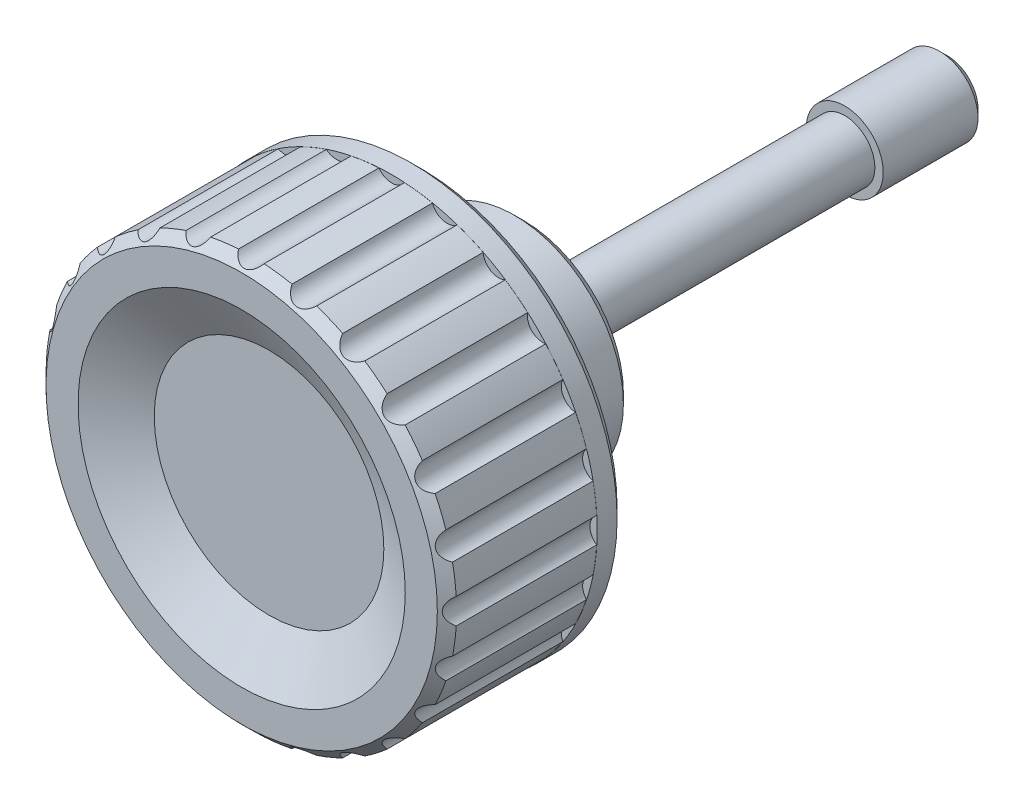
ISO-10303-21;
HEADER;
FILE_DESCRIPTION(('STEP AP214'),'2;1');
FILE_NAME('part.step','',(''),(''),'','','');
FILE_SCHEMA(('AUTOMOTIVE_DESIGN { 1 0 10303 214 1 1 1 1 }'));
ENDSEC;
DATA;
#1=APPLICATION_CONTEXT('core data for automotive mechanical design processes');
#2=APPLICATION_PROTOCOL_DEFINITION('international standard','automotive_design',2000,#1);
#3=PRODUCT_CONTEXT('',#1,'mechanical');
#4=PRODUCT('Part','Part','',(#3));
#5=PRODUCT_RELATED_PRODUCT_CATEGORY('part','',(#4));
#6=PRODUCT_DEFINITION_FORMATION('','',#4);
#7=PRODUCT_DEFINITION_CONTEXT('part definition',#1,'design');
#8=PRODUCT_DEFINITION('design','',#6,#7);
#9=PRODUCT_DEFINITION_SHAPE('','',#8);
#10=(LENGTH_UNIT() NAMED_UNIT(*) SI_UNIT(.MILLI.,.METRE.));
#11=(NAMED_UNIT(*) PLANE_ANGLE_UNIT() SI_UNIT($,.RADIAN.));
#12=(NAMED_UNIT(*) SI_UNIT($,.STERADIAN.) SOLID_ANGLE_UNIT());
#13=UNCERTAINTY_MEASURE_WITH_UNIT(LENGTH_MEASURE(1.E-05),#10,'distance_accuracy_value','');
#14=(GEOMETRIC_REPRESENTATION_CONTEXT(3) GLOBAL_UNCERTAINTY_ASSIGNED_CONTEXT((#13)) GLOBAL_UNIT_ASSIGNED_CONTEXT((#10,
#11,#12)) REPRESENTATION_CONTEXT('',''));
#15=CARTESIAN_POINT('',(0.,0.,0.));
#16=DIRECTION('',(0.,0.,1.));
#17=DIRECTION('',(1.,0.,0.));
#18=AXIS2_PLACEMENT_3D('',#15,#16,#17);
#19=CARTESIAN_POINT('',(0.,0.,0.));
#20=DIRECTION('',(0.,0.,1.));
#21=DIRECTION('',(1.,0.,0.));
#22=AXIS2_PLACEMENT_3D('',#19,#20,#21);
#23=PLANE('',#22);
#24=CARTESIAN_POINT('',(0.,0.,0.));
#25=DIRECTION('',(0.,0.,1.));
#26=DIRECTION('',(1.,0.,0.));
#27=AXIS2_PLACEMENT_3D('',#24,#25,#26);
#28=CIRCLE('',#27,4.);
#29=CARTESIAN_POINT('',(4.,0.,0.));
#30=VERTEX_POINT('',#29);
#31=EDGE_CURVE('E491',#30,#30,#28,.T.);
#32=ORIENTED_EDGE('',*,*,#31,.F.);
#33=EDGE_LOOP('',(#32));
#34=FACE_BOUND('',#33,.T.);
#35=CARTESIAN_POINT('',(0.,0.,0.));
#36=DIRECTION('',(0.,0.,1.));
#37=DIRECTION('',(1.,0.,0.));
#38=AXIS2_PLACEMENT_3D('',#35,#36,#37);
#39=CIRCLE('',#38,2.35);
#40=CARTESIAN_POINT('',(2.35,0.,0.));
#41=VERTEX_POINT('',#40);
#42=EDGE_CURVE('E544',#41,#41,#39,.T.);
#43=ORIENTED_EDGE('',*,*,#42,.T.);
#44=EDGE_LOOP('',(#43));
#45=FACE_BOUND('',#44,.T.);
#46=ADVANCED_FACE('F15',(#34,#45),#23,.F.);
#47=CARTESIAN_POINT('',(0.,0.,23.75));
#48=DIRECTION('',(0.,0.,1.));
#49=DIRECTION('',(1.,0.,0.));
#50=AXIS2_PLACEMENT_3D('',#47,#48,#49);
#51=CYLINDRICAL_SURFACE('',#50,4.);
#52=CARTESIAN_POINT('',(0.,0.,1.));
#53=DIRECTION('',(0.,0.,1.));
#54=DIRECTION('',(1.,0.,0.));
#55=AXIS2_PLACEMENT_3D('',#52,#53,#54);
#56=CIRCLE('',#55,4.);
#57=CARTESIAN_POINT('',(4.,0.,1.00000000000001));
#58=VERTEX_POINT('',#57);
#59=EDGE_CURVE('E488',#58,#58,#56,.T.);
#60=ORIENTED_EDGE('',*,*,#59,.F.);
#61=EDGE_LOOP('',(#60));
#62=FACE_BOUND('',#61,.T.);
#63=ORIENTED_EDGE('',*,*,#31,.T.);
#64=EDGE_LOOP('',(#63));
#65=FACE_BOUND('',#64,.T.);
#66=ADVANCED_FACE('F532',(#62,#65),#51,.T.);
#67=CARTESIAN_POINT('',(0.,4.,1.));
#68=DIRECTION('',(0.,0.,1.));
#69=DIRECTION('',(1.,0.,0.));
#70=AXIS2_PLACEMENT_3D('',#67,#68,#69);
#71=PLANE('',#70);
#72=CARTESIAN_POINT('',(0.,0.,1.));
#73=DIRECTION('',(0.,0.,1.));
#74=DIRECTION('',(1.,0.,0.));
#75=AXIS2_PLACEMENT_3D('',#72,#73,#74);
#76=CIRCLE('',#75,7.75);
#77=CARTESIAN_POINT('',(7.75,0.,1.00000000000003));
#78=VERTEX_POINT('',#77);
#79=EDGE_CURVE('E485',#78,#78,#76,.T.);
#80=ORIENTED_EDGE('',*,*,#79,.F.);
#81=EDGE_LOOP('',(#80));
#82=FACE_BOUND('',#81,.T.);
#83=ORIENTED_EDGE('',*,*,#59,.T.);
#84=EDGE_LOOP('',(#83));
#85=FACE_BOUND('',#84,.T.);
#86=ADVANCED_FACE('F538',(#82,#85),#71,.F.);
#87=CARTESIAN_POINT('',(0.,0.,1.));
#88=DIRECTION('',(0.,0.,1.));
#89=DIRECTION('',(1.,0.,0.));
#90=AXIS2_PLACEMENT_3D('',#87,#88,#89);
#91=CONICAL_SURFACE('',#90,7.75,0.785398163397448);
#92=CARTESIAN_POINT('',(0.,0.,1.75));
#93=DIRECTION('',(0.,0.,1.));
#94=DIRECTION('',(1.,0.,0.));
#95=AXIS2_PLACEMENT_3D('',#92,#93,#94);
#96=CIRCLE('',#95,8.5);
#97=CARTESIAN_POINT('',(8.49999999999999,0.,1.75000000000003));
#98=VERTEX_POINT('',#97);
#99=EDGE_CURVE('E482',#98,#98,#96,.T.);
#100=ORIENTED_EDGE('',*,*,#99,.F.);
#101=EDGE_LOOP('',(#100));
#102=FACE_BOUND('',#101,.T.);
#103=ORIENTED_EDGE('',*,*,#79,.T.);
#104=EDGE_LOOP('',(#103));
#105=FACE_BOUND('',#104,.T.);
#106=ADVANCED_FACE('F1576',(#102,#105),#91,.T.);
#107=CARTESIAN_POINT('',(0.,0.,23.75));
#108=DIRECTION('',(0.,0.,1.));
#109=DIRECTION('',(1.,0.,0.));
#110=AXIS2_PLACEMENT_3D('',#107,#108,#109);
#111=CYLINDRICAL_SURFACE('',#110,8.5);
#112=CARTESIAN_POINT('',(0.,0.,9.));
#113=DIRECTION('',(0.,0.,1.));
#114=DIRECTION('',(1.,0.,0.));
#115=AXIS2_PLACEMENT_3D('',#112,#113,#114);
#116=CIRCLE('',#115,8.5);
#117=CARTESIAN_POINT('',(8.49999999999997,0.,9.00000000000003));
#118=VERTEX_POINT('',#117);
#119=EDGE_CURVE('E479',#118,#118,#116,.T.);
#120=ORIENTED_EDGE('',*,*,#119,.F.);
#121=EDGE_LOOP('',(#120));
#122=FACE_BOUND('',#121,.T.);
#123=ORIENTED_EDGE('',*,*,#99,.T.);
#124=EDGE_LOOP('',(#123));
#125=FACE_BOUND('',#124,.T.);
#126=ADVANCED_FACE('F1566',(#122,#125),#111,.T.);
#127=CARTESIAN_POINT('',(0.,8.5,9.));
#128=DIRECTION('',(0.,0.,1.));
#129=DIRECTION('',(1.,0.,0.));
#130=AXIS2_PLACEMENT_3D('',#127,#128,#129);
#131=PLANE('',#130);
#132=CARTESIAN_POINT('',(0.,0.,9.));
#133=DIRECTION('',(0.,0.,1.));
#134=DIRECTION('',(1.,0.,0.));
#135=AXIS2_PLACEMENT_3D('',#132,#133,#134);
#136=CIRCLE('',#135,8.94736842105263);
#137=CARTESIAN_POINT('',(8.9473684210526,0.,9.00000000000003));
#138=VERTEX_POINT('',#137);
#139=EDGE_CURVE('E476',#138,#138,#136,.T.);
#140=ORIENTED_EDGE('',*,*,#139,.F.);
#141=EDGE_LOOP('',(#140));
#142=FACE_BOUND('',#141,.T.);
#143=ORIENTED_EDGE('',*,*,#119,.T.);
#144=EDGE_LOOP('',(#143));
#145=FACE_BOUND('',#144,.T.);
#146=ADVANCED_FACE('F1556',(#142,#145),#131,.F.);
#147=CARTESIAN_POINT('',(0.,0.,23.75));
#148=DIRECTION('',(0.,0.,1.));
#149=DIRECTION('',(1.,0.,0.));
#150=AXIS2_PLACEMENT_3D('',#147,#148,#149);
#151=CYLINDRICAL_SURFACE('',#150,8.94736842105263);
#152=CARTESIAN_POINT('',(0.,0.,16.));
#153=DIRECTION('',(0.,0.,1.));
#154=DIRECTION('',(1.,0.,0.));
#155=AXIS2_PLACEMENT_3D('',#152,#153,#154);
#156=CIRCLE('',#155,8.94736842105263);
#157=CARTESIAN_POINT('',(8.94736842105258,0.,16.));
#158=VERTEX_POINT('',#157);
#159=EDGE_CURVE('E473',#158,#158,#156,.T.);
#160=ORIENTED_EDGE('',*,*,#159,.F.);
#161=EDGE_LOOP('',(#160));
#162=FACE_BOUND('',#161,.T.);
#163=ORIENTED_EDGE('',*,*,#139,.T.);
#164=EDGE_LOOP('',(#163));
#165=FACE_BOUND('',#164,.T.);
#166=ADVANCED_FACE('F1546',(#162,#165),#151,.T.);
#167=CARTESIAN_POINT('',(0.,8.94736842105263,16.));
#168=DIRECTION('',(0.,0.,1.));
#169=DIRECTION('',(1.,0.,0.));
#170=AXIS2_PLACEMENT_3D('',#167,#168,#169);
#171=PLANE('',#170);
#172=CARTESIAN_POINT('',(0.,0.,16.));
#173=DIRECTION('',(0.,0.,1.));
#174=DIRECTION('',(1.,0.,0.));
#175=AXIS2_PLACEMENT_3D('',#172,#173,#174);
#176=CIRCLE('',#175,13.9130434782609);
#177=CARTESIAN_POINT('',(13.9130434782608,0.,16.));
#178=VERTEX_POINT('',#177);
#179=EDGE_CURVE('E470',#178,#178,#176,.T.);
#180=ORIENTED_EDGE('',*,*,#179,.F.);
#181=EDGE_LOOP('',(#180));
#182=FACE_BOUND('',#181,.T.);
#183=ORIENTED_EDGE('',*,*,#159,.T.);
#184=EDGE_LOOP('',(#183));
#185=FACE_BOUND('',#184,.T.);
#186=ADVANCED_FACE('F1537',(#182,#185),#171,.F.);
#187=CARTESIAN_POINT('',(0.,0.,23.75));
#188=DIRECTION('',(0.,0.,1.));
#189=DIRECTION('',(1.,0.,0.));
#190=AXIS2_PLACEMENT_3D('',#187,#188,#189);
#191=CYLINDRICAL_SURFACE('',#190,13.9130434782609);
#192=CARTESIAN_POINT('',(0.,0.,9.));
#193=DIRECTION('',(0.,0.,1.));
#194=DIRECTION('',(1.,0.,0.));
#195=AXIS2_PLACEMENT_3D('',#192,#193,#194);
#196=CIRCLE('',#195,13.9130434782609);
#197=CARTESIAN_POINT('',(13.9130434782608,0.,9.00000000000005));
#198=VERTEX_POINT('',#197);
#199=EDGE_CURVE('E340',#198,#198,#196,.T.);
#200=ORIENTED_EDGE('',*,*,#199,.F.);
#201=EDGE_LOOP('',(#200));
#202=FACE_BOUND('',#201,.T.);
#203=ORIENTED_EDGE('',*,*,#179,.T.);
#204=EDGE_LOOP('',(#203));
#205=FACE_BOUND('',#204,.T.);
#206=ADVANCED_FACE('F1111',(#202,#205),#191,.F.);
#207=CARTESIAN_POINT('',(0.,13.9130434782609,11.3));
#208=DIRECTION('',(0.,0.,1.));
#209=DIRECTION('',(1.,0.,0.));
#210=AXIS2_PLACEMENT_3D('',#207,#208,#209);
#211=PLANE('',#210);
#212=CARTESIAN_POINT('',(0.,0.,11.3));
#213=DIRECTION('',(0.,0.,1.));
#214=DIRECTION('',(1.,0.,0.));
#215=AXIS2_PLACEMENT_3D('',#212,#213,#214);
#216=CIRCLE('',#215,16.01);
#217=CARTESIAN_POINT('',(16.01,0.,11.3000000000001));
#218=VERTEX_POINT('',#217);
#219=EDGE_CURVE('E566',#218,#218,#216,.T.);
#220=ORIENTED_EDGE('',*,*,#219,.T.);
#221=EDGE_LOOP('',(#220));
#222=FACE_BOUND('',#221,.T.);
#223=CARTESIAN_POINT('',(-16.0730057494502,4.30674891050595,11.3));
#224=DIRECTION('',(0.,0.,1.));
#225=DIRECTION('',(1.,0.,0.));
#226=AXIS2_PLACEMENT_3D('',#223,#224,#225);
#227=CIRCLE('',#226,1.2);
#228=CARTESIAN_POINT('',(-15.6824037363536,3.17209915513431,11.3));
#229=VERTEX_POINT('',#228);
#230=CARTESIAN_POINT('',(-15.1674096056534,5.09408341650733,11.3));
#231=VERTEX_POINT('',#230);
#232=EDGE_CURVE('E334',#229,#231,#227,.T.);
#233=ORIENTED_EDGE('',*,*,#232,.T.);
#234=CARTESIAN_POINT('',(3.33511808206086E-13,-1.66533453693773E-13,11.3));
#235=DIRECTION('',(0.,0.,1.));
#236=DIRECTION('',(1.,0.,0.));
#237=AXIS2_PLACEMENT_3D('',#234,#235,#236);
#238=CIRCLE('',#237,16.0000000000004);
#239=CARTESIAN_POINT('',(-14.3270391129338,7.1229172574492,11.3));
#240=VERTEX_POINT('',#239);
#241=EDGE_CURVE('E459',#240,#231,#238,.T.);
#242=ORIENTED_EDGE('',*,*,#241,.F.);
#243=CARTESIAN_POINT('',(-14.4106627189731,8.32,11.3));
#244=DIRECTION('',(0.,0.,1.));
#245=DIRECTION('',(1.,0.,0.));
#246=AXIS2_PLACEMENT_3D('',#243,#244,#245);
#247=CIRCLE('',#246,1.2);
#248=CARTESIAN_POINT('',(-13.3321468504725,8.84612120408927,11.3));
#249=VERTEX_POINT('',#248);
#250=EDGE_CURVE('E456',#240,#249,#247,.T.);
#251=ORIENTED_EDGE('',*,*,#250,.T.);
#252=CARTESIAN_POINT('',(3.92492406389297E-13,-3.05311331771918E-13,11.3));
#253=DIRECTION('',(0.,0.,1.));
#254=DIRECTION('',(1.,0.,0.));
#255=AXIS2_PLACEMENT_3D('',#252,#253,#254);
#256=CIRCLE('',#255,16.0000000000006);
#257=CARTESIAN_POINT('',(-11.9953104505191,10.5883203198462,11.3));
#258=VERTEX_POINT('',#257);
#259=EDGE_CURVE('E454',#258,#249,#256,.T.);
#260=ORIENTED_EDGE('',*,*,#259,.F.);
#261=CARTESIAN_POINT('',(-11.7662568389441,11.7662568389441,11.3));
#262=DIRECTION('',(0.,0.,1.));
#263=DIRECTION('',(1.,0.,0.));
#264=AXIS2_PLACEMENT_3D('',#261,#262,#263);
#265=CIRCLE('',#264,1.2);
#266=CARTESIAN_POINT('',(-10.5883203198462,11.9953104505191,11.3));
#267=VERTEX_POINT('',#266);
#268=EDGE_CURVE('E451',#258,#267,#265,.T.);
#269=ORIENTED_EDGE('',*,*,#268,.T.);
#270=CARTESIAN_POINT('',(0.,-1.43982048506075E-13,11.3));
#271=DIRECTION('',(0.,0.,1.));
#272=DIRECTION('',(1.,0.,0.));
#273=AXIS2_PLACEMENT_3D('',#270,#271,#272);
#274=CIRCLE('',#273,16.);
#275=CARTESIAN_POINT('',(-8.84612120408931,13.3321468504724,11.3));
#276=VERTEX_POINT('',#275);
#277=EDGE_CURVE('E449',#276,#267,#274,.T.);
#278=ORIENTED_EDGE('',*,*,#277,.F.);
#279=CARTESIAN_POINT('',(-8.32,14.410662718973,11.3));
#280=DIRECTION('',(0.,0.,1.));
#281=DIRECTION('',(1.,0.,0.));
#282=AXIS2_PLACEMENT_3D('',#279,#280,#281);
#283=CIRCLE('',#282,1.2);
#284=CARTESIAN_POINT('',(-7.12291725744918,14.3270391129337,11.3));
#285=VERTEX_POINT('',#284);
#286=EDGE_CURVE('E446',#276,#285,#283,.T.);
#287=ORIENTED_EDGE('',*,*,#286,.T.);
#288=CARTESIAN_POINT('',(2.45040910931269E-13,-7.68482499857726E-13,11.3));
#289=DIRECTION('',(0.,0.,1.));
#290=DIRECTION('',(1.,0.,0.));
#291=AXIS2_PLACEMENT_3D('',#288,#289,#290);
#292=CIRCLE('',#291,16.0000000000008);
#293=CARTESIAN_POINT('',(-5.09408341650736,15.1674096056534,11.3));
#294=VERTEX_POINT('',#293);
#295=EDGE_CURVE('E444',#294,#285,#292,.T.);
#296=ORIENTED_EDGE('',*,*,#295,.F.);
#297=CARTESIAN_POINT('',(-4.30674891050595,16.07300574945,11.3));
#298=DIRECTION('',(0.,0.,1.));
#299=DIRECTION('',(1.,0.,0.));
#300=AXIS2_PLACEMENT_3D('',#297,#298,#299);
#301=CIRCLE('',#300,1.2);
#302=CARTESIAN_POINT('',(-3.17209915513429,15.6824037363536,11.3));
#303=VERTEX_POINT('',#302);
#304=EDGE_CURVE('E441',#294,#303,#301,.T.);
#305=ORIENTED_EDGE('',*,*,#304,.T.);
#306=CARTESIAN_POINT('',(0.,-7.07767178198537E-13,11.3));
#307=DIRECTION('',(0.,0.,1.));
#308=DIRECTION('',(1.,0.,0.));
#309=AXIS2_PLACEMENT_3D('',#306,#307,#308);
#310=CIRCLE('',#309,16.0000000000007);
#311=CARTESIAN_POINT('',(-0.994892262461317,15.9690384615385,11.3));
#312=VERTEX_POINT('',#311);
#313=EDGE_CURVE('E439',#312,#303,#310,.T.);
#314=ORIENTED_EDGE('',*,*,#313,.F.);
#315=CARTESIAN_POINT('',(0.,16.64,11.3));
#316=DIRECTION('',(0.,0.,1.));
#317=DIRECTION('',(1.,0.,0.));
#318=AXIS2_PLACEMENT_3D('',#315,#316,#317);
#319=CIRCLE('',#318,1.2);
#320=CARTESIAN_POINT('',(0.994892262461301,15.9690384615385,11.3));
#321=VERTEX_POINT('',#320);
#322=EDGE_CURVE('E437',#312,#321,#319,.T.);
#323=ORIENTED_EDGE('',*,*,#322,.T.);
#324=CARTESIAN_POINT('',(-1.15347891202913E-13,-5.62050406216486E-13,11.3));
#325=DIRECTION('',(0.,0.,1.));
#326=DIRECTION('',(1.,0.,0.));
#327=AXIS2_PLACEMENT_3D('',#324,#325,#326);
#328=CIRCLE('',#327,16.0000000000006);
#329=CARTESIAN_POINT('',(3.17209915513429,15.6824037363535,11.3));
#330=VERTEX_POINT('',#329);
#331=EDGE_CURVE('E434',#330,#321,#328,.T.);
#332=ORIENTED_EDGE('',*,*,#331,.F.);
#333=CARTESIAN_POINT('',(4.30674891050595,16.07300574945,11.3));
#334=DIRECTION('',(0.,0.,1.));
#335=DIRECTION('',(1.,0.,0.));
#336=AXIS2_PLACEMENT_3D('',#333,#334,#335);
#337=CIRCLE('',#336,1.2);
#338=CARTESIAN_POINT('',(5.09408341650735,15.1674096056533,11.3));
#339=VERTEX_POINT('',#338);
#340=EDGE_CURVE('E431',#330,#339,#337,.T.);
#341=ORIENTED_EDGE('',*,*,#340,.T.);
#342=CARTESIAN_POINT('',(0.,1.02348685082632E-13,11.3));
#343=DIRECTION('',(0.,0.,1.));
#344=DIRECTION('',(1.,0.,0.));
#345=AXIS2_PLACEMENT_3D('',#342,#343,#344);
#346=CIRCLE('',#345,16.);
#347=CARTESIAN_POINT('',(7.12291725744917,14.3270391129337,11.3));
#348=VERTEX_POINT('',#347);
#349=EDGE_CURVE('E429',#348,#339,#346,.T.);
#350=ORIENTED_EDGE('',*,*,#349,.F.);
#351=CARTESIAN_POINT('',(8.32,14.410662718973,11.3));
#352=DIRECTION('',(0.,0.,1.));
#353=DIRECTION('',(1.,0.,0.));
#354=AXIS2_PLACEMENT_3D('',#351,#352,#353);
#355=CIRCLE('',#354,1.2);
#356=CARTESIAN_POINT('',(8.84612120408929,13.3321468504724,11.3));
#357=VERTEX_POINT('',#356);
#358=EDGE_CURVE('E426',#348,#357,#355,.T.);
#359=ORIENTED_EDGE('',*,*,#358,.T.);
#360=CARTESIAN_POINT('',(1.72182524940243E-13,2.77555756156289E-13,11.3));
#361=DIRECTION('',(0.,0.,1.));
#362=DIRECTION('',(1.,0.,0.));
#363=AXIS2_PLACEMENT_3D('',#360,#361,#362);
#364=CIRCLE('',#363,15.9999999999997);
#365=CARTESIAN_POINT('',(10.5883203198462,11.995310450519,11.3));
#366=VERTEX_POINT('',#365);
#367=EDGE_CURVE('E424',#366,#357,#364,.T.);
#368=ORIENTED_EDGE('',*,*,#367,.F.);
#369=CARTESIAN_POINT('',(11.7662568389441,11.7662568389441,11.3));
#370=DIRECTION('',(0.,0.,1.));
#371=DIRECTION('',(1.,0.,0.));
#372=AXIS2_PLACEMENT_3D('',#369,#370,#371);
#373=CIRCLE('',#372,1.2);
#374=CARTESIAN_POINT('',(11.995310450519,10.5883203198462,11.3));
#375=VERTEX_POINT('',#374);
#376=EDGE_CURVE('E421',#366,#375,#373,.T.);
#377=ORIENTED_EDGE('',*,*,#376,.T.);
#378=CARTESIAN_POINT('',(-2.21599704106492E-13,-1.37043154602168E-13,11.3));
#379=DIRECTION('',(0.,0.,1.));
#380=DIRECTION('',(1.,0.,0.));
#381=AXIS2_PLACEMENT_3D('',#378,#379,#380);
#382=CIRCLE('',#381,16.0000000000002);
#383=CARTESIAN_POINT('',(13.3321468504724,8.84612120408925,11.3));
#384=VERTEX_POINT('',#383);
#385=EDGE_CURVE('E419',#384,#375,#382,.T.);
#386=ORIENTED_EDGE('',*,*,#385,.F.);
#387=CARTESIAN_POINT('',(14.410662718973,8.32,11.3));
#388=DIRECTION('',(0.,0.,1.));
#389=DIRECTION('',(1.,0.,0.));
#390=AXIS2_PLACEMENT_3D('',#387,#388,#389);
#391=CIRCLE('',#390,1.2);
#392=CARTESIAN_POINT('',(14.3270391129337,7.12291725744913,11.3));
#393=VERTEX_POINT('',#392);
#394=EDGE_CURVE('E416',#384,#393,#391,.T.);
#395=ORIENTED_EDGE('',*,*,#394,.T.);
#396=CARTESIAN_POINT('',(-4.38440138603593E-13,-1.52655665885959E-13,11.3));
#397=DIRECTION('',(0.,0.,1.));
#398=DIRECTION('',(1.,0.,0.));
#399=AXIS2_PLACEMENT_3D('',#396,#397,#398);
#400=CIRCLE('',#399,16.0000000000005);
#401=CARTESIAN_POINT('',(15.1674096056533,5.0940834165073,11.3));
#402=VERTEX_POINT('',#401);
#403=EDGE_CURVE('E414',#402,#393,#400,.T.);
#404=ORIENTED_EDGE('',*,*,#403,.F.);
#405=CARTESIAN_POINT('',(16.07300574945,4.30674891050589,11.3));
#406=DIRECTION('',(0.,0.,1.));
#407=DIRECTION('',(1.,0.,0.));
#408=AXIS2_PLACEMENT_3D('',#405,#406,#407);
#409=CIRCLE('',#408,1.2);
#410=CARTESIAN_POINT('',(15.6824037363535,3.17209915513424,11.3));
#411=VERTEX_POINT('',#410);
#412=EDGE_CURVE('E411',#402,#411,#409,.T.);
#413=ORIENTED_EDGE('',*,*,#412,.T.);
#414=CARTESIAN_POINT('',(0.,0.,11.3));
#415=DIRECTION('',(0.,0.,1.));
#416=DIRECTION('',(1.,0.,0.));
#417=AXIS2_PLACEMENT_3D('',#414,#415,#416);
#418=CIRCLE('',#417,16.);
#419=CARTESIAN_POINT('',(15.9690384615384,0.994892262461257,11.3));
#420=VERTEX_POINT('',#419);
#421=EDGE_CURVE('E409',#420,#411,#418,.T.);
#422=ORIENTED_EDGE('',*,*,#421,.F.);
#423=CARTESIAN_POINT('',(16.64,0.,11.3));
#424=DIRECTION('',(0.,0.,1.));
#425=DIRECTION('',(1.,0.,0.));
#426=AXIS2_PLACEMENT_3D('',#423,#424,#425);
#427=CIRCLE('',#426,1.2);
#428=CARTESIAN_POINT('',(15.9690384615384,-0.994892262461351,11.3));
#429=VERTEX_POINT('',#428);
#430=EDGE_CURVE('E406',#420,#429,#427,.T.);
#431=ORIENTED_EDGE('',*,*,#430,.T.);
#432=CARTESIAN_POINT('',(-5.94565251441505E-13,0.,11.3));
#433=DIRECTION('',(0.,0.,1.));
#434=DIRECTION('',(1.,0.,0.));
#435=AXIS2_PLACEMENT_3D('',#432,#433,#434);
#436=CIRCLE('',#435,16.0000000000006);
#437=CARTESIAN_POINT('',(15.6824037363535,-3.17209915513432,11.3));
#438=VERTEX_POINT('',#437);
#439=EDGE_CURVE('E404',#438,#429,#436,.T.);
#440=ORIENTED_EDGE('',*,*,#439,.F.);
#441=CARTESIAN_POINT('',(16.07300574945,-4.30674891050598,11.3));
#442=DIRECTION('',(0.,0.,1.));
#443=DIRECTION('',(1.,0.,0.));
#444=AXIS2_PLACEMENT_3D('',#441,#442,#443);
#445=CIRCLE('',#444,1.2);
#446=CARTESIAN_POINT('',(15.1674096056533,-5.09408341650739,11.3));
#447=VERTEX_POINT('',#446);
#448=EDGE_CURVE('E401',#438,#447,#445,.T.);
#449=ORIENTED_EDGE('',*,*,#448,.T.);
#450=CARTESIAN_POINT('',(-1.50476041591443E-13,0.,11.3));
#451=DIRECTION('',(0.,0.,1.));
#452=DIRECTION('',(1.,0.,0.));
#453=AXIS2_PLACEMENT_3D('',#450,#451,#452);
#454=CIRCLE('',#453,16.);
#455=CARTESIAN_POINT('',(14.3270391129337,-7.12291725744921,11.3));
#456=VERTEX_POINT('',#455);
#457=EDGE_CURVE('E399',#456,#447,#454,.T.);
#458=ORIENTED_EDGE('',*,*,#457,.F.);
#459=CARTESIAN_POINT('',(14.410662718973,-8.32,11.3));
#460=DIRECTION('',(0.,0.,1.));
#461=DIRECTION('',(1.,0.,0.));
#462=AXIS2_PLACEMENT_3D('',#459,#460,#461);
#463=CIRCLE('',#462,1.2);
#464=CARTESIAN_POINT('',(13.3321468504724,-8.84612120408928,11.3));
#465=VERTEX_POINT('',#464);
#466=EDGE_CURVE('E396',#456,#465,#463,.T.);
#467=ORIENTED_EDGE('',*,*,#466,.T.);
#468=CARTESIAN_POINT('',(1.02793585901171E-13,-1.196959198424E-13,11.3));
#469=DIRECTION('',(0.,0.,1.));
#470=DIRECTION('',(1.,0.,0.));
#471=AXIS2_PLACEMENT_3D('',#468,#469,#470);
#472=CIRCLE('',#471,16.);
#473=CARTESIAN_POINT('',(11.995310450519,-10.5883203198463,11.3));
#474=VERTEX_POINT('',#473);
#475=EDGE_CURVE('E394',#474,#465,#472,.T.);
#476=ORIENTED_EDGE('',*,*,#475,.F.);
#477=CARTESIAN_POINT('',(11.7662568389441,-11.7662568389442,11.3));
#478=DIRECTION('',(0.,0.,1.));
#479=DIRECTION('',(1.,0.,0.));
#480=AXIS2_PLACEMENT_3D('',#477,#478,#479);
#481=CIRCLE('',#480,1.2);
#482=CARTESIAN_POINT('',(10.5883203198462,-11.995310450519,11.3));
#483=VERTEX_POINT('',#482);
#484=EDGE_CURVE('E391',#474,#483,#481,.T.);
#485=ORIENTED_EDGE('',*,*,#484,.T.);
#486=CARTESIAN_POINT('',(-9.18958541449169E-13,1.14491749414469E-12,11.3));
#487=DIRECTION('',(0.,0.,1.));
#488=DIRECTION('',(1.,0.,0.));
#489=AXIS2_PLACEMENT_3D('',#486,#487,#488);
#490=CIRCLE('',#489,16.0000000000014);
#491=CARTESIAN_POINT('',(8.84612120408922,-13.3321468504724,11.3));
#492=VERTEX_POINT('',#491);
#493=EDGE_CURVE('E389',#492,#483,#490,.T.);
#494=ORIENTED_EDGE('',*,*,#493,.F.);
#495=CARTESIAN_POINT('',(8.32,-14.4106627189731,11.3));
#496=DIRECTION('',(0.,0.,1.));
#497=DIRECTION('',(1.,0.,0.));
#498=AXIS2_PLACEMENT_3D('',#495,#496,#497);
#499=CIRCLE('',#498,1.2);
#500=CARTESIAN_POINT('',(7.12291725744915,-14.3270391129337,11.3));
#501=VERTEX_POINT('',#500);
#502=EDGE_CURVE('E386',#492,#501,#499,.T.);
#503=ORIENTED_EDGE('',*,*,#502,.T.);
#504=CARTESIAN_POINT('',(0.,0.,11.3));
#505=DIRECTION('',(0.,0.,1.));
#506=DIRECTION('',(1.,0.,0.));
#507=AXIS2_PLACEMENT_3D('',#504,#505,#506);
#508=CIRCLE('',#507,16.);
#509=CARTESIAN_POINT('',(5.09408341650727,-15.1674096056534,11.3));
#510=VERTEX_POINT('',#509);
#511=EDGE_CURVE('E384',#510,#501,#508,.T.);
#512=ORIENTED_EDGE('',*,*,#511,.F.);
#513=CARTESIAN_POINT('',(4.30674891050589,-16.0730057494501,11.3));
#514=DIRECTION('',(0.,0.,1.));
#515=DIRECTION('',(1.,0.,0.));
#516=AXIS2_PLACEMENT_3D('',#513,#514,#515);
#517=CIRCLE('',#516,1.2);
#518=CARTESIAN_POINT('',(3.17209915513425,-15.6824037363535,11.3));
#519=VERTEX_POINT('',#518);
#520=EDGE_CURVE('E381',#510,#519,#517,.T.);
#521=ORIENTED_EDGE('',*,*,#520,.T.);
#522=CARTESIAN_POINT('',(0.,0.,11.3));
#523=DIRECTION('',(0.,0.,1.));
#524=DIRECTION('',(1.,0.,0.));
#525=AXIS2_PLACEMENT_3D('',#522,#523,#524);
#526=CIRCLE('',#525,16.);
#527=CARTESIAN_POINT('',(0.994892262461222,-15.9690384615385,11.3));
#528=VERTEX_POINT('',#527);
#529=EDGE_CURVE('E379',#528,#519,#526,.T.);
#530=ORIENTED_EDGE('',*,*,#529,.F.);
#531=CARTESIAN_POINT('',(0.,-16.64,11.3));
#532=DIRECTION('',(0.,0.,1.));
#533=DIRECTION('',(1.,0.,0.));
#534=AXIS2_PLACEMENT_3D('',#531,#532,#533);
#535=CIRCLE('',#534,1.2);
#536=CARTESIAN_POINT('',(-0.994892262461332,-15.9690384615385,11.3));
#537=VERTEX_POINT('',#536);
#538=EDGE_CURVE('E376',#528,#537,#535,.T.);
#539=ORIENTED_EDGE('',*,*,#538,.T.);
#540=CARTESIAN_POINT('',(0.,4.85722573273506E-13,11.3));
#541=DIRECTION('',(0.,0.,1.));
#542=DIRECTION('',(1.,0.,0.));
#543=AXIS2_PLACEMENT_3D('',#540,#541,#542);
#544=CIRCLE('',#543,16.0000000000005);
#545=CARTESIAN_POINT('',(-3.17209915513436,-15.6824037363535,11.3));
#546=VERTEX_POINT('',#545);
#547=EDGE_CURVE('E374',#546,#537,#544,.T.);
#548=ORIENTED_EDGE('',*,*,#547,.F.);
#549=CARTESIAN_POINT('',(-4.306748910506,-16.0730057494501,11.3));
#550=DIRECTION('',(0.,0.,1.));
#551=DIRECTION('',(1.,0.,0.));
#552=AXIS2_PLACEMENT_3D('',#549,#550,#551);
#553=CIRCLE('',#552,1.2);
#554=CARTESIAN_POINT('',(-5.09408341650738,-15.1674096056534,11.3));
#555=VERTEX_POINT('',#554);
#556=EDGE_CURVE('E371',#546,#555,#553,.T.);
#557=ORIENTED_EDGE('',*,*,#556,.T.);
#558=CARTESIAN_POINT('',(3.57797936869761E-13,9.76649316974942E-13,11.3));
#559=DIRECTION('',(0.,0.,1.));
#560=DIRECTION('',(1.,0.,0.));
#561=AXIS2_PLACEMENT_3D('',#558,#559,#560);
#562=CIRCLE('',#561,16.0000000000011);
#563=CARTESIAN_POINT('',(-7.12291725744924,-14.3270391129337,11.3));
#564=VERTEX_POINT('',#563);
#565=EDGE_CURVE('E369',#564,#555,#562,.T.);
#566=ORIENTED_EDGE('',*,*,#565,.F.);
#567=CARTESIAN_POINT('',(-8.32,-14.4106627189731,11.3));
#568=DIRECTION('',(0.,0.,1.));
#569=DIRECTION('',(1.,0.,0.));
#570=AXIS2_PLACEMENT_3D('',#567,#568,#569);
#571=CIRCLE('',#570,1.2);
#572=CARTESIAN_POINT('',(-8.84612120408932,-13.3321468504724,11.3));
#573=VERTEX_POINT('',#572);
#574=EDGE_CURVE('E366',#564,#573,#571,.T.);
#575=ORIENTED_EDGE('',*,*,#574,.T.);
#576=CARTESIAN_POINT('',(2.58918698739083E-13,4.14598910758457E-13,11.3));
#577=DIRECTION('',(0.,0.,1.));
#578=DIRECTION('',(1.,0.,0.));
#579=AXIS2_PLACEMENT_3D('',#576,#577,#578);
#580=CIRCLE('',#579,16.0000000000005);
#581=CARTESIAN_POINT('',(-10.5883203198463,-11.995310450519,11.3));
#582=VERTEX_POINT('',#581);
#583=EDGE_CURVE('E364',#582,#573,#580,.T.);
#584=ORIENTED_EDGE('',*,*,#583,.F.);
#585=CARTESIAN_POINT('',(-11.7662568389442,-11.7662568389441,11.3));
#586=DIRECTION('',(0.,0.,1.));
#587=DIRECTION('',(1.,0.,0.));
#588=AXIS2_PLACEMENT_3D('',#585,#586,#587);
#589=CIRCLE('',#588,1.2);
#590=CARTESIAN_POINT('',(-11.9953104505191,-10.5883203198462,11.3));
#591=VERTEX_POINT('',#590);
#592=EDGE_CURVE('E361',#582,#591,#589,.T.);
#593=ORIENTED_EDGE('',*,*,#592,.T.);
#594=CARTESIAN_POINT('',(0.,0.,11.3));
#595=DIRECTION('',(0.,0.,1.));
#596=DIRECTION('',(1.,0.,0.));
#597=AXIS2_PLACEMENT_3D('',#594,#595,#596);
#598=CIRCLE('',#597,16.);
#599=CARTESIAN_POINT('',(-13.3321468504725,-8.84612120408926,11.3));
#600=VERTEX_POINT('',#599);
#601=EDGE_CURVE('E359',#600,#591,#598,.T.);
#602=ORIENTED_EDGE('',*,*,#601,.F.);
#603=CARTESIAN_POINT('',(-14.4106627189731,-8.32,11.3));
#604=DIRECTION('',(0.,0.,1.));
#605=DIRECTION('',(1.,0.,0.));
#606=AXIS2_PLACEMENT_3D('',#603,#604,#605);
#607=CIRCLE('',#606,1.2);
#608=CARTESIAN_POINT('',(-14.3270391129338,-7.12291725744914,11.3));
#609=VERTEX_POINT('',#608);
#610=EDGE_CURVE('E356',#600,#609,#607,.T.);
#611=ORIENTED_EDGE('',*,*,#610,.T.);
#612=CARTESIAN_POINT('',(-6.74362531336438E-13,-2.75821032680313E-13,11.3));
#613=DIRECTION('',(0.,0.,1.));
#614=DIRECTION('',(1.,0.,0.));
#615=AXIS2_PLACEMENT_3D('',#612,#613,#614);
#616=CIRCLE('',#615,15.9999999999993);
#617=CARTESIAN_POINT('',(-15.1674096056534,-5.09408341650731,11.3));
#618=VERTEX_POINT('',#617);
#619=EDGE_CURVE('E354',#618,#609,#616,.T.);
#620=ORIENTED_EDGE('',*,*,#619,.F.);
#621=CARTESIAN_POINT('',(-16.0730057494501,-4.3067489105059,11.3));
#622=DIRECTION('',(0.,0.,1.));
#623=DIRECTION('',(1.,0.,0.));
#624=AXIS2_PLACEMENT_3D('',#621,#622,#623);
#625=CIRCLE('',#624,1.2);
#626=CARTESIAN_POINT('',(-15.6824037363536,-3.17209915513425,11.3));
#627=VERTEX_POINT('',#626);
#628=EDGE_CURVE('E347',#618,#627,#625,.T.);
#629=ORIENTED_EDGE('',*,*,#628,.T.);
#630=CARTESIAN_POINT('',(-1.19824902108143E-12,-1.81061762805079E-13,11.3));
#631=DIRECTION('',(0.,0.,1.));
#632=DIRECTION('',(1.,0.,0.));
#633=AXIS2_PLACEMENT_3D('',#630,#631,#632);
#634=CIRCLE('',#633,15.9999999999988);
#635=CARTESIAN_POINT('',(-15.9690384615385,-0.994892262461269,11.3));
#636=VERTEX_POINT('',#635);
#637=EDGE_CURVE('E345',#636,#627,#634,.T.);
#638=ORIENTED_EDGE('',*,*,#637,.F.);
#639=CARTESIAN_POINT('',(-16.64,0.,11.3));
#640=DIRECTION('',(0.,0.,1.));
#641=DIRECTION('',(1.,0.,0.));
#642=AXIS2_PLACEMENT_3D('',#639,#640,#641);
#643=CIRCLE('',#642,1.2);
#644=CARTESIAN_POINT('',(-15.9690384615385,0.994892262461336,11.3));
#645=VERTEX_POINT('',#644);
#646=EDGE_CURVE('E337',#636,#645,#643,.T.);
#647=ORIENTED_EDGE('',*,*,#646,.T.);
#648=CARTESIAN_POINT('',(-9.34571052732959E-13,1.34007388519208E-13,11.3));
#649=DIRECTION('',(0.,0.,1.));
#650=DIRECTION('',(1.,0.,0.));
#651=AXIS2_PLACEMENT_3D('',#648,#649,#650);
#652=CIRCLE('',#651,15.9999999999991);
#653=EDGE_CURVE('E325',#229,#645,#652,.T.);
#654=ORIENTED_EDGE('',*,*,#653,.F.);
#655=EDGE_LOOP('',(#233,#242,#251,#260,#269,#278,#287,#296,#305,#314,#323,#332,#341,#350,#359,
#368,#377,#386,#395,#404,#413,#422,#431,#440,#449,#458,#467,#476,#485,#494,#503,#512,#521,#530,
#539,#548,#557,#566,#575,#584,#593,#602,#611,#620,#629,#638,#647,#654));
#656=FACE_BOUND('',#655,.T.);
#657=ADVANCED_FACE('F343',(#222,#656),#211,.T.);
#658=CARTESIAN_POINT('',(0.,15.26,9.));
#659=DIRECTION('',(0.,0.,-1.));
#660=DIRECTION('',(-1.,0.,0.));
#661=AXIS2_PLACEMENT_3D('',#658,#659,#660);
#662=PLANE('',#661);
#663=ORIENTED_EDGE('',*,*,#199,.T.);
#664=EDGE_LOOP('',(#663));
#665=FACE_BOUND('',#664,.T.);
#666=CARTESIAN_POINT('',(0.,0.,9.));
#667=DIRECTION('',(0.,0.,1.));
#668=DIRECTION('',(1.,0.,0.));
#669=AXIS2_PLACEMENT_3D('',#666,#667,#668);
#670=CIRCLE('',#669,15.26);
#671=CARTESIAN_POINT('',(15.26,0.,9.00000000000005));
#672=VERTEX_POINT('',#671);
#673=EDGE_CURVE('E560',#672,#672,#670,.T.);
#674=ORIENTED_EDGE('',*,*,#673,.F.);
#675=EDGE_LOOP('',(#674));
#676=FACE_BOUND('',#675,.T.);
#677=ADVANCED_FACE('F1104',(#665,#676),#662,.T.);
#678=CARTESIAN_POINT('',(0.,0.,23.));
#679=DIRECTION('',(0.,0.,1.));
#680=DIRECTION('',(1.,0.,0.));
#681=AXIS2_PLACEMENT_3D('',#678,#679,#680);
#682=CYLINDRICAL_SURFACE('',#681,16.01);
#683=CARTESIAN_POINT('',(0.,0.,9.75));
#684=DIRECTION('',(0.,0.,1.));
#685=DIRECTION('',(1.,0.,0.));
#686=AXIS2_PLACEMENT_3D('',#683,#684,#685);
#687=CIRCLE('',#686,16.01);
#688=CARTESIAN_POINT('',(16.01,0.,9.75000000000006));
#689=VERTEX_POINT('',#688);
#690=EDGE_CURVE('E563',#689,#689,#687,.T.);
#691=ORIENTED_EDGE('',*,*,#690,.T.);
#692=EDGE_LOOP('',(#691));
#693=FACE_BOUND('',#692,.T.);
#694=ORIENTED_EDGE('',*,*,#219,.F.);
#695=EDGE_LOOP('',(#694));
#696=FACE_BOUND('',#695,.T.);
#697=ADVANCED_FACE('F1107',(#693,#696),#682,.T.);
#698=CARTESIAN_POINT('',(0.,0.,9.75));
#699=DIRECTION('',(0.,0.,1.));
#700=DIRECTION('',(1.,0.,0.));
#701=AXIS2_PLACEMENT_3D('',#698,#699,#700);
#702=CONICAL_SURFACE('',#701,16.01,0.785398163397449);
#703=ORIENTED_EDGE('',*,*,#673,.T.);
#704=EDGE_LOOP('',(#703));
#705=FACE_BOUND('',#704,.T.);
#706=ORIENTED_EDGE('',*,*,#690,.F.);
#707=EDGE_LOOP('',(#706));
#708=FACE_BOUND('',#707,.T.);
#709=ADVANCED_FACE('F516',(#705,#708),#702,.T.);
#710=CARTESIAN_POINT('',(0.,8.94736842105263,20.8666666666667));
#711=DIRECTION('',(0.,0.,-1.));
#712=DIRECTION('',(-1.,0.,0.));
#713=AXIS2_PLACEMENT_3D('',#710,#711,#712);
#714=PLANE('',#713);
#715=CARTESIAN_POINT('',(0.,0.,20.8666666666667));
#716=DIRECTION('',(0.,0.,1.));
#717=DIRECTION('',(1.,0.,0.));
#718=AXIS2_PLACEMENT_3D('',#715,#716,#717);
#719=CIRCLE('',#718,8.94736842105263);
#720=CARTESIAN_POINT('',(8.94736842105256,0.,20.8666666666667));
#721=VERTEX_POINT('',#720);
#722=EDGE_CURVE('E333',#721,#721,#719,.T.);
#723=ORIENTED_EDGE('',*,*,#722,.T.);
#724=EDGE_LOOP('',(#723));
#725=FACE_BOUND('',#724,.T.);
#726=ADVANCED_FACE('F512',(#725),#714,.F.);
#727=CARTESIAN_POINT('',(0.,0.,23.));
#728=DIRECTION('',(0.,0.,1.));
#729=DIRECTION('',(1.,0.,0.));
#730=AXIS2_PLACEMENT_3D('',#727,#728,#729);
#731=CONICAL_SURFACE('',#730,12.75,1.05953565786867);
#732=ORIENTED_EDGE('',*,*,#722,.F.);
#733=EDGE_LOOP('',(#732));
#734=FACE_BOUND('',#733,.T.);
#735=CARTESIAN_POINT('',(0.,0.,23.));
#736=DIRECTION('',(0.,0.,1.));
#737=DIRECTION('',(1.,0.,0.));
#738=AXIS2_PLACEMENT_3D('',#735,#736,#737);
#739=CIRCLE('',#738,12.75);
#740=CARTESIAN_POINT('',(12.7499999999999,0.,23.));
#741=VERTEX_POINT('',#740);
#742=EDGE_CURVE('E464',#741,#741,#739,.T.);
#743=ORIENTED_EDGE('',*,*,#742,.T.);
#744=EDGE_LOOP('',(#743));
#745=FACE_BOUND('',#744,.T.);
#746=ADVANCED_FACE('F515',(#734,#745),#731,.F.);
#747=CARTESIAN_POINT('',(0.,15.25,23.));
#748=DIRECTION('',(0.,0.,-1.));
#749=DIRECTION('',(-1.,0.,0.));
#750=AXIS2_PLACEMENT_3D('',#747,#748,#749);
#751=PLANE('',#750);
#752=ORIENTED_EDGE('',*,*,#742,.F.);
#753=EDGE_LOOP('',(#752));
#754=FACE_BOUND('',#753,.T.);
#755=CARTESIAN_POINT('',(0.,0.,23.));
#756=DIRECTION('',(0.,0.,1.));
#757=DIRECTION('',(1.,0.,0.));
#758=AXIS2_PLACEMENT_3D('',#755,#756,#757);
#759=CIRCLE('',#758,15.25);
#760=CARTESIAN_POINT('',(15.2499999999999,0.,23.0000000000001));
#761=VERTEX_POINT('',#760);
#762=EDGE_CURVE('E467',#761,#761,#759,.T.);
#763=ORIENTED_EDGE('',*,*,#762,.T.);
#764=EDGE_LOOP('',(#763));
#765=FACE_BOUND('',#764,.T.);
#766=ADVANCED_FACE('F519',(#754,#765),#751,.F.);
#767=CARTESIAN_POINT('',(0.,0.,21.25));
#768=DIRECTION('',(0.,0.,-1.));
#769=DIRECTION('',(-1.,0.,0.));
#770=AXIS2_PLACEMENT_3D('',#767,#768,#769);
#771=CONICAL_SURFACE('',#770,17.,0.785398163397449);
#772=ORIENTED_EDGE('',*,*,#762,.F.);
#773=EDGE_LOOP('',(#772));
#774=FACE_BOUND('',#773,.T.);
#775=CARTESIAN_POINT('',(0.,0.,22.2499999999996));
#776=DIRECTION('',(0.,0.,-1.));
#777=DIRECTION('',(-1.,0.,0.));
#778=AXIS2_PLACEMENT_3D('',#775,#776,#777);
#779=CIRCLE('',#778,16.0000000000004);
#780=CARTESIAN_POINT('',(-15.1674096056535,5.09408341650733,22.2499999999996));
#781=VERTEX_POINT('',#780);
#782=CARTESIAN_POINT('',(-14.3270391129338,7.1229172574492,22.25));
#783=VERTEX_POINT('',#782);
#784=EDGE_CURVE('E28',#781,#783,#779,.T.);
#785=ORIENTED_EDGE('',*,*,#784,.F.);
#786=CARTESIAN_POINT('',(-15.1675835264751,5.09428341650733,22.2497714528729));
#787=CARTESIAN_POINT('',(-15.1424210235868,5.06533887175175,22.28283782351));
#788=CARTESIAN_POINT('',(-15.1183044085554,5.03482366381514,22.3153818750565));
#789=CARTESIAN_POINT('',(-15.0724726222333,4.9704565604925,22.3791366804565));
#790=CARTESIAN_POINT('',(-15.050767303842,4.93659197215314,22.4103416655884));
#791=CARTESIAN_POINT('',(-15.01000177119,4.86508271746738,22.4712671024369));
#792=CARTESIAN_POINT('',(-14.9909808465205,4.82739352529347,22.5009620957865));
#793=CARTESIAN_POINT('',(-14.9565184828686,4.74867597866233,22.5577621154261));
#794=CARTESIAN_POINT('',(-14.9410706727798,4.70765374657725,22.5848717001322));
#795=CARTESIAN_POINT('',(-14.9130184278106,4.61796199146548,22.6384000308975));
#796=CARTESIAN_POINT('',(-14.9008604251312,4.5689387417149,22.6644707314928));
#797=CARTESIAN_POINT('',(-14.8827125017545,4.46750595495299,22.711285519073));
#798=CARTESIAN_POINT('',(-14.8766987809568,4.41511032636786,22.7320499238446));
#799=CARTESIAN_POINT('',(-14.8717764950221,4.30710893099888,22.7671615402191));
#800=CARTESIAN_POINT('',(-14.8729544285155,4.25147208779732,22.7814284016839));
#801=CARTESIAN_POINT('',(-14.8834020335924,4.13943007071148,22.801780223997));
#802=CARTESIAN_POINT('',(-14.8926659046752,4.08302547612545,22.8078710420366));
#803=CARTESIAN_POINT('',(-14.9173113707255,3.98000815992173,22.8109503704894));
#804=CARTESIAN_POINT('',(-14.9316055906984,3.93316566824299,22.8091352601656));
#805=CARTESIAN_POINT('',(-14.965523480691,3.84216282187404,22.7992144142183));
#806=CARTESIAN_POINT('',(-14.9851474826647,3.79800263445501,22.7911082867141));
#807=CARTESIAN_POINT('',(-15.0279287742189,3.71522670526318,22.7697036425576));
#808=CARTESIAN_POINT('',(-15.0509070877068,3.67645745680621,22.7566329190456));
#809=CARTESIAN_POINT('',(-15.1000703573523,3.60293424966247,22.7260979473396));
#810=CARTESIAN_POINT('',(-15.1262556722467,3.56818074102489,22.708633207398));
#811=CARTESIAN_POINT('',(-15.1946950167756,3.48659891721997,22.6605202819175));
#812=CARTESIAN_POINT('',(-15.238464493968,3.44235993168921,22.6276350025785));
#813=CARTESIAN_POINT('',(-15.3295032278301,3.36288514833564,22.5560431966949));
#814=CARTESIAN_POINT('',(-15.3767859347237,3.32768652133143,22.5173136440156));
#815=CARTESIAN_POINT('',(-15.4670879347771,3.26975288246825,22.4411147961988));
#816=CARTESIAN_POINT('',(-15.5098720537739,3.24599652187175,22.4041255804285));
#817=CARTESIAN_POINT('',(-15.5959254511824,3.20464315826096,22.3282589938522));
#818=CARTESIAN_POINT('',(-15.6391862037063,3.18698954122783,22.2894030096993));
#819=CARTESIAN_POINT('',(-15.6826037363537,3.17203032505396,22.2498176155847));
#820=B_SPLINE_CURVE_WITH_KNOTS('',3,(#786,#787,#788,#789,#790,#791,#792,#793,#794,#795,#796,
#797,#798,#799,#800,#801,#802,#803,#804,#805,#806,#807,#808,#809,#810,#811,#812,#813,#814,#815,
#816,#817,#818,#819),.UNSPECIFIED.,.F.,.F.,(4,2,2,2,2,2,2,2,2,2,2,2,2,2,2,2,4),(0.,
0.15193461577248,0.304468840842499,0.459044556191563,0.613342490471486,0.783267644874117,
0.952532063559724,1.12383631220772,1.29501777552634,1.44127043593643,1.58753220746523,
1.7277653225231,1.86801413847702,2.07800454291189,2.28884501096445,2.47253167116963,
2.65446545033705),.UNSPECIFIED.);
#821=CARTESIAN_POINT('',(-15.6824037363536,3.17209915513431,22.25));
#822=VERTEX_POINT('',#821);
#823=EDGE_CURVE('E9',#781,#822,#820,.T.);
#824=ORIENTED_EDGE('',*,*,#823,.T.);
#825=CARTESIAN_POINT('',(0.,0.,22.2500000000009));
#826=DIRECTION('',(0.,0.,-1.));
#827=DIRECTION('',(-1.,0.,0.));
#828=AXIS2_PLACEMENT_3D('',#825,#826,#827);
#829=CIRCLE('',#828,15.9999999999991);
#830=CARTESIAN_POINT('',(-15.9690384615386,0.994892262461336,22.25));
#831=VERTEX_POINT('',#830);
#832=EDGE_CURVE('E43',#831,#822,#829,.T.);
#833=ORIENTED_EDGE('',*,*,#832,.F.);
#834=CARTESIAN_POINT('',(-15.9692384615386,0.995027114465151,22.2497920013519));
#835=CARTESIAN_POINT('',(-15.937442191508,0.973580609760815,22.2828581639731));
#836=CARTESIAN_POINT('',(-15.9062496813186,0.950346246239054,22.3154019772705));
#837=CARTESIAN_POINT('',(-15.8453207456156,0.900032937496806,22.3791562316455));
#838=CARTESIAN_POINT('',(-15.8155905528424,0.87293918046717,22.4103609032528));
#839=CARTESIAN_POINT('',(-15.7577068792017,0.814415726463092,22.4712856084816));
#840=CARTESIAN_POINT('',(-15.7295798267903,0.782932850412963,22.5009801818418));
#841=CARTESIAN_POINT('',(-15.6759191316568,0.71581524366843,22.5577792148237));
#842=CARTESIAN_POINT('',(-15.6503809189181,0.680188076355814,22.5848882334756));
#843=CARTESIAN_POINT('',(-15.6000724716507,0.600811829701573,22.6384146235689));
#844=CARTESIAN_POINT('',(-15.5756418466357,0.556605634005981,22.664484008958));
#845=CARTESIAN_POINT('',(-15.531862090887,0.463326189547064,22.711296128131));
#846=CARTESIAN_POINT('',(-15.5124935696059,0.414272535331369,22.7320591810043));
#847=CARTESIAN_POINT('',(-15.4797887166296,0.311225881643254,22.7671681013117));
#848=CARTESIAN_POINT('',(-15.466527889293,0.257180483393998,22.7814336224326));
#849=CARTESIAN_POINT('',(-15.4476232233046,0.146253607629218,22.8017829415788));
#850=CARTESIAN_POINT('',(-15.4419739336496,0.0893741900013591,22.8078725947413));
#851=CARTESIAN_POINT('',(-15.4391184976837,-0.0165100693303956,22.8109500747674));
#852=CARTESIAN_POINT('',(-15.4408026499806,-0.0654554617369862,22.8091341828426));
#853=CARTESIAN_POINT('',(-15.45001282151,-0.162134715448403,22.7992119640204));
#854=CARTESIAN_POINT('',(-15.4575392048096,-0.209868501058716,22.7911052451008));
#855=CARTESIAN_POINT('',(-15.4774398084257,-0.300895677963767,22.769699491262));
#856=CARTESIAN_POINT('',(-15.489601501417,-0.34429099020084,22.7566281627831));
#857=CARTESIAN_POINT('',(-15.5180614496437,-0.428032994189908,22.7260920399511));
#858=CARTESIAN_POINT('',(-15.5343601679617,-0.468379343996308,22.7086267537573));
#859=CARTESIAN_POINT('',(-15.5793541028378,-0.564894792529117,22.6605122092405));
#860=CARTESIAN_POINT('',(-15.6101833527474,-0.618954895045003,22.6276258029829));
#861=CARTESIAN_POINT('',(-15.6775525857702,-0.719284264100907,22.5560317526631));
#862=CARTESIAN_POINT('',(-15.7141151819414,-0.765521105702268,22.5173010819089));
#863=CARTESIAN_POINT('',(-15.7863488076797,-0.844853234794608,22.4410992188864));
#864=CARTESIAN_POINT('',(-15.821528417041,-0.87887406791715,22.4041080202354));
#865=CARTESIAN_POINT('',(-15.8939504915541,-0.941091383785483,22.3282374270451));
#866=CARTESIAN_POINT('',(-15.9311700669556,-0.969340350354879,22.2893794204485));
#867=CARTESIAN_POINT('',(-15.9692384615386,-0.99502711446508,22.2497920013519));
#868=B_SPLINE_CURVE_WITH_KNOTS('',3,(#834,#835,#836,#837,#838,#839,#840,#841,#842,#843,#844,
#845,#846,#847,#848,#849,#850,#851,#852,#853,#854,#855,#856,#857,#858,#859,#860,#861,#862,#863,
#864,#865,#866,#867),.UNSPECIFIED.,.F.,.F.,(4,2,2,2,2,2,2,2,2,2,2,2,2,2,2,2,4),(0.,
0.151934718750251,0.304469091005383,0.459044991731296,0.61334308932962,0.783265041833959,
0.952526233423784,1.1238271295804,1.29500528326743,1.44125634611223,1.58751652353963,
1.72775022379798,1.86799962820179,2.07799334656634,2.28883716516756,2.47253169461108,
2.65447321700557),.UNSPECIFIED.);
#869=CARTESIAN_POINT('',(-15.9690384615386,-0.994892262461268,22.25));
#870=VERTEX_POINT('',#869);
#871=EDGE_CURVE('E339',#831,#870,#868,.T.);
#872=ORIENTED_EDGE('',*,*,#871,.T.);
#873=CARTESIAN_POINT('',(0.,0.,22.2500000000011));
#874=DIRECTION('',(0.,0.,-1.));
#875=DIRECTION('',(-1.,0.,0.));
#876=AXIS2_PLACEMENT_3D('',#873,#874,#875);
#877=CIRCLE('',#876,15.9999999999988);
#878=CARTESIAN_POINT('',(-15.6824037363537,-3.17209915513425,22.2500000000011));
#879=VERTEX_POINT('',#878);
#880=EDGE_CURVE('E500',#879,#870,#877,.T.);
#881=ORIENTED_EDGE('',*,*,#880,.F.);
#882=CARTESIAN_POINT('',(-15.6826037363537,-3.17203032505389,22.2498176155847));
#883=CARTESIAN_POINT('',(-15.6463401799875,-3.18451756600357,22.2828835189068));
#884=CARTESIAN_POINT('',(-15.610197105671,-3.19888804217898,22.3154270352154));
#885=CARTESIAN_POINT('',(-15.5383224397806,-3.23171951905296,22.3791806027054));
#886=CARTESIAN_POINT('',(-15.502593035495,-3.25019644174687,22.4103848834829));
#887=CARTESIAN_POINT('',(-15.4315350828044,-3.29174667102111,22.4713086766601));
#888=CARTESIAN_POINT('',(-15.3962183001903,-3.31487818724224,22.5010027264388));
#889=CARTESIAN_POINT('',(-15.3270153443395,-3.36582290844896,22.5578005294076));
#890=CARTESIAN_POINT('',(-15.2931267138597,-3.39362762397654,22.5849088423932));
#891=CARTESIAN_POINT('',(-15.2239902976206,-3.45728035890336,22.6384328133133));
#892=CARTESIAN_POINT('',(-15.1889522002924,-3.49365767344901,22.6645005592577));
#893=CARTESIAN_POINT('',(-15.1225247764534,-3.57242838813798,22.7113093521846));
#894=CARTESIAN_POINT('',(-15.0911217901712,-3.61479784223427,22.7320707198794));
#895=CARTESIAN_POINT('',(-15.0328641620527,-3.70586859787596,22.7671762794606));
#896=CARTESIAN_POINT('',(-15.0060688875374,-3.75464004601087,22.781440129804));
#897=CARTESIAN_POINT('',(-14.959101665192,-3.85689330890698,22.8017863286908));
#898=CARTESIAN_POINT('',(-14.9389249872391,-3.91037172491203,22.8078745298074));
#899=CARTESIAN_POINT('',(-14.9087645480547,-4.0119077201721,22.8109497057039));
#900=CARTESIAN_POINT('',(-14.8977243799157,-4.05962074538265,22.8091328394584));
#901=CARTESIAN_POINT('',(-14.8816002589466,-4.15538829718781,22.7992089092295));
#902=CARTESIAN_POINT('',(-14.8765166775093,-4.20344284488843,22.7911014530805));
#903=CARTESIAN_POINT('',(-14.872181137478,-4.29651831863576,22.7696943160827));
#904=CARTESIAN_POINT('',(-14.8726976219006,-4.3415826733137,22.756622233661));
#905=CARTESIAN_POINT('',(-14.8785152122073,-4.42983714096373,22.7260846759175));
#906=CARTESIAN_POINT('',(-14.8838168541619,-4.47302704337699,22.7086187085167));
#907=CARTESIAN_POINT('',(-14.9022994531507,-4.5778996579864,22.6605021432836));
#908=CARTESIAN_POINT('',(-14.9180876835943,-4.63809743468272,22.6276143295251));
#909=CARTESIAN_POINT('',(-14.9571967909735,-4.7524453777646,22.5560174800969));
#910=CARTESIAN_POINT('',(-14.9805479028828,-4.806570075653,22.5172854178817));
#911=CARTESIAN_POINT('',(-15.0297897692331,-4.90189406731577,22.4410814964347));
#912=CARTESIAN_POINT('',(-15.0549662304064,-4.94386027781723,22.4040896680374));
#913=CARTESIAN_POINT('',(-15.1088190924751,-5.02270068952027,22.328217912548));
#914=CARTESIAN_POINT('',(-15.1374598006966,-5.0596196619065,22.2893593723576));
#915=CARTESIAN_POINT('',(-15.1675835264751,-5.09428341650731,22.2497714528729));
#916=B_SPLINE_CURVE_WITH_KNOTS('',3,(#882,#883,#884,#885,#886,#887,#888,#889,#890,#891,#892,
#893,#894,#895,#896,#897,#898,#899,#900,#901,#902,#903,#904,#905,#906,#907,#908,#909,#910,#911,
#912,#913,#914,#915),.UNSPECIFIED.,.F.,.F.,(4,2,2,2,2,2,2,2,2,2,2,2,2,2,2,2,4),(0.,
0.151934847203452,0.304469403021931,0.459045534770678,0.613343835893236,0.783261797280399,
0.952518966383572,1.12381568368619,1.29498971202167,1.44123878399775,1.58749697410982,
1.72773140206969,1.86798154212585,2.07797940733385,2.28882738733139,2.47252294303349,
2.65446549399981),.UNSPECIFIED.);
#917=CARTESIAN_POINT('',(-15.1674096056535,-5.09408341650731,22.25));
#918=VERTEX_POINT('',#917);
#919=EDGE_CURVE('E712',#879,#918,#916,.T.);
#920=ORIENTED_EDGE('',*,*,#919,.T.);
#921=CARTESIAN_POINT('',(0.,0.,22.2500000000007));
#922=DIRECTION('',(0.,0.,-1.));
#923=DIRECTION('',(-1.,0.,0.));
#924=AXIS2_PLACEMENT_3D('',#921,#922,#923);
#925=CIRCLE('',#924,15.9999999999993);
#926=CARTESIAN_POINT('',(-14.3270391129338,-7.12291725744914,22.2500000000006));
#927=VERTEX_POINT('',#926);
#928=EDGE_CURVE('E713',#927,#918,#925,.T.);
#929=ORIENTED_EDGE('',*,*,#928,.F.);
#930=CARTESIAN_POINT('',(-14.3272391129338,-7.12290330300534,22.2498271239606));
#931=CARTESIAN_POINT('',(-14.288979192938,-7.12557971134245,22.2828929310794));
#932=CARTESIAN_POINT('',(-14.2503482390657,-7.13010638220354,22.3154363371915));
#933=CARTESIAN_POINT('',(-14.1724251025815,-7.14321740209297,22.3791896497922));
#934=CARTESIAN_POINT('',(-14.1331309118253,-7.15181769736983,22.4103937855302));
#935=CARTESIAN_POINT('',(-14.0537401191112,-7.17356184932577,22.471317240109));
#936=CARTESIAN_POINT('',(-14.0136398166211,-7.18676497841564,22.5010110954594));
#937=CARTESIAN_POINT('',(-13.9336094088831,-7.2180637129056,22.5578084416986));
#938=CARTESIAN_POINT('',(-13.8936791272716,-7.23615048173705,22.5849164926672));
#939=CARTESIAN_POINT('',(-13.8104244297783,-7.27974136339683,22.638439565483));
#940=CARTESIAN_POINT('',(-13.7671655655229,-7.30581095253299,22.6645067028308));
#941=CARTESIAN_POINT('',(-13.6826152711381,-7.36470549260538,22.7113142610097));
#942=CARTESIAN_POINT('',(-13.6413168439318,-7.39750377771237,22.7320750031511));
#943=CARTESIAN_POINT('',(-13.5614746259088,-7.47039349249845,22.7671793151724));
#944=CARTESIAN_POINT('',(-13.5229700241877,-7.51056804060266,22.7814425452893));
#945=CARTESIAN_POINT('',(-13.4511393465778,-7.59718105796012,22.8017875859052));
#946=CARTESIAN_POINT('',(-13.4178095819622,-7.64361502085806,22.8078752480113));
#947=CARTESIAN_POINT('',(-13.362398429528,-7.73388494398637,22.810949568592));
#948=CARTESIAN_POINT('',(-13.3393858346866,-7.77711471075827,22.8091323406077));
#949=CARTESIAN_POINT('',(-13.2990254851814,-7.86544559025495,22.7992077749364));
#950=CARTESIAN_POINT('',(-13.2816780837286,-7.91054681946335,22.7911000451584));
#951=CARTESIAN_POINT('',(-13.2534011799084,-7.99932860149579,22.7696923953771));
#952=CARTESIAN_POINT('',(-13.2422368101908,-8.04299117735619,22.7566200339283));
#953=CARTESIAN_POINT('',(-13.2250147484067,-8.1297442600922,22.7260819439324));
#954=CARTESIAN_POINT('',(-13.2189576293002,-8.17283470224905,22.7086157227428));
#955=CARTESIAN_POINT('',(-13.2096680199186,-8.27891791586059,22.6604983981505));
#956=CARTESIAN_POINT('',(-13.2093383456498,-8.34115112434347,22.6276100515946));
#957=CARTESIAN_POINT('',(-13.2175202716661,-8.46172546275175,22.5560121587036));
#958=CARTESIAN_POINT('',(-13.2260676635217,-8.52004981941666,22.51727958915));
#959=CARTESIAN_POINT('',(-13.248958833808,-8.62486142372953,22.4410815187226));
#960=CARTESIAN_POINT('',(-13.2624130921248,-8.67190526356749,22.4040966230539));
#961=CARTESIAN_POINT('',(-13.294018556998,-8.76198176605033,22.3282393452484));
#962=CARTESIAN_POINT('',(-13.3121237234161,-8.80504841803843,22.2893883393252));
#963=CARTESIAN_POINT('',(-13.332244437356,-8.84632120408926,22.2498081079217));
#964=B_SPLINE_CURVE_WITH_KNOTS('',3,(#930,#931,#932,#933,#934,#935,#936,#937,#938,#939,#940,
#941,#942,#943,#944,#945,#946,#947,#948,#949,#950,#951,#952,#953,#954,#955,#956,#957,#958,#959,
#960,#961,#962,#963),.UNSPECIFIED.,.F.,.F.,(4,2,2,2,2,2,2,2,2,2,2,2,2,2,2,2,4),(0.,
0.151934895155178,0.304469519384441,0.459045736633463,0.613344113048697,0.78326059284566,
0.952516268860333,1.12381143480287,1.29498393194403,1.44123226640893,1.58748971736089,
1.72772440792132,1.86797482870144,2.07797429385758,2.28882375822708,2.47248552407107,
2.6543949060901),.UNSPECIFIED.);
#965=CARTESIAN_POINT('',(-13.3321468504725,-8.84612120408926,22.25));
#966=VERTEX_POINT('',#965);
#967=EDGE_CURVE('E714',#927,#966,#964,.T.);
#968=ORIENTED_EDGE('',*,*,#967,.T.);
#969=CARTESIAN_POINT('',(0.,0.,22.25));
#970=DIRECTION('',(0.,0.,-1.));
#971=DIRECTION('',(-1.,0.,0.));
#972=AXIS2_PLACEMENT_3D('',#969,#970,#971);
#973=CIRCLE('',#972,16.);
#974=CARTESIAN_POINT('',(-11.9953104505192,-10.5883203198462,22.25));
#975=VERTEX_POINT('',#974);
#976=EDGE_CURVE('E742',#975,#966,#973,.T.);
#977=ORIENTED_EDGE('',*,*,#976,.F.);
#978=CARTESIAN_POINT('',(-11.9955104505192,-10.5883592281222,22.249824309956));
#979=CARTESIAN_POINT('',(-11.9578615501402,-10.5810419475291,22.2828901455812));
#980=CARTESIAN_POINT('',(-11.9193753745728,-10.5754158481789,22.31543358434));
#981=CARTESIAN_POINT('',(-11.8407141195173,-10.5679119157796,22.37918697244));
#982=CARTESIAN_POINT('',(-11.8005329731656,-10.5660489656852,22.4103911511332));
#983=CARTESIAN_POINT('',(-11.7182196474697,-10.5665041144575,22.4713147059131));
#984=CARTESIAN_POINT('',(-11.676068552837,-10.5688785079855,22.5010086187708));
#985=CARTESIAN_POINT('',(-11.5906644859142,-10.578397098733,22.5578061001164));
#986=CARTESIAN_POINT('',(-11.5474136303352,-10.5855327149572,22.5849142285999));
#987=CARTESIAN_POINT('',(-11.4557135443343,-10.6060900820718,22.638437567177));
#988=CARTESIAN_POINT('',(-11.4071812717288,-10.6200750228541,22.6645048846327));
#989=CARTESIAN_POINT('',(-11.3102686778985,-10.6550793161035,22.7113128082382));
#990=CARTESIAN_POINT('',(-11.2618884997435,-10.6760711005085,22.7320737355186));
#991=CARTESIAN_POINT('',(-11.1659012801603,-10.7258122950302,22.7671784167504));
#992=CARTESIAN_POINT('',(-11.118310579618,-10.7546521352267,22.7814418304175));
#993=CARTESIAN_POINT('',(-11.0265100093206,-10.8197226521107,22.8017872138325));
#994=CARTESIAN_POINT('',(-10.9822977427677,-10.8559480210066,22.8078750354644));
#995=CARTESIAN_POINT('',(-10.9054107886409,-10.9288005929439,22.8109496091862));
#996=CARTESIAN_POINT('',(-10.8719935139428,-10.9646012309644,22.8091324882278));
#997=CARTESIAN_POINT('',(-10.8101464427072,-11.0394762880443,22.7992081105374));
#998=CARTESIAN_POINT('',(-10.7817169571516,-11.0785509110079,22.7911004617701));
#999=CARTESIAN_POINT('',(-10.7314249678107,-11.1569889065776,22.76969296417));
#1000=CARTESIAN_POINT('',(-10.7093402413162,-11.1962741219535,22.7566206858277));
#1001=CARTESIAN_POINT('',(-10.6702515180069,-11.2756136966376,22.7260827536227));
#1002=CARTESIAN_POINT('',(-10.6532480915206,-11.3156681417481,22.7086166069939));
#1003=CARTESIAN_POINT('',(-10.6168185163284,-11.4157321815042,22.660499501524));
#1004=CARTESIAN_POINT('',(-10.6003928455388,-11.4757594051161,22.6276113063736));
#1005=CARTESIAN_POINT('',(-10.5770888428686,-11.5943426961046,22.5560137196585));
#1006=CARTESIAN_POINT('',(-10.5702494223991,-11.6528918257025,22.5172813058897));
#1007=CARTESIAN_POINT('',(-10.5652332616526,-11.7600537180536,22.4410855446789));
#1008=CARTESIAN_POINT('',(-10.5660528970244,-11.8089739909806,22.4041029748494));
#1009=CARTESIAN_POINT('',(-10.5732666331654,-11.9041560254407,22.3282505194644));
#1010=CARTESIAN_POINT('',(-10.5796074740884,-11.9504386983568,22.2894020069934));
#1011=CARTESIAN_POINT('',(-10.5883592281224,-11.995510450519,22.249824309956));
#1012=B_SPLINE_CURVE_WITH_KNOTS('',3,(#978,#979,#980,#981,#982,#983,#984,#985,#986,#987,#988,
#989,#990,#991,#992,#993,#994,#995,#996,#997,#998,#999,#1000,#1001,#1002,#1003,#1004,#1005,
#1006,#1007,#1008,#1009,#1010,#1011),.UNSPECIFIED.,.F.,.F.,(4,2,2,2,2,2,2,2,2,2,2,2,2,2,2,2,4),
(0.,0.151934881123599,0.304469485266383,0.459045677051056,0.613344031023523,0.783260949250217,
0.952517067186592,1.12381269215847,1.29498564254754,1.44123419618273,1.5874918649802,
1.7277264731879,1.86797681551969,2.07797584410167,2.28882483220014,2.47247572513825,
2.6543744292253),.UNSPECIFIED.);
#1013=CARTESIAN_POINT('',(-10.5883203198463,-11.995310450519,22.25));
#1014=VERTEX_POINT('',#1013);
#1015=EDGE_CURVE('E744',#975,#1014,#1012,.T.);
#1016=ORIENTED_EDGE('',*,*,#1015,.T.);
#1017=CARTESIAN_POINT('',(0.,0.,22.2499999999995));
#1018=DIRECTION('',(0.,0.,-1.));
#1019=DIRECTION('',(-1.,0.,0.));
#1020=AXIS2_PLACEMENT_3D('',#1017,#1018,#1019);
#1021=CIRCLE('',#1020,16.0000000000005);
#1022=CARTESIAN_POINT('',(-8.84612120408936,-13.3321468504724,22.2499999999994));
#1023=VERTEX_POINT('',#1022);
#1024=EDGE_CURVE('E751',#1023,#1014,#1021,.T.);
#1025=ORIENTED_EDGE('',*,*,#1024,.F.);
#1026=CARTESIAN_POINT('',(-8.84632120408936,-13.3322444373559,22.2498081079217));
#1027=CARTESIAN_POINT('',(-8.8118494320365,-13.3154317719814,22.282874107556));
#1028=CARTESIAN_POINT('',(-8.7761312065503,-13.3000359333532,22.3154177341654));
#1029=CARTESIAN_POINT('',(-8.70209328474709,-13.2724276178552,22.3791715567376));
#1030=CARTESIAN_POINT('',(-8.66376387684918,-13.2602279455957,22.410375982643));
#1031=CARTESIAN_POINT('',(-8.58413837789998,-13.2393621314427,22.4713001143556));
#1032=CARTESIAN_POINT('',(-8.54280944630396,-13.2307454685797,22.5009943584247));
#1033=CARTESIAN_POINT('',(-8.45785270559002,-13.2178341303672,22.5577926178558));
#1034=CARTESIAN_POINT('',(-8.4142291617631,-13.2135317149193,22.5849011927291));
#1035=CARTESIAN_POINT('',(-8.32033306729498,-13.2096531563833,22.6384260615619));
#1036=CARTESIAN_POINT('',(-8.26983449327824,-13.2105996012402,22.6644944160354));
#1037=CARTESIAN_POINT('',(-8.16716328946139,-13.219326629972,22.7113044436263));
#1038=CARTESIAN_POINT('',(-8.11499793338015,-13.2270806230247,22.7320664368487));
#1039=CARTESIAN_POINT('',(-8.00940595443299,-13.2502821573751,22.7671732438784));
#1040=CARTESIAN_POINT('',(-7.95597170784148,-13.2658212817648,22.7814377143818));
#1041=CARTESIAN_POINT('',(-7.85045577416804,-13.3049138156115,22.8017850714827));
#1042=CARTESIAN_POINT('',(-7.79837314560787,-13.3284614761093,22.8078738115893));
#1043=CARTESIAN_POINT('',(-7.70524868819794,-13.3789312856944,22.8109498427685));
#1044=CARTESIAN_POINT('',(-7.66370349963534,-13.4048627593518,22.8091333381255));
#1045=CARTESIAN_POINT('',(-7.58458330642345,-13.4611789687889,22.7992100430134));
#1046=CARTESIAN_POINT('',(-7.5470085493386,-13.4915639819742,22.7911028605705));
#1047=CARTESIAN_POINT('',(-7.47812798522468,-13.5543123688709,22.7696962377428));
#1048=CARTESIAN_POINT('',(-7.44662770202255,-13.58654269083,22.756624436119));
#1049=CARTESIAN_POINT('',(-7.38833563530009,-13.6530613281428,22.7260874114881));
#1050=CARTESIAN_POINT('',(-7.36154438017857,-13.687349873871,22.7086216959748));
#1051=CARTESIAN_POINT('',(-7.30045706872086,-13.7745745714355,22.6605058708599));
#1052=CARTESIAN_POINT('',(-7.26905458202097,-13.8283043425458,22.6276185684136));
#1053=CARTESIAN_POINT('',(-7.21585222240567,-13.9368139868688,22.5560227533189));
#1054=CARTESIAN_POINT('',(-7.19409173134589,-13.9915972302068,22.5172912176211));
#1055=CARTESIAN_POINT('',(-7.16150913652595,-14.0938106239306,22.441095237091));
#1056=CARTESIAN_POINT('',(-7.14963837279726,-14.1412780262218,22.4041114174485));
#1057=CARTESIAN_POINT('',(-7.13196995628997,-14.2350876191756,22.3282562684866));
#1058=CARTESIAN_POINT('',(-7.12611543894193,-14.2814362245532,22.2894063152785));
#1059=CARTESIAN_POINT('',(-7.12290330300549,-14.3272391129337,22.2498271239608));
#1060=B_SPLINE_CURVE_WITH_KNOTS('',3,(#1026,#1027,#1028,#1029,#1030,#1031,#1032,#1033,#1034,
#1035,#1036,#1037,#1038,#1039,#1040,#1041,#1042,#1043,#1044,#1045,#1046,#1047,#1048,#1049,#1050,
#1051,#1052,#1053,#1054,#1055,#1056,#1057,#1058,#1059),.UNSPECIFIED.,.F.,.F.,(4,2,2,2,2,2,2,2,2,
2,2,2,2,2,2,2,4),(0.,0.151934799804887,0.304469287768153,0.459045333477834,0.613343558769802,
0.783263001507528,0.952521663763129,1.12381993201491,1.29499549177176,1.44124530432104,
1.58750423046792,1.72773838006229,1.86798825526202,2.07798464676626,2.28883101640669,
2.47248911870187,2.6543948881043),.UNSPECIFIED.);
#1061=CARTESIAN_POINT('',(-7.12291725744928,-14.3270391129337,22.25));
#1062=VERTEX_POINT('',#1061);
#1063=EDGE_CURVE('E769',#1023,#1062,#1060,.T.);
#1064=ORIENTED_EDGE('',*,*,#1063,.T.);
#1065=CARTESIAN_POINT('',(0.,0.,22.249999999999));
#1066=DIRECTION('',(0.,0.,-1.));
#1067=DIRECTION('',(-1.,0.,0.));
#1068=AXIS2_PLACEMENT_3D('',#1065,#1066,#1067);
#1069=CIRCLE('',#1068,16.0000000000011);
#1070=CARTESIAN_POINT('',(-5.09408341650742,-15.1674096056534,22.249999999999));
#1071=VERTEX_POINT('',#1070);
#1072=EDGE_CURVE('E776',#1071,#1062,#1069,.T.);
#1073=ORIENTED_EDGE('',*,*,#1072,.F.);
#1074=CARTESIAN_POINT('',(-5.09428341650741,-15.167583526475,22.249771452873));
#1075=CARTESIAN_POINT('',(-5.06533887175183,-15.1424210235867,22.28283782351));
#1076=CARTESIAN_POINT('',(-5.03482366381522,-15.1183044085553,22.3153818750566));
#1077=CARTESIAN_POINT('',(-4.97045656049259,-15.0724726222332,22.3791366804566));
#1078=CARTESIAN_POINT('',(-4.93659197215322,-15.0507673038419,22.4103416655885));
#1079=CARTESIAN_POINT('',(-4.86508271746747,-15.0100017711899,22.471267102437));
#1080=CARTESIAN_POINT('',(-4.82739352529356,-14.9909808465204,22.5009620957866));
#1081=CARTESIAN_POINT('',(-4.74867597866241,-14.9565184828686,22.5577621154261));
#1082=CARTESIAN_POINT('',(-4.70765374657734,-14.9410706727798,22.5848717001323));
#1083=CARTESIAN_POINT('',(-4.61796199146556,-14.9130184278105,22.6384000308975));
#1084=CARTESIAN_POINT('',(-4.56893874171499,-14.9008604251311,22.6644707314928));
#1085=CARTESIAN_POINT('',(-4.46750595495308,-14.8827125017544,22.7112855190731));
#1086=CARTESIAN_POINT('',(-4.41511032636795,-14.8766987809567,22.7320499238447));
#1087=CARTESIAN_POINT('',(-4.30710893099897,-14.871776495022,22.7671615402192));
#1088=CARTESIAN_POINT('',(-4.25147208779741,-14.8729544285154,22.7814284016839));
#1089=CARTESIAN_POINT('',(-4.13943007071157,-14.8834020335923,22.801780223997));
#1090=CARTESIAN_POINT('',(-4.08302547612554,-14.8926659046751,22.8078710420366));
#1091=CARTESIAN_POINT('',(-3.98000815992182,-14.9173113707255,22.8109503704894));
#1092=CARTESIAN_POINT('',(-3.93316566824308,-14.9316055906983,22.8091352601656));
#1093=CARTESIAN_POINT('',(-3.84216282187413,-14.9655234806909,22.7992144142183));
#1094=CARTESIAN_POINT('',(-3.7980026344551,-14.9851474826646,22.7911082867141));
#1095=CARTESIAN_POINT('',(-3.71522670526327,-15.0279287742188,22.7697036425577));
#1096=CARTESIAN_POINT('',(-3.6764574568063,-15.0509070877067,22.7566329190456));
#1097=CARTESIAN_POINT('',(-3.60293424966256,-15.1000703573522,22.7260979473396));
#1098=CARTESIAN_POINT('',(-3.56818074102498,-15.1262556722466,22.7086332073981));
#1099=CARTESIAN_POINT('',(-3.48659891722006,-15.1946950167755,22.6605202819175));
#1100=CARTESIAN_POINT('',(-3.4423599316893,-15.2384644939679,22.6276350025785));
#1101=CARTESIAN_POINT('',(-3.36288514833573,-15.32950322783,22.556043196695));
#1102=CARTESIAN_POINT('',(-3.32768652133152,-15.3767859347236,22.5173136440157));
#1103=CARTESIAN_POINT('',(-3.26975288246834,-15.467087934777,22.4411147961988));
#1104=CARTESIAN_POINT('',(-3.24599652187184,-15.5098720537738,22.4041255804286));
#1105=CARTESIAN_POINT('',(-3.20464315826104,-15.5959254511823,22.3282589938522));
#1106=CARTESIAN_POINT('',(-3.18698954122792,-15.6391862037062,22.2894030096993));
#1107=CARTESIAN_POINT('',(-3.17203032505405,-15.6826037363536,22.2498176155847));
#1108=B_SPLINE_CURVE_WITH_KNOTS('',3,(#1074,#1075,#1076,#1077,#1078,#1079,#1080,#1081,#1082,
#1083,#1084,#1085,#1086,#1087,#1088,#1089,#1090,#1091,#1092,#1093,#1094,#1095,#1096,#1097,#1098,
#1099,#1100,#1101,#1102,#1103,#1104,#1105,#1106,#1107),.UNSPECIFIED.,.F.,.F.,(4,2,2,2,2,2,2,2,2,
2,2,2,2,2,2,2,4),(0.,0.151934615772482,0.304468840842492,0.459044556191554,0.61334249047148,
0.783267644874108,0.952532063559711,1.12383631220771,1.29501777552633,1.44127043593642,
1.58753220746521,1.72776532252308,1.868014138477,2.07800454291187,2.28884501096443,
2.47253167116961,2.65446545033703),.UNSPECIFIED.);
#1109=CARTESIAN_POINT('',(-3.1720991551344,-15.6824037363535,22.25));
#1110=VERTEX_POINT('',#1109);
#1111=EDGE_CURVE('E778',#1071,#1110,#1108,.T.);
#1112=ORIENTED_EDGE('',*,*,#1111,.T.);
#1113=CARTESIAN_POINT('',(0.,0.,22.2499999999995));
#1114=DIRECTION('',(0.,0.,-1.));
#1115=DIRECTION('',(-1.,0.,0.));
#1116=AXIS2_PLACEMENT_3D('',#1113,#1114,#1115);
#1117=CIRCLE('',#1116,16.0000000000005);
#1118=CARTESIAN_POINT('',(-0.99489226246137,-15.9690384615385,22.2499999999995));
#1119=VERTEX_POINT('',#1118);
#1120=EDGE_CURVE('E785',#1119,#1110,#1117,.T.);
#1121=ORIENTED_EDGE('',*,*,#1120,.F.);
#1122=CARTESIAN_POINT('',(-0.995027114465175,-15.9692384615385,22.2497920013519));
#1123=CARTESIAN_POINT('',(-0.973580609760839,-15.9374421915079,22.2828581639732));
#1124=CARTESIAN_POINT('',(-0.950346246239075,-15.9062496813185,22.3154019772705));
#1125=CARTESIAN_POINT('',(-0.900032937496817,-15.8453207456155,22.3791562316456));
#1126=CARTESIAN_POINT('',(-0.872939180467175,-15.8155905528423,22.4103609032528));
#1127=CARTESIAN_POINT('',(-0.814415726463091,-15.7577068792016,22.4712856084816));
#1128=CARTESIAN_POINT('',(-0.782932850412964,-15.7295798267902,22.5009801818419));
#1129=CARTESIAN_POINT('',(-0.71581524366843,-15.6759191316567,22.5577792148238));
#1130=CARTESIAN_POINT('',(-0.680188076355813,-15.650380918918,22.5848882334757));
#1131=CARTESIAN_POINT('',(-0.600811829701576,-15.6000724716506,22.6384146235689));
#1132=CARTESIAN_POINT('',(-0.556605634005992,-15.5756418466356,22.6644840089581));
#1133=CARTESIAN_POINT('',(-0.463326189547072,-15.531862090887,22.711296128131));
#1134=CARTESIAN_POINT('',(-0.414272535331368,-15.5124935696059,22.7320591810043));
#1135=CARTESIAN_POINT('',(-0.311225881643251,-15.4797887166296,22.7671681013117));
#1136=CARTESIAN_POINT('',(-0.257180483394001,-15.466527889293,22.7814336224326));
#1137=CARTESIAN_POINT('',(-0.146253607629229,-15.4476232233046,22.8017829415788));
#1138=CARTESIAN_POINT('',(-0.0893741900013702,-15.4419739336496,22.8078725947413));
#1139=CARTESIAN_POINT('',(0.0165100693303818,-15.4391184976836,22.8109500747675));
#1140=CARTESIAN_POINT('',(0.0654554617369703,-15.4408026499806,22.8091341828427));
#1141=CARTESIAN_POINT('',(0.162134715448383,-15.4500128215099,22.7992119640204));
#1142=CARTESIAN_POINT('',(0.209868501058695,-15.4575392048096,22.7911052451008));
#1143=CARTESIAN_POINT('',(0.300895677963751,-15.4774398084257,22.769699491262));
#1144=CARTESIAN_POINT('',(0.34429099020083,-15.489601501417,22.7566281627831));
#1145=CARTESIAN_POINT('',(0.428032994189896,-15.5180614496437,22.7260920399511));
#1146=CARTESIAN_POINT('',(0.468379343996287,-15.5343601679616,22.7086267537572));
#1147=CARTESIAN_POINT('',(0.564894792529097,-15.5793541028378,22.6605122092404));
#1148=CARTESIAN_POINT('',(0.618954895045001,-15.6101833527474,22.6276258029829));
#1149=CARTESIAN_POINT('',(0.719284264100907,-15.6775525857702,22.5560317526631));
#1150=CARTESIAN_POINT('',(0.76552110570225,-15.7141151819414,22.5173010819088));
#1151=CARTESIAN_POINT('',(0.84485323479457,-15.7863488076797,22.4410992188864));
#1152=CARTESIAN_POINT('',(0.878874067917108,-15.8215284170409,22.4041080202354));
#1153=CARTESIAN_POINT('',(0.941091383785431,-15.8939504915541,22.3282374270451));
#1154=CARTESIAN_POINT('',(0.96934035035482,-15.9311700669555,22.2893794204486));
#1155=CARTESIAN_POINT('',(0.995027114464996,-15.9692384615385,22.2497920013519));
#1156=B_SPLINE_CURVE_WITH_KNOTS('',3,(#1122,#1123,#1124,#1125,#1126,#1127,#1128,#1129,#1130,
#1131,#1132,#1133,#1134,#1135,#1136,#1137,#1138,#1139,#1140,#1141,#1142,#1143,#1144,#1145,#1146,
#1147,#1148,#1149,#1150,#1151,#1152,#1153,#1154,#1155),.UNSPECIFIED.,.F.,.F.,(4,2,2,2,2,2,2,2,2,
2,2,2,2,2,2,2,4),(0.,0.151934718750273,0.304469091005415,0.459044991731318,0.613343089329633,
0.783265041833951,0.952526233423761,1.12382712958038,1.2950052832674,1.4412563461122,
1.5875165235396,1.72775022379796,1.86799962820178,2.07799334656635,2.28883716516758,
2.47253169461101,2.65447321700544),.UNSPECIFIED.);
#1157=CARTESIAN_POINT('',(0.994892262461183,-15.9690384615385,22.25));
#1158=VERTEX_POINT('',#1157);
#1159=EDGE_CURVE('E803',#1119,#1158,#1156,.T.);
#1160=ORIENTED_EDGE('',*,*,#1159,.T.);
#1161=CARTESIAN_POINT('',(0.,0.,22.25));
#1162=DIRECTION('',(0.,0.,-1.));
#1163=DIRECTION('',(-1.,0.,0.));
#1164=AXIS2_PLACEMENT_3D('',#1161,#1162,#1163);
#1165=CIRCLE('',#1164,16.);
#1166=CARTESIAN_POINT('',(3.17209915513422,-15.6824037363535,22.25));
#1167=VERTEX_POINT('',#1166);
#1168=EDGE_CURVE('E810',#1167,#1158,#1165,.T.);
#1169=ORIENTED_EDGE('',*,*,#1168,.F.);
#1170=CARTESIAN_POINT('',(3.17203032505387,-15.6826037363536,22.2498176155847));
#1171=CARTESIAN_POINT('',(3.18451756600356,-15.6463401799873,22.2828835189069));
#1172=CARTESIAN_POINT('',(3.19888804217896,-15.6101971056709,22.3154270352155));
#1173=CARTESIAN_POINT('',(3.23171951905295,-15.5383224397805,22.3791806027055));
#1174=CARTESIAN_POINT('',(3.25019644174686,-15.5025930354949,22.410384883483));
#1175=CARTESIAN_POINT('',(3.29174667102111,-15.4315350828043,22.4713086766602));
#1176=CARTESIAN_POINT('',(3.31487818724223,-15.3962183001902,22.5010027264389));
#1177=CARTESIAN_POINT('',(3.36582290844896,-15.3270153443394,22.5578005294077));
#1178=CARTESIAN_POINT('',(3.39362762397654,-15.2931267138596,22.5849088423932));
#1179=CARTESIAN_POINT('',(3.45728035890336,-15.2239902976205,22.6384328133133));
#1180=CARTESIAN_POINT('',(3.493657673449,-15.1889522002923,22.6645005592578));
#1181=CARTESIAN_POINT('',(3.57242838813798,-15.1225247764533,22.7113093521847));
#1182=CARTESIAN_POINT('',(3.61479784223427,-15.0911217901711,22.7320707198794));
#1183=CARTESIAN_POINT('',(3.70586859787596,-15.0328641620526,22.7671762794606));
#1184=CARTESIAN_POINT('',(3.75464004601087,-15.0060688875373,22.7814401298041));
#1185=CARTESIAN_POINT('',(3.85689330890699,-14.9591016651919,22.8017863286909));
#1186=CARTESIAN_POINT('',(3.91037172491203,-14.9389249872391,22.8078745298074));
#1187=CARTESIAN_POINT('',(4.0119077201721,-14.9087645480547,22.8109497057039));
#1188=CARTESIAN_POINT('',(4.05962074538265,-14.8977243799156,22.8091328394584));
#1189=CARTESIAN_POINT('',(4.15538829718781,-14.8816002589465,22.7992089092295));
#1190=CARTESIAN_POINT('',(4.20344284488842,-14.8765166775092,22.7911014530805));
#1191=CARTESIAN_POINT('',(4.29651831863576,-14.872181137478,22.7696943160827));
#1192=CARTESIAN_POINT('',(4.34158267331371,-14.8726976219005,22.756622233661));
#1193=CARTESIAN_POINT('',(4.42983714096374,-14.8785152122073,22.7260846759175));
#1194=CARTESIAN_POINT('',(4.47302704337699,-14.8838168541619,22.7086187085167));
#1195=CARTESIAN_POINT('',(4.5778996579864,-14.9022994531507,22.6605021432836));
#1196=CARTESIAN_POINT('',(4.63809743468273,-14.9180876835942,22.6276143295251));
#1197=CARTESIAN_POINT('',(4.75244537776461,-14.9571967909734,22.5560174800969));
#1198=CARTESIAN_POINT('',(4.806570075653,-14.9805479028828,22.5172854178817));
#1199=CARTESIAN_POINT('',(4.90189406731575,-15.0297897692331,22.4410814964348));
#1200=CARTESIAN_POINT('',(4.9438602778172,-15.0549662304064,22.4040896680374));
#1201=CARTESIAN_POINT('',(5.02270068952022,-15.108819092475,22.328217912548));
#1202=CARTESIAN_POINT('',(5.05961966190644,-15.1374598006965,22.2893593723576));
#1203=CARTESIAN_POINT('',(5.09428341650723,-15.167583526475,22.249771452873));
#1204=B_SPLINE_CURVE_WITH_KNOTS('',3,(#1170,#1171,#1172,#1173,#1174,#1175,#1176,#1177,#1178,
#1179,#1180,#1181,#1182,#1183,#1184,#1185,#1186,#1187,#1188,#1189,#1190,#1191,#1192,#1193,#1194,
#1195,#1196,#1197,#1198,#1199,#1200,#1201,#1202,#1203),.UNSPECIFIED.,.F.,.F.,(4,2,2,2,2,2,2,2,2,
2,2,2,2,2,2,2,4),(0.,0.151934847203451,0.304469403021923,0.459045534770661,0.613343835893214,
0.783261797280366,0.952518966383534,1.12381568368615,1.29498971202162,1.4412387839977,
1.58749697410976,1.72773140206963,1.8679815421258,2.07797940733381,2.28882738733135,
2.47252294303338,2.65446549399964),.UNSPECIFIED.);
#1205=CARTESIAN_POINT('',(5.09408341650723,-15.1674096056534,22.25));
#1206=VERTEX_POINT('',#1205);
#1207=EDGE_CURVE('E812',#1167,#1206,#1204,.T.);
#1208=ORIENTED_EDGE('',*,*,#1207,.T.);
#1209=CARTESIAN_POINT('',(0.,0.,22.25));
#1210=DIRECTION('',(0.,0.,-1.));
#1211=DIRECTION('',(-1.,0.,0.));
#1212=AXIS2_PLACEMENT_3D('',#1209,#1210,#1211);
#1213=CIRCLE('',#1212,16.);
#1214=CARTESIAN_POINT('',(7.12291725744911,-14.3270391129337,22.25));
#1215=VERTEX_POINT('',#1214);
#1216=EDGE_CURVE('E819',#1215,#1206,#1213,.T.);
#1217=ORIENTED_EDGE('',*,*,#1216,.F.);
#1218=CARTESIAN_POINT('',(7.12290330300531,-14.3272391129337,22.2498271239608));
#1219=CARTESIAN_POINT('',(7.12557971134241,-14.2889791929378,22.2828929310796));
#1220=CARTESIAN_POINT('',(7.1301063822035,-14.2503482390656,22.3154363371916));
#1221=CARTESIAN_POINT('',(7.14321740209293,-14.1724251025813,22.3791896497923));
#1222=CARTESIAN_POINT('',(7.1518176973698,-14.1331309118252,22.4103937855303));
#1223=CARTESIAN_POINT('',(7.17356184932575,-14.0537401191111,22.4713172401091));
#1224=CARTESIAN_POINT('',(7.18676497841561,-14.013639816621,22.5010110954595));
#1225=CARTESIAN_POINT('',(7.21806371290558,-13.933609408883,22.5578084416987));
#1226=CARTESIAN_POINT('',(7.23615048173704,-13.8936791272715,22.5849164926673));
#1227=CARTESIAN_POINT('',(7.27974136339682,-13.8104244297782,22.6384395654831));
#1228=CARTESIAN_POINT('',(7.30581095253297,-13.7671655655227,22.6645067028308));
#1229=CARTESIAN_POINT('',(7.36470549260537,-13.682615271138,22.7113142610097));
#1230=CARTESIAN_POINT('',(7.39750377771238,-13.6413168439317,22.7320750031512));
#1231=CARTESIAN_POINT('',(7.47039349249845,-13.5614746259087,22.7671793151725));
#1232=CARTESIAN_POINT('',(7.51056804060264,-13.5229700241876,22.7814425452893));
#1233=CARTESIAN_POINT('',(7.5971810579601,-13.4511393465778,22.8017875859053));
#1234=CARTESIAN_POINT('',(7.64361502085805,-13.4178095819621,22.8078752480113));
#1235=CARTESIAN_POINT('',(7.73388494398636,-13.362398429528,22.810949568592));
#1236=CARTESIAN_POINT('',(7.77711471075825,-13.3393858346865,22.8091323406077));
#1237=CARTESIAN_POINT('',(7.86544559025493,-13.2990254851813,22.7992077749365));
#1238=CARTESIAN_POINT('',(7.91054681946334,-13.2816780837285,22.7911000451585));
#1239=CARTESIAN_POINT('',(7.99932860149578,-13.2534011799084,22.7696923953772));
#1240=CARTESIAN_POINT('',(8.04299117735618,-13.2422368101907,22.7566200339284));
#1241=CARTESIAN_POINT('',(8.12974426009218,-13.2250147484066,22.7260819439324));
#1242=CARTESIAN_POINT('',(8.17283470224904,-13.2189576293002,22.7086157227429));
#1243=CARTESIAN_POINT('',(8.27891791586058,-13.2096680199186,22.6604983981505));
#1244=CARTESIAN_POINT('',(8.34115112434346,-13.2093383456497,22.6276100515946));
#1245=CARTESIAN_POINT('',(8.46172546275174,-13.217520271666,22.5560121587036));
#1246=CARTESIAN_POINT('',(8.52004981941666,-13.2260676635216,22.51727958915));
#1247=CARTESIAN_POINT('',(8.62486142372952,-13.2489588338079,22.4410815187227));
#1248=CARTESIAN_POINT('',(8.67190526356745,-13.2624130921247,22.4040966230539));
#1249=CARTESIAN_POINT('',(8.76198176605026,-13.2940185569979,22.3282393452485));
#1250=CARTESIAN_POINT('',(8.80504841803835,-13.312123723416,22.2893883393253));
#1251=CARTESIAN_POINT('',(8.84632120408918,-13.332244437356,22.2498081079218));
#1252=B_SPLINE_CURVE_WITH_KNOTS('',3,(#1218,#1219,#1220,#1221,#1222,#1223,#1224,#1225,#1226,
#1227,#1228,#1229,#1230,#1231,#1232,#1233,#1234,#1235,#1236,#1237,#1238,#1239,#1240,#1241,#1242,
#1243,#1244,#1245,#1246,#1247,#1248,#1249,#1250,#1251),.UNSPECIFIED.,.F.,.F.,(4,2,2,2,2,2,2,2,2,
2,2,2,2,2,2,2,4),(0.,0.151934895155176,0.30446951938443,0.459045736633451,0.613344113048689,
0.783260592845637,0.952516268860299,1.12381143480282,1.29498393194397,1.44123226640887,
1.58748971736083,1.72772440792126,1.86797482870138,2.07797429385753,2.28882375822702,
2.47248552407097,2.65439490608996),.UNSPECIFIED.);
#1253=CARTESIAN_POINT('',(8.84612120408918,-13.3321468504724,22.25));
#1254=VERTEX_POINT('',#1253);
#1255=EDGE_CURVE('E837',#1215,#1254,#1252,.T.);
#1256=ORIENTED_EDGE('',*,*,#1255,.T.);
#1257=CARTESIAN_POINT('',(0.,0.,22.2499999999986));
#1258=DIRECTION('',(0.,0.,-1.));
#1259=DIRECTION('',(-1.,0.,0.));
#1260=AXIS2_PLACEMENT_3D('',#1257,#1258,#1259);
#1261=CIRCLE('',#1260,16.0000000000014);
#1262=CARTESIAN_POINT('',(10.5883203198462,-11.995310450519,22.2499999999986));
#1263=VERTEX_POINT('',#1262);
#1264=EDGE_CURVE('E844',#1263,#1254,#1261,.T.);
#1265=ORIENTED_EDGE('',*,*,#1264,.F.);
#1266=CARTESIAN_POINT('',(10.5883592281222,-11.995510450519,22.2498243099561));
#1267=CARTESIAN_POINT('',(10.5810419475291,-11.95786155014,22.2828901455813));
#1268=CARTESIAN_POINT('',(10.5754158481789,-11.9193753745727,22.3154335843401));
#1269=CARTESIAN_POINT('',(10.5679119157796,-11.8407141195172,22.3791869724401));
#1270=CARTESIAN_POINT('',(10.5660489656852,-11.8005329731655,22.4103911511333));
#1271=CARTESIAN_POINT('',(10.5665041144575,-11.7182196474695,22.4713147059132));
#1272=CARTESIAN_POINT('',(10.5688785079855,-11.6760685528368,22.5010086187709));
#1273=CARTESIAN_POINT('',(10.578397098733,-11.5906644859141,22.5578061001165));
#1274=CARTESIAN_POINT('',(10.5855327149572,-11.5474136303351,22.5849142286));
#1275=CARTESIAN_POINT('',(10.6060900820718,-11.4557135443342,22.6384375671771));
#1276=CARTESIAN_POINT('',(10.620075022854,-11.4071812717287,22.6645048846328));
#1277=CARTESIAN_POINT('',(10.6550793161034,-11.3102686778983,22.7113128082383));
#1278=CARTESIAN_POINT('',(10.6760711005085,-11.2618884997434,22.7320737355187));
#1279=CARTESIAN_POINT('',(10.7258122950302,-11.1659012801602,22.7671784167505));
#1280=CARTESIAN_POINT('',(10.7546521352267,-11.1183105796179,22.7814418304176));
#1281=CARTESIAN_POINT('',(10.8197226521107,-11.0265100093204,22.8017872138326));
#1282=CARTESIAN_POINT('',(10.8559480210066,-10.9822977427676,22.8078750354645));
#1283=CARTESIAN_POINT('',(10.9288005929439,-10.9054107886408,22.8109496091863));
#1284=CARTESIAN_POINT('',(10.9646012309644,-10.8719935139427,22.8091324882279));
#1285=CARTESIAN_POINT('',(11.0394762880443,-10.8101464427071,22.7992081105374));
#1286=CARTESIAN_POINT('',(11.0785509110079,-10.7817169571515,22.7911004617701));
#1287=CARTESIAN_POINT('',(11.1569889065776,-10.7314249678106,22.76969296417));
#1288=CARTESIAN_POINT('',(11.1962741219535,-10.7093402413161,22.7566206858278));
#1289=CARTESIAN_POINT('',(11.2756136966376,-10.6702515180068,22.7260827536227));
#1290=CARTESIAN_POINT('',(11.3156681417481,-10.6532480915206,22.7086166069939));
#1291=CARTESIAN_POINT('',(11.4157321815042,-10.6168185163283,22.660499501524));
#1292=CARTESIAN_POINT('',(11.4757594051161,-10.6003928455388,22.6276113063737));
#1293=CARTESIAN_POINT('',(11.5943426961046,-10.5770888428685,22.5560137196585));
#1294=CARTESIAN_POINT('',(11.6528918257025,-10.570249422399,22.5172813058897));
#1295=CARTESIAN_POINT('',(11.7600537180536,-10.5652332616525,22.4410855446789));
#1296=CARTESIAN_POINT('',(11.8089739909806,-10.5660528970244,22.4041029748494));
#1297=CARTESIAN_POINT('',(11.9041560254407,-10.5732666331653,22.3282505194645));
#1298=CARTESIAN_POINT('',(11.9504386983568,-10.5796074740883,22.2894020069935));
#1299=CARTESIAN_POINT('',(11.9955104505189,-10.5883592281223,22.2498243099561));
#1300=B_SPLINE_CURVE_WITH_KNOTS('',3,(#1266,#1267,#1268,#1269,#1270,#1271,#1272,#1273,#1274,
#1275,#1276,#1277,#1278,#1279,#1280,#1281,#1282,#1283,#1284,#1285,#1286,#1287,#1288,#1289,#1290,
#1291,#1292,#1293,#1294,#1295,#1296,#1297,#1298,#1299),.UNSPECIFIED.,.F.,.F.,(4,2,2,2,2,2,2,2,2,
2,2,2,2,2,2,2,4),(0.,0.151934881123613,0.304469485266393,0.459045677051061,0.613344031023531,
0.783260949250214,0.952517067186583,1.12381269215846,1.29498564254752,1.44123419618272,
1.58749186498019,1.72772647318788,1.86797681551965,2.07797584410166,2.28882483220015,
2.4724757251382,2.65437442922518),.UNSPECIFIED.);
#1301=CARTESIAN_POINT('',(11.9953104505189,-10.5883203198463,22.25));
#1302=VERTEX_POINT('',#1301);
#1303=EDGE_CURVE('E846',#1263,#1302,#1300,.T.);
#1304=ORIENTED_EDGE('',*,*,#1303,.T.);
#1305=CARTESIAN_POINT('',(0.,0.,22.25));
#1306=DIRECTION('',(0.,0.,-1.));
#1307=DIRECTION('',(-1.,0.,0.));
#1308=AXIS2_PLACEMENT_3D('',#1305,#1306,#1307);
#1309=CIRCLE('',#1308,16.);
#1310=CARTESIAN_POINT('',(13.3321468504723,-8.84612120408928,22.25));
#1311=VERTEX_POINT('',#1310);
#1312=EDGE_CURVE('E853',#1311,#1302,#1309,.T.);
#1313=ORIENTED_EDGE('',*,*,#1312,.F.);
#1314=CARTESIAN_POINT('',(13.3322444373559,-8.84632120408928,22.2498081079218));
#1315=CARTESIAN_POINT('',(13.3154317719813,-8.81184943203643,22.2828741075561));
#1316=CARTESIAN_POINT('',(13.3000359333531,-8.77613120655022,22.3154177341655));
#1317=CARTESIAN_POINT('',(13.2724276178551,-8.70209328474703,22.3791715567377));
#1318=CARTESIAN_POINT('',(13.2602279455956,-8.66376387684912,22.4103759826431));
#1319=CARTESIAN_POINT('',(13.2393621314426,-8.58413837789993,22.4713001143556));
#1320=CARTESIAN_POINT('',(13.2307454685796,-8.5428094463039,22.5009943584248));
#1321=CARTESIAN_POINT('',(13.2178341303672,-8.45785270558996,22.5577926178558));
#1322=CARTESIAN_POINT('',(13.2135317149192,-8.41422916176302,22.5849011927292));
#1323=CARTESIAN_POINT('',(13.2096531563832,-8.32033306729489,22.6384260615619));
#1324=CARTESIAN_POINT('',(13.2105996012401,-8.26983449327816,22.6644944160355));
#1325=CARTESIAN_POINT('',(13.2193266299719,-8.16716328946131,22.7113044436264));
#1326=CARTESIAN_POINT('',(13.2270806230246,-8.11499793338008,22.7320664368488));
#1327=CARTESIAN_POINT('',(13.250282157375,-8.00940595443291,22.7671732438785));
#1328=CARTESIAN_POINT('',(13.2658212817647,-7.9559717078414,22.7814377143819));
#1329=CARTESIAN_POINT('',(13.3049138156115,-7.85045577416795,22.8017850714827));
#1330=CARTESIAN_POINT('',(13.3284614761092,-7.79837314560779,22.8078738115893));
#1331=CARTESIAN_POINT('',(13.3789312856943,-7.70524868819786,22.8109498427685));
#1332=CARTESIAN_POINT('',(13.4048627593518,-7.66370349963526,22.8091333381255));
#1333=CARTESIAN_POINT('',(13.4611789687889,-7.58458330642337,22.7992100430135));
#1334=CARTESIAN_POINT('',(13.4915639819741,-7.54700854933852,22.7911028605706));
#1335=CARTESIAN_POINT('',(13.5543123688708,-7.47812798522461,22.7696962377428));
#1336=CARTESIAN_POINT('',(13.5865426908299,-7.44662770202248,22.7566244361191));
#1337=CARTESIAN_POINT('',(13.6530613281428,-7.38833563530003,22.7260874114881));
#1338=CARTESIAN_POINT('',(13.6873498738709,-7.3615443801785,22.7086216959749));
#1339=CARTESIAN_POINT('',(13.7745745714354,-7.30045706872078,22.66050587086));
#1340=CARTESIAN_POINT('',(13.8283043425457,-7.26905458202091,22.6276185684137));
#1341=CARTESIAN_POINT('',(13.9368139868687,-7.21585222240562,22.5560227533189));
#1342=CARTESIAN_POINT('',(13.9915972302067,-7.19409173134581,22.5172912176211));
#1343=CARTESIAN_POINT('',(14.0938106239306,-7.16150913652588,22.4410952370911));
#1344=CARTESIAN_POINT('',(14.1412780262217,-7.1496383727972,22.4041114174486));
#1345=CARTESIAN_POINT('',(14.2350876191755,-7.13196995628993,22.3282562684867));
#1346=CARTESIAN_POINT('',(14.2814362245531,-7.12611543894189,22.2894063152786));
#1347=CARTESIAN_POINT('',(14.3272391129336,-7.12290330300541,22.2498271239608));
#1348=B_SPLINE_CURVE_WITH_KNOTS('',3,(#1314,#1315,#1316,#1317,#1318,#1319,#1320,#1321,#1322,
#1323,#1324,#1325,#1326,#1327,#1328,#1329,#1330,#1331,#1332,#1333,#1334,#1335,#1336,#1337,#1338,
#1339,#1340,#1341,#1342,#1343,#1344,#1345,#1346,#1347),.UNSPECIFIED.,.F.,.F.,(4,2,2,2,2,2,2,2,2,
2,2,2,2,2,2,2,4),(0.,0.151934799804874,0.304469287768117,0.459045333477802,0.613343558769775,
0.783263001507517,0.952521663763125,1.12381993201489,1.29499549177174,1.44124530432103,
1.58750423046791,1.72773838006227,1.867988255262,2.07798464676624,2.28883101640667,
2.47248911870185,2.65439488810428),.UNSPECIFIED.);
#1349=CARTESIAN_POINT('',(14.3270391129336,-7.12291725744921,22.25));
#1350=VERTEX_POINT('',#1349);
#1351=EDGE_CURVE('E871',#1311,#1350,#1348,.T.);
#1352=ORIENTED_EDGE('',*,*,#1351,.T.);
#1353=CARTESIAN_POINT('',(0.,0.,22.25));
#1354=DIRECTION('',(0.,0.,-1.));
#1355=DIRECTION('',(-1.,0.,0.));
#1356=AXIS2_PLACEMENT_3D('',#1353,#1354,#1355);
#1357=CIRCLE('',#1356,16.);
#1358=CARTESIAN_POINT('',(15.1674096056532,-5.09408341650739,22.25));
#1359=VERTEX_POINT('',#1358);
#1360=EDGE_CURVE('E878',#1359,#1350,#1357,.T.);
#1361=ORIENTED_EDGE('',*,*,#1360,.F.);
#1362=CARTESIAN_POINT('',(15.1675835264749,-5.09428341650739,22.249771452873));
#1363=CARTESIAN_POINT('',(15.1424210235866,-5.06533887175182,22.2828378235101));
#1364=CARTESIAN_POINT('',(15.1183044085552,-5.03482366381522,22.3153818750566));
#1365=CARTESIAN_POINT('',(15.0724726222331,-4.97045656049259,22.3791366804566));
#1366=CARTESIAN_POINT('',(15.0507673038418,-4.93659197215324,22.4103416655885));
#1367=CARTESIAN_POINT('',(15.0100017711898,-4.86508271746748,22.471267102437));
#1368=CARTESIAN_POINT('',(14.9909808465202,-4.82739352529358,22.5009620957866));
#1369=CARTESIAN_POINT('',(14.9565184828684,-4.74867597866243,22.5577621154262));
#1370=CARTESIAN_POINT('',(14.9410706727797,-4.70765374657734,22.5848717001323));
#1371=CARTESIAN_POINT('',(14.9130184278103,-4.61796199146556,22.6384000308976));
#1372=CARTESIAN_POINT('',(14.9008604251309,-4.56893874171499,22.6644707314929));
#1373=CARTESIAN_POINT('',(14.8827125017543,-4.46750595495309,22.7112855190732));
#1374=CARTESIAN_POINT('',(14.8766987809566,-4.41511032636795,22.7320499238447));
#1375=CARTESIAN_POINT('',(14.8717764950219,-4.30710893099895,22.7671615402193));
#1376=CARTESIAN_POINT('',(14.8729544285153,-4.2514720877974,22.781428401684));
#1377=CARTESIAN_POINT('',(14.8834020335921,-4.13943007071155,22.8017802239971));
#1378=CARTESIAN_POINT('',(14.892665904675,-4.08302547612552,22.8078710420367));
#1379=CARTESIAN_POINT('',(14.9173113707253,-3.98000815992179,22.8109503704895));
#1380=CARTESIAN_POINT('',(14.9316055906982,-3.93316566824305,22.8091352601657));
#1381=CARTESIAN_POINT('',(14.9655234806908,-3.84216282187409,22.7992144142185));
#1382=CARTESIAN_POINT('',(14.9851474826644,-3.79800263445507,22.7911082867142));
#1383=CARTESIAN_POINT('',(15.0279287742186,-3.71522670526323,22.7697036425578));
#1384=CARTESIAN_POINT('',(15.0509070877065,-3.67645745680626,22.7566329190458));
#1385=CARTESIAN_POINT('',(15.1000703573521,-3.60293424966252,22.7260979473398));
#1386=CARTESIAN_POINT('',(15.1262556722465,-3.56818074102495,22.7086332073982));
#1387=CARTESIAN_POINT('',(15.1946950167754,-3.48659891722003,22.6605202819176));
#1388=CARTESIAN_POINT('',(15.2384644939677,-3.44235993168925,22.6276350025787));
#1389=CARTESIAN_POINT('',(15.3295032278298,-3.36288514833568,22.5560431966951));
#1390=CARTESIAN_POINT('',(15.3767859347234,-3.32768652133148,22.5173136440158));
#1391=CARTESIAN_POINT('',(15.4670879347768,-3.26975288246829,22.4411147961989));
#1392=CARTESIAN_POINT('',(15.5098720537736,-3.24599652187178,22.4041255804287));
#1393=CARTESIAN_POINT('',(15.5959254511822,-3.20464315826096,22.3282589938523));
#1394=CARTESIAN_POINT('',(15.6391862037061,-3.18698954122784,22.2894030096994));
#1395=CARTESIAN_POINT('',(15.6826037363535,-3.17203032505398,22.2498176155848));
#1396=B_SPLINE_CURVE_WITH_KNOTS('',3,(#1362,#1363,#1364,#1365,#1366,#1367,#1368,#1369,#1370,
#1371,#1372,#1373,#1374,#1375,#1376,#1377,#1378,#1379,#1380,#1381,#1382,#1383,#1384,#1385,#1386,
#1387,#1388,#1389,#1390,#1391,#1392,#1393,#1394,#1395),.UNSPECIFIED.,.F.,.F.,(4,2,2,2,2,2,2,2,2,
2,2,2,2,2,2,2,4),(0.,0.151934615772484,0.304468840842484,0.459044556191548,0.613342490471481,
0.783267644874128,0.95253206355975,1.12383631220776,1.29501777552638,1.44127043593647,
1.58753220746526,1.72776532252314,1.86801413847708,2.07800454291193,2.28884501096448,
2.47253167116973,2.65446545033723),.UNSPECIFIED.);
#1397=CARTESIAN_POINT('',(15.6824037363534,-3.17209915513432,22.25));
#1398=VERTEX_POINT('',#1397);
#1399=EDGE_CURVE('E880',#1359,#1398,#1396,.T.);
#1400=ORIENTED_EDGE('',*,*,#1399,.T.);
#1401=CARTESIAN_POINT('',(0.,0.,22.2499999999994));
#1402=DIRECTION('',(0.,0.,-1.));
#1403=DIRECTION('',(-1.,0.,0.));
#1404=AXIS2_PLACEMENT_3D('',#1401,#1402,#1403);
#1405=CIRCLE('',#1404,16.0000000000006);
#1406=CARTESIAN_POINT('',(15.9690384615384,-0.994892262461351,22.2499999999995));
#1407=VERTEX_POINT('',#1406);
#1408=EDGE_CURVE('E887',#1407,#1398,#1405,.T.);
#1409=ORIENTED_EDGE('',*,*,#1408,.F.);
#1410=CARTESIAN_POINT('',(15.9692384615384,-0.995027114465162,22.249792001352));
#1411=CARTESIAN_POINT('',(15.9374421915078,-0.973580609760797,22.2828581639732));
#1412=CARTESIAN_POINT('',(15.9062496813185,-0.950346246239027,22.3154019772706));
#1413=CARTESIAN_POINT('',(15.8453207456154,-0.900032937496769,22.3791562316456));
#1414=CARTESIAN_POINT('',(15.8155905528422,-0.872939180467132,22.4103609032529));
#1415=CARTESIAN_POINT('',(15.7577068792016,-0.814415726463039,22.4712856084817));
#1416=CARTESIAN_POINT('',(15.7295798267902,-0.782932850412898,22.5009801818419));
#1417=CARTESIAN_POINT('',(15.6759191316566,-0.715815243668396,22.5577792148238));
#1418=CARTESIAN_POINT('',(15.6503809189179,-0.680188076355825,22.5848882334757));
#1419=CARTESIAN_POINT('',(15.6000724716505,-0.600811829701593,22.638414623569));
#1420=CARTESIAN_POINT('',(15.5756418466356,-0.556605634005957,22.6644840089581));
#1421=CARTESIAN_POINT('',(15.5318620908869,-0.463326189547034,22.7112961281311));
#1422=CARTESIAN_POINT('',(15.5124935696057,-0.414272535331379,22.7320591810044));
#1423=CARTESIAN_POINT('',(15.4797887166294,-0.31122588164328,22.7671681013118));
#1424=CARTESIAN_POINT('',(15.4665278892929,-0.257180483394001,22.7814336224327));
#1425=CARTESIAN_POINT('',(15.4476232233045,-0.146253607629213,22.8017829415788));
#1426=CARTESIAN_POINT('',(15.4419739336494,-0.0893741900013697,22.8078725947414));
#1427=CARTESIAN_POINT('',(15.4391184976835,0.0165100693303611,22.8109500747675));
#1428=CARTESIAN_POINT('',(15.4408026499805,0.0654554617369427,22.8091341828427));
#1429=CARTESIAN_POINT('',(15.4500128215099,0.16213471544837,22.7992119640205));
#1430=CARTESIAN_POINT('',(15.4575392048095,0.209868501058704,22.7911052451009));
#1431=CARTESIAN_POINT('',(15.4774398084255,0.300895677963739,22.7696994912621));
#1432=CARTESIAN_POINT('',(15.4896015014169,0.344290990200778,22.7566281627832));
#1433=CARTESIAN_POINT('',(15.5180614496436,0.428032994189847,22.7260920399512));
#1434=CARTESIAN_POINT('',(15.5343601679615,0.468379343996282,22.7086267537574));
#1435=CARTESIAN_POINT('',(15.5793541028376,0.564894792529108,22.6605122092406));
#1436=CARTESIAN_POINT('',(15.6101833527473,0.618954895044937,22.627625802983));
#1437=CARTESIAN_POINT('',(15.6775525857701,0.719284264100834,22.5560317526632));
#1438=CARTESIAN_POINT('',(15.7141151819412,0.765521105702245,22.517301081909));
#1439=CARTESIAN_POINT('',(15.7863488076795,0.844853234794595,22.4410992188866));
#1440=CARTESIAN_POINT('',(15.8215284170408,0.878874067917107,22.4041080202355));
#1441=CARTESIAN_POINT('',(15.893950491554,0.941091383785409,22.3282374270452));
#1442=CARTESIAN_POINT('',(15.9311700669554,0.969340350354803,22.2893794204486));
#1443=CARTESIAN_POINT('',(15.9692384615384,0.995027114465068,22.249792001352));
#1444=B_SPLINE_CURVE_WITH_KNOTS('',3,(#1410,#1411,#1412,#1413,#1414,#1415,#1416,#1417,#1418,
#1419,#1420,#1421,#1422,#1423,#1424,#1425,#1426,#1427,#1428,#1429,#1430,#1431,#1432,#1433,#1434,
#1435,#1436,#1437,#1438,#1439,#1440,#1441,#1442,#1443),.UNSPECIFIED.,.F.,.F.,(4,2,2,2,2,2,2,2,2,
2,2,2,2,2,2,2,4),(0.,0.151934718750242,0.304469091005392,0.459044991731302,0.6133430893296,
0.783265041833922,0.952526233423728,1.12382712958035,1.29500528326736,1.44125634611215,
1.58751652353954,1.72775022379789,1.86799962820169,2.07799334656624,2.28883716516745,
2.47253169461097,2.65447321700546),.UNSPECIFIED.);
#1445=CARTESIAN_POINT('',(15.9690384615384,0.994892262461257,22.25));
#1446=VERTEX_POINT('',#1445);
#1447=EDGE_CURVE('E905',#1407,#1446,#1444,.T.);
#1448=ORIENTED_EDGE('',*,*,#1447,.T.);
#1449=CARTESIAN_POINT('',(0.,0.,22.25));
#1450=DIRECTION('',(0.,0.,-1.));
#1451=DIRECTION('',(-1.,0.,0.));
#1452=AXIS2_PLACEMENT_3D('',#1449,#1450,#1451);
#1453=CIRCLE('',#1452,16.);
#1454=CARTESIAN_POINT('',(15.6824037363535,3.17209915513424,22.25));
#1455=VERTEX_POINT('',#1454);
#1456=EDGE_CURVE('E912',#1455,#1446,#1453,.T.);
#1457=ORIENTED_EDGE('',*,*,#1456,.F.);
#1458=CARTESIAN_POINT('',(15.6826037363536,3.17203032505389,22.2498176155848));
#1459=CARTESIAN_POINT('',(15.6463401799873,3.18451756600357,22.2828835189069));
#1460=CARTESIAN_POINT('',(15.6101971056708,3.19888804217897,22.3154270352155));
#1461=CARTESIAN_POINT('',(15.5383224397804,3.23171951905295,22.3791806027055));
#1462=CARTESIAN_POINT('',(15.5025930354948,3.25019644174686,22.410384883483));
#1463=CARTESIAN_POINT('',(15.4315350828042,3.29174667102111,22.4713086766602));
#1464=CARTESIAN_POINT('',(15.3962183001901,3.31487818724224,22.501002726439));
#1465=CARTESIAN_POINT('',(15.3270153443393,3.36582290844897,22.5578005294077));
#1466=CARTESIAN_POINT('',(15.2931267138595,3.39362762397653,22.5849088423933));
#1467=CARTESIAN_POINT('',(15.2239902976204,3.45728035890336,22.6384328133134));
#1468=CARTESIAN_POINT('',(15.1889522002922,3.49365767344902,22.6645005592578));
#1469=CARTESIAN_POINT('',(15.1225247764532,3.57242838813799,22.7113093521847));
#1470=CARTESIAN_POINT('',(15.091121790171,3.61479784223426,22.7320707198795));
#1471=CARTESIAN_POINT('',(15.0328641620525,3.70586859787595,22.7671762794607));
#1472=CARTESIAN_POINT('',(15.0060688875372,3.75464004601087,22.7814401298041));
#1473=CARTESIAN_POINT('',(14.9591016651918,3.856893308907,22.801786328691));
#1474=CARTESIAN_POINT('',(14.938924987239,3.91037172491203,22.8078745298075));
#1475=CARTESIAN_POINT('',(14.9087645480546,4.0119077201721,22.810949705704));
#1476=CARTESIAN_POINT('',(14.8977243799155,4.05962074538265,22.8091328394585));
#1477=CARTESIAN_POINT('',(14.8816002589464,4.15538829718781,22.7992089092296));
#1478=CARTESIAN_POINT('',(14.8765166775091,4.20344284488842,22.7911014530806));
#1479=CARTESIAN_POINT('',(14.8721811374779,4.29651831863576,22.7696943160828));
#1480=CARTESIAN_POINT('',(14.8726976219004,4.3415826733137,22.7566222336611));
#1481=CARTESIAN_POINT('',(14.8785152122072,4.42983714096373,22.7260846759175));
#1482=CARTESIAN_POINT('',(14.8838168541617,4.47302704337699,22.7086187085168));
#1483=CARTESIAN_POINT('',(14.9022994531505,4.5778996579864,22.6605021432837));
#1484=CARTESIAN_POINT('',(14.9180876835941,4.63809743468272,22.6276143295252));
#1485=CARTESIAN_POINT('',(14.9571967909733,4.7524453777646,22.556017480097));
#1486=CARTESIAN_POINT('',(14.9805479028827,4.806570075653,22.5172854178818));
#1487=CARTESIAN_POINT('',(15.0297897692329,4.90189406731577,22.4410814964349));
#1488=CARTESIAN_POINT('',(15.0549662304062,4.94386027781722,22.4040896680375));
#1489=CARTESIAN_POINT('',(15.1088190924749,5.02270068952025,22.3282179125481));
#1490=CARTESIAN_POINT('',(15.1374598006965,5.05961966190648,22.2893593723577));
#1491=CARTESIAN_POINT('',(15.1675835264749,5.0942834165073,22.249771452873));
#1492=B_SPLINE_CURVE_WITH_KNOTS('',3,(#1458,#1459,#1460,#1461,#1462,#1463,#1464,#1465,#1466,
#1467,#1468,#1469,#1470,#1471,#1472,#1473,#1474,#1475,#1476,#1477,#1478,#1479,#1480,#1481,#1482,
#1483,#1484,#1485,#1486,#1487,#1488,#1489,#1490,#1491),.UNSPECIFIED.,.F.,.F.,(4,2,2,2,2,2,2,2,2,
2,2,2,2,2,2,2,4),(0.,0.151934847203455,0.304469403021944,0.459045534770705,0.613343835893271,
0.783261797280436,0.952518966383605,1.12381568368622,1.29498971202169,1.44123878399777,
1.58749697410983,1.7277314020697,1.86798154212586,2.07797940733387,2.2888273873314,
2.47252294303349,2.65446549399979),.UNSPECIFIED.);
#1493=CARTESIAN_POINT('',(15.1674096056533,5.0940834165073,22.25));
#1494=VERTEX_POINT('',#1493);
#1495=EDGE_CURVE('E914',#1455,#1494,#1492,.T.);
#1496=ORIENTED_EDGE('',*,*,#1495,.T.);
#1497=CARTESIAN_POINT('',(0.,0.,22.2499999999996));
#1498=DIRECTION('',(0.,0.,-1.));
#1499=DIRECTION('',(-1.,0.,0.));
#1500=AXIS2_PLACEMENT_3D('',#1497,#1498,#1499);
#1501=CIRCLE('',#1500,16.0000000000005);
#1502=CARTESIAN_POINT('',(14.3270391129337,7.12291725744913,22.2499999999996));
#1503=VERTEX_POINT('',#1502);
#1504=EDGE_CURVE('E921',#1503,#1494,#1501,.T.);
#1505=ORIENTED_EDGE('',*,*,#1504,.F.);
#1506=CARTESIAN_POINT('',(14.3272391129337,7.12290330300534,22.2498271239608));
#1507=CARTESIAN_POINT('',(14.2889791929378,7.12557971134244,22.2828929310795));
#1508=CARTESIAN_POINT('',(14.2503482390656,7.13010638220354,22.3154363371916));
#1509=CARTESIAN_POINT('',(14.1724251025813,7.14321740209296,22.3791896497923));
#1510=CARTESIAN_POINT('',(14.1331309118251,7.15181769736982,22.4103937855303));
#1511=CARTESIAN_POINT('',(14.053740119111,7.17356184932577,22.4713172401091));
#1512=CARTESIAN_POINT('',(14.013639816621,7.18676497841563,22.5010110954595));
#1513=CARTESIAN_POINT('',(13.933609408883,7.21806371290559,22.5578084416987));
#1514=CARTESIAN_POINT('',(13.8936791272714,7.23615048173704,22.5849164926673));
#1515=CARTESIAN_POINT('',(13.8104244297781,7.27974136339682,22.6384395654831));
#1516=CARTESIAN_POINT('',(13.7671655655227,7.30581095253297,22.6645067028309));
#1517=CARTESIAN_POINT('',(13.6826152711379,7.36470549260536,22.7113142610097));
#1518=CARTESIAN_POINT('',(13.6413168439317,7.39750377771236,22.7320750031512));
#1519=CARTESIAN_POINT('',(13.5614746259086,7.47039349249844,22.7671793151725));
#1520=CARTESIAN_POINT('',(13.5229700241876,7.51056804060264,22.7814425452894));
#1521=CARTESIAN_POINT('',(13.4511393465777,7.59718105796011,22.8017875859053));
#1522=CARTESIAN_POINT('',(13.4178095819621,7.64361502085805,22.8078752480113));
#1523=CARTESIAN_POINT('',(13.3623984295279,7.73388494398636,22.8109495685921));
#1524=CARTESIAN_POINT('',(13.3393858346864,7.77711471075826,22.8091323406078));
#1525=CARTESIAN_POINT('',(13.2990254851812,7.86544559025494,22.7992077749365));
#1526=CARTESIAN_POINT('',(13.2816780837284,7.91054681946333,22.7911000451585));
#1527=CARTESIAN_POINT('',(13.2534011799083,7.99932860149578,22.7696923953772));
#1528=CARTESIAN_POINT('',(13.2422368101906,8.04299117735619,22.7566200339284));
#1529=CARTESIAN_POINT('',(13.2250147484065,8.12974426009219,22.7260819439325));
#1530=CARTESIAN_POINT('',(13.2189576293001,8.17283470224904,22.7086157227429));
#1531=CARTESIAN_POINT('',(13.2096680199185,8.27891791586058,22.6604983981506));
#1532=CARTESIAN_POINT('',(13.2093383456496,8.34115112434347,22.6276100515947));
#1533=CARTESIAN_POINT('',(13.2175202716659,8.46172546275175,22.5560121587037));
#1534=CARTESIAN_POINT('',(13.2260676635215,8.52004981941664,22.5172795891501));
#1535=CARTESIAN_POINT('',(13.2489588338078,8.62486142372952,22.4410815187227));
#1536=CARTESIAN_POINT('',(13.2624130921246,8.67190526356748,22.404096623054));
#1537=CARTESIAN_POINT('',(13.2940185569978,8.76198176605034,22.3282393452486));
#1538=CARTESIAN_POINT('',(13.3121237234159,8.80504841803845,22.2893883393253));
#1539=CARTESIAN_POINT('',(13.3322444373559,8.84632120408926,22.2498081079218));
#1540=B_SPLINE_CURVE_WITH_KNOTS('',3,(#1506,#1507,#1508,#1509,#1510,#1511,#1512,#1513,#1514,
#1515,#1516,#1517,#1518,#1519,#1520,#1521,#1522,#1523,#1524,#1525,#1526,#1527,#1528,#1529,#1530,
#1531,#1532,#1533,#1534,#1535,#1536,#1537,#1538,#1539),.UNSPECIFIED.,.F.,.F.,(4,2,2,2,2,2,2,2,2,
2,2,2,2,2,2,2,4),(0.,0.151934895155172,0.30446951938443,0.45904573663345,0.61334411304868,
0.783260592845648,0.952516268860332,1.12381143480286,1.29498393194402,1.44123226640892,
1.58748971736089,1.72772440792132,1.86797482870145,2.07797429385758,2.28882375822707,
2.47248552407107,2.65439490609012),.UNSPECIFIED.);
#1541=CARTESIAN_POINT('',(13.3321468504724,8.84612120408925,22.25));
#1542=VERTEX_POINT('',#1541);
#1543=EDGE_CURVE('E939',#1503,#1542,#1540,.T.);
#1544=ORIENTED_EDGE('',*,*,#1543,.T.);
#1545=CARTESIAN_POINT('',(0.,0.,22.2499999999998));
#1546=DIRECTION('',(0.,0.,-1.));
#1547=DIRECTION('',(-1.,0.,0.));
#1548=AXIS2_PLACEMENT_3D('',#1545,#1546,#1547);
#1549=CIRCLE('',#1548,16.0000000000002);
#1550=CARTESIAN_POINT('',(11.995310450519,10.5883203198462,22.25));
#1551=VERTEX_POINT('',#1550);
#1552=EDGE_CURVE('E946',#1551,#1542,#1549,.T.);
#1553=ORIENTED_EDGE('',*,*,#1552,.F.);
#1554=CARTESIAN_POINT('',(11.995510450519,10.5883592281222,22.2498243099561));
#1555=CARTESIAN_POINT('',(11.95786155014,10.5810419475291,22.2828901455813));
#1556=CARTESIAN_POINT('',(11.9193753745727,10.5754158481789,22.3154335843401));
#1557=CARTESIAN_POINT('',(11.8407141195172,10.5679119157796,22.3791869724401));
#1558=CARTESIAN_POINT('',(11.8005329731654,10.5660489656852,22.4103911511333));
#1559=CARTESIAN_POINT('',(11.7182196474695,10.5665041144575,22.4713147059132));
#1560=CARTESIAN_POINT('',(11.6760685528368,10.5688785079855,22.5010086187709));
#1561=CARTESIAN_POINT('',(11.5906644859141,10.578397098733,22.5578061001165));
#1562=CARTESIAN_POINT('',(11.5474136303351,10.5855327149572,22.5849142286));
#1563=CARTESIAN_POINT('',(11.4557135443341,10.6060900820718,22.6384375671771));
#1564=CARTESIAN_POINT('',(11.4071812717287,10.6200750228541,22.6645048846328));
#1565=CARTESIAN_POINT('',(11.3102686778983,10.6550793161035,22.7113128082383));
#1566=CARTESIAN_POINT('',(11.2618884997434,10.6760711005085,22.7320737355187));
#1567=CARTESIAN_POINT('',(11.1659012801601,10.7258122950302,22.7671784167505));
#1568=CARTESIAN_POINT('',(11.1183105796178,10.7546521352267,22.7814418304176));
#1569=CARTESIAN_POINT('',(11.0265100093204,10.8197226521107,22.8017872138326));
#1570=CARTESIAN_POINT('',(10.9822977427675,10.8559480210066,22.8078750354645));
#1571=CARTESIAN_POINT('',(10.9054107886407,10.9288005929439,22.8109496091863));
#1572=CARTESIAN_POINT('',(10.8719935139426,10.9646012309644,22.8091324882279));
#1573=CARTESIAN_POINT('',(10.810146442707,11.0394762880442,22.7992081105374));
#1574=CARTESIAN_POINT('',(10.7817169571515,11.0785509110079,22.7911004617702));
#1575=CARTESIAN_POINT('',(10.7314249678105,11.1569889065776,22.7696929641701));
#1576=CARTESIAN_POINT('',(10.7093402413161,11.1962741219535,22.7566206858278));
#1577=CARTESIAN_POINT('',(10.6702515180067,11.2756136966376,22.7260827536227));
#1578=CARTESIAN_POINT('',(10.6532480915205,11.3156681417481,22.708616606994));
#1579=CARTESIAN_POINT('',(10.6168185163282,11.4157321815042,22.6604995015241));
#1580=CARTESIAN_POINT('',(10.6003928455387,11.4757594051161,22.6276113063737));
#1581=CARTESIAN_POINT('',(10.5770888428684,11.5943426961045,22.5560137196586));
#1582=CARTESIAN_POINT('',(10.570249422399,11.6528918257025,22.5172813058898));
#1583=CARTESIAN_POINT('',(10.5652332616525,11.7600537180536,22.441085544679));
#1584=CARTESIAN_POINT('',(10.5660528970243,11.8089739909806,22.4041029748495));
#1585=CARTESIAN_POINT('',(10.5732666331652,11.9041560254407,22.3282505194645));
#1586=CARTESIAN_POINT('',(10.5796074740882,11.9504386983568,22.2894020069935));
#1587=CARTESIAN_POINT('',(10.5883592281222,11.995510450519,22.2498243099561));
#1588=B_SPLINE_CURVE_WITH_KNOTS('',3,(#1554,#1555,#1556,#1557,#1558,#1559,#1560,#1561,#1562,
#1563,#1564,#1565,#1566,#1567,#1568,#1569,#1570,#1571,#1572,#1573,#1574,#1575,#1576,#1577,#1578,
#1579,#1580,#1581,#1582,#1583,#1584,#1585,#1586,#1587),.UNSPECIFIED.,.F.,.F.,(4,2,2,2,2,2,2,2,2,
2,2,2,2,2,2,2,4),(0.,0.151934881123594,0.304469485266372,0.459045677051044,0.613344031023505,
0.7832609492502,0.952517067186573,1.12381269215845,1.29498564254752,1.44123419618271,
1.58749186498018,1.72772647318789,1.86797681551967,2.07797584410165,2.28882483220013,
2.47247572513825,2.65437442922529),.UNSPECIFIED.);
#1589=CARTESIAN_POINT('',(10.5883203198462,11.995310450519,22.25));
#1590=VERTEX_POINT('',#1589);
#1591=EDGE_CURVE('E948',#1551,#1590,#1588,.T.);
#1592=ORIENTED_EDGE('',*,*,#1591,.T.);
#1593=CARTESIAN_POINT('',(0.,0.,22.2500000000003));
#1594=DIRECTION('',(0.,0.,-1.));
#1595=DIRECTION('',(-1.,0.,0.));
#1596=AXIS2_PLACEMENT_3D('',#1593,#1594,#1595);
#1597=CIRCLE('',#1596,15.9999999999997);
#1598=CARTESIAN_POINT('',(8.84612120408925,13.3321468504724,22.2500000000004));
#1599=VERTEX_POINT('',#1598);
#1600=EDGE_CURVE('E955',#1599,#1590,#1597,.T.);
#1601=ORIENTED_EDGE('',*,*,#1600,.F.);
#1602=CARTESIAN_POINT('',(8.84632120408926,13.3322444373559,22.2498081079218));
#1603=CARTESIAN_POINT('',(8.81184943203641,13.3154317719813,22.2828741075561));
#1604=CARTESIAN_POINT('',(8.7761312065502,13.3000359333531,22.3154177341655));
#1605=CARTESIAN_POINT('',(8.702093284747,13.2724276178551,22.3791715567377));
#1606=CARTESIAN_POINT('',(8.6637638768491,13.2602279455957,22.4103759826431));
#1607=CARTESIAN_POINT('',(8.5841383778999,13.2393621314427,22.4713001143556));
#1608=CARTESIAN_POINT('',(8.54280944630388,13.2307454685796,22.5009943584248));
#1609=CARTESIAN_POINT('',(8.45785270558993,13.2178341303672,22.5577926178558));
#1610=CARTESIAN_POINT('',(8.41422916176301,13.2135317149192,22.5849011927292));
#1611=CARTESIAN_POINT('',(8.32033306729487,13.2096531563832,22.6384260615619));
#1612=CARTESIAN_POINT('',(8.26983449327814,13.2105996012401,22.6644944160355));
#1613=CARTESIAN_POINT('',(8.16716328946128,13.219326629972,22.7113044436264));
#1614=CARTESIAN_POINT('',(8.11499793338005,13.2270806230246,22.7320664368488));
#1615=CARTESIAN_POINT('',(8.00940595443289,13.250282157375,22.7671732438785));
#1616=CARTESIAN_POINT('',(7.95597170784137,13.2658212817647,22.7814377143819));
#1617=CARTESIAN_POINT('',(7.85045577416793,13.3049138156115,22.8017850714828));
#1618=CARTESIAN_POINT('',(7.79837314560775,13.3284614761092,22.8078738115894));
#1619=CARTESIAN_POINT('',(7.70524868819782,13.3789312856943,22.8109498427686));
#1620=CARTESIAN_POINT('',(7.66370349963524,13.4048627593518,22.8091333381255));
#1621=CARTESIAN_POINT('',(7.58458330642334,13.4611789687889,22.7992100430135));
#1622=CARTESIAN_POINT('',(7.54700854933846,13.4915639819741,22.7911028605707));
#1623=CARTESIAN_POINT('',(7.47812798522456,13.5543123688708,22.7696962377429));
#1624=CARTESIAN_POINT('',(7.44662770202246,13.5865426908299,22.7566244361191));
#1625=CARTESIAN_POINT('',(7.3883356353,13.6530613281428,22.7260874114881));
#1626=CARTESIAN_POINT('',(7.36154438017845,13.6873498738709,22.7086216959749));
#1627=CARTESIAN_POINT('',(7.30045706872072,13.7745745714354,22.66050587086));
#1628=CARTESIAN_POINT('',(7.26905458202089,13.8283043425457,22.6276185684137));
#1629=CARTESIAN_POINT('',(7.21585222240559,13.9368139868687,22.556022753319));
#1630=CARTESIAN_POINT('',(7.19409173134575,13.9915972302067,22.5172912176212));
#1631=CARTESIAN_POINT('',(7.16150913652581,14.0938106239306,22.4410952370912));
#1632=CARTESIAN_POINT('',(7.14963837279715,14.1412780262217,22.4041114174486));
#1633=CARTESIAN_POINT('',(7.1319699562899,14.2350876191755,22.3282562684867));
#1634=CARTESIAN_POINT('',(7.12611543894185,14.2814362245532,22.2894063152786));
#1635=CARTESIAN_POINT('',(7.12290330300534,14.3272391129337,22.2498271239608));
#1636=B_SPLINE_CURVE_WITH_KNOTS('',3,(#1602,#1603,#1604,#1605,#1606,#1607,#1608,#1609,#1610,
#1611,#1612,#1613,#1614,#1615,#1616,#1617,#1618,#1619,#1620,#1621,#1622,#1623,#1624,#1625,#1626,
#1627,#1628,#1629,#1630,#1631,#1632,#1633,#1634,#1635),.UNSPECIFIED.,.F.,.F.,(4,2,2,2,2,2,2,2,2,
2,2,2,2,2,2,2,4),(0.,0.151934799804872,0.304469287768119,0.459045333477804,0.613343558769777,
0.783263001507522,0.952521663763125,1.12381993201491,1.29499549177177,1.44124530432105,
1.58750423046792,1.72773838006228,1.86798825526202,2.07798464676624,2.28883101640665,
2.47248911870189,2.65439488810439),.UNSPECIFIED.);
#1637=CARTESIAN_POINT('',(7.12291725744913,14.3270391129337,22.25));
#1638=VERTEX_POINT('',#1637);
#1639=EDGE_CURVE('E973',#1599,#1638,#1636,.T.);
#1640=ORIENTED_EDGE('',*,*,#1639,.T.);
#1641=CARTESIAN_POINT('',(0.,0.,22.25));
#1642=DIRECTION('',(0.,0.,-1.));
#1643=DIRECTION('',(-1.,0.,0.));
#1644=AXIS2_PLACEMENT_3D('',#1641,#1642,#1643);
#1645=CIRCLE('',#1644,16.);
#1646=CARTESIAN_POINT('',(5.09408341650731,15.1674096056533,22.25));
#1647=VERTEX_POINT('',#1646);
#1648=EDGE_CURVE('E980',#1647,#1638,#1645,.T.);
#1649=ORIENTED_EDGE('',*,*,#1648,.F.);
#1650=CARTESIAN_POINT('',(5.09428341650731,15.167583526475,22.249771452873));
#1651=CARTESIAN_POINT('',(5.06533887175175,15.1424210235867,22.28283782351));
#1652=CARTESIAN_POINT('',(5.03482366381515,15.1183044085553,22.3153818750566));
#1653=CARTESIAN_POINT('',(4.97045656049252,15.0724726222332,22.3791366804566));
#1654=CARTESIAN_POINT('',(4.93659197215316,15.0507673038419,22.4103416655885));
#1655=CARTESIAN_POINT('',(4.8650827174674,15.0100017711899,22.471267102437));
#1656=CARTESIAN_POINT('',(4.8273935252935,14.9909808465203,22.5009620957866));
#1657=CARTESIAN_POINT('',(4.74867597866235,14.9565184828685,22.5577621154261));
#1658=CARTESIAN_POINT('',(4.70765374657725,14.9410706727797,22.5848717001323));
#1659=CARTESIAN_POINT('',(4.61796199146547,14.9130184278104,22.6384000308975));
#1660=CARTESIAN_POINT('',(4.5689387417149,14.900860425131,22.6644707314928));
#1661=CARTESIAN_POINT('',(4.467505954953,14.8827125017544,22.7112855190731));
#1662=CARTESIAN_POINT('',(4.41511032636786,14.8766987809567,22.7320499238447));
#1663=CARTESIAN_POINT('',(4.30710893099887,14.871776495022,22.7671615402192));
#1664=CARTESIAN_POINT('',(4.25147208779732,14.8729544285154,22.781428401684));
#1665=CARTESIAN_POINT('',(4.13943007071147,14.8834020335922,22.8017802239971));
#1666=CARTESIAN_POINT('',(4.08302547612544,14.892665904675,22.8078710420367));
#1667=CARTESIAN_POINT('',(3.98000815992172,14.9173113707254,22.8109503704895));
#1668=CARTESIAN_POINT('',(3.93316566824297,14.9316055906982,22.8091352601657));
#1669=CARTESIAN_POINT('',(3.84216282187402,14.9655234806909,22.7992144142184));
#1670=CARTESIAN_POINT('',(3.79800263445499,14.9851474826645,22.7911082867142));
#1671=CARTESIAN_POINT('',(3.71522670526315,15.0279287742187,22.7697036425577));
#1672=CARTESIAN_POINT('',(3.67645745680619,15.0509070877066,22.7566329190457));
#1673=CARTESIAN_POINT('',(3.60293424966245,15.1000703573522,22.7260979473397));
#1674=CARTESIAN_POINT('',(3.56818074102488,15.1262556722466,22.7086332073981));
#1675=CARTESIAN_POINT('',(3.48659891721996,15.1946950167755,22.6605202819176));
#1676=CARTESIAN_POINT('',(3.44235993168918,15.2384644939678,22.6276350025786));
#1677=CARTESIAN_POINT('',(3.36288514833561,15.3295032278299,22.556043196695));
#1678=CARTESIAN_POINT('',(3.32768652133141,15.3767859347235,22.5173136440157));
#1679=CARTESIAN_POINT('',(3.26975288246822,15.4670879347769,22.4411147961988));
#1680=CARTESIAN_POINT('',(3.24599652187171,15.5098720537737,22.4041255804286));
#1681=CARTESIAN_POINT('',(3.2046431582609,15.5959254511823,22.3282589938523));
#1682=CARTESIAN_POINT('',(3.18698954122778,15.6391862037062,22.2894030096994));
#1683=CARTESIAN_POINT('',(3.17203032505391,15.6826037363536,22.2498176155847));
#1684=B_SPLINE_CURVE_WITH_KNOTS('',3,(#1650,#1651,#1652,#1653,#1654,#1655,#1656,#1657,#1658,
#1659,#1660,#1661,#1662,#1663,#1664,#1665,#1666,#1667,#1668,#1669,#1670,#1671,#1672,#1673,#1674,
#1675,#1676,#1677,#1678,#1679,#1680,#1681,#1682,#1683),.UNSPECIFIED.,.F.,.F.,(4,2,2,2,2,2,2,2,2,
2,2,2,2,2,2,2,4),(0.,0.151934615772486,0.304468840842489,0.459044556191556,0.613342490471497,
0.783267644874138,0.952532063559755,1.12383631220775,1.29501777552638,1.44127043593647,
1.58753220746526,1.72776532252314,1.86801413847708,2.07800454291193,2.28884501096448,
2.47253167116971,2.65446545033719),.UNSPECIFIED.);
#1685=CARTESIAN_POINT('',(3.17209915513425,15.6824037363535,22.25));
#1686=VERTEX_POINT('',#1685);
#1687=EDGE_CURVE('E982',#1647,#1686,#1684,.T.);
#1688=ORIENTED_EDGE('',*,*,#1687,.T.);
#1689=CARTESIAN_POINT('',(0.,0.,22.2499999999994));
#1690=DIRECTION('',(0.,0.,-1.));
#1691=DIRECTION('',(-1.,0.,0.));
#1692=AXIS2_PLACEMENT_3D('',#1689,#1690,#1691);
#1693=CIRCLE('',#1692,16.0000000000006);
#1694=CARTESIAN_POINT('',(0.994892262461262,15.9690384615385,22.2499999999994));
#1695=VERTEX_POINT('',#1694);
#1696=EDGE_CURVE('E989',#1695,#1686,#1693,.T.);
#1697=ORIENTED_EDGE('',*,*,#1696,.F.);
#1698=CARTESIAN_POINT('',(0.995027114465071,15.9692384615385,22.2497920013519));
#1699=CARTESIAN_POINT('',(0.97358060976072,15.9374421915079,22.2828581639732));
#1700=CARTESIAN_POINT('',(0.950346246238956,15.9062496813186,22.3154019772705));
#1701=CARTESIAN_POINT('',(0.900032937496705,15.8453207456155,22.3791562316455));
#1702=CARTESIAN_POINT('',(0.872939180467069,15.8155905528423,22.4103609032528));
#1703=CARTESIAN_POINT('',(0.814415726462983,15.7577068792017,22.4712856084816));
#1704=CARTESIAN_POINT('',(0.782932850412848,15.7295798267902,22.5009801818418));
#1705=CARTESIAN_POINT('',(0.715815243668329,15.6759191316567,22.5577792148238));
#1706=CARTESIAN_POINT('',(0.680188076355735,15.650380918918,22.5848882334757));
#1707=CARTESIAN_POINT('',(0.600811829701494,15.6000724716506,22.6384146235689));
#1708=CARTESIAN_POINT('',(0.556605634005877,15.5756418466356,22.6644840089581));
#1709=CARTESIAN_POINT('',(0.463326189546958,15.531862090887,22.711296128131));
#1710=CARTESIAN_POINT('',(0.414272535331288,15.5124935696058,22.7320591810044));
#1711=CARTESIAN_POINT('',(0.311225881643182,15.4797887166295,22.7671681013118));
#1712=CARTESIAN_POINT('',(0.257180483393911,15.466527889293,22.7814336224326));
#1713=CARTESIAN_POINT('',(0.146253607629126,15.4476232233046,22.8017829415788));
#1714=CARTESIAN_POINT('',(0.0893741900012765,15.4419739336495,22.8078725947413));
#1715=CARTESIAN_POINT('',(-0.0165100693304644,15.4391184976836,22.8109500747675));
#1716=CARTESIAN_POINT('',(-0.0654554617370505,15.4408026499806,22.8091341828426));
#1717=CARTESIAN_POINT('',(-0.162134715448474,15.4500128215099,22.7992119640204));
#1718=CARTESIAN_POINT('',(-0.209868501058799,15.4575392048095,22.7911052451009));
#1719=CARTESIAN_POINT('',(-0.300895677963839,15.4774398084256,22.769699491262));
#1720=CARTESIAN_POINT('',(-0.344290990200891,15.4896015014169,22.7566281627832));
#1721=CARTESIAN_POINT('',(-0.428032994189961,15.5180614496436,22.7260920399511));
#1722=CARTESIAN_POINT('',(-0.468379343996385,15.5343601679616,22.7086267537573));
#1723=CARTESIAN_POINT('',(-0.564894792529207,15.5793541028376,22.6605122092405));
#1724=CARTESIAN_POINT('',(-0.618954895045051,15.6101833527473,22.6276258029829));
#1725=CARTESIAN_POINT('',(-0.719284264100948,15.6775525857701,22.5560317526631));
#1726=CARTESIAN_POINT('',(-0.765521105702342,15.7141151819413,22.5173010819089));
#1727=CARTESIAN_POINT('',(-0.844853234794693,15.7863488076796,22.4410992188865));
#1728=CARTESIAN_POINT('',(-0.878874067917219,15.8215284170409,22.4041080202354));
#1729=CARTESIAN_POINT('',(-0.941091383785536,15.8939504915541,22.3282374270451));
#1730=CARTESIAN_POINT('',(-0.969340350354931,15.9311700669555,22.2893794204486));
#1731=CARTESIAN_POINT('',(-0.995027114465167,15.9692384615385,22.2497920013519));
#1732=B_SPLINE_CURVE_WITH_KNOTS('',3,(#1698,#1699,#1700,#1701,#1702,#1703,#1704,#1705,#1706,
#1707,#1708,#1709,#1710,#1711,#1712,#1713,#1714,#1715,#1716,#1717,#1718,#1719,#1720,#1721,#1722,
#1723,#1724,#1725,#1726,#1727,#1728,#1729,#1730,#1731),.UNSPECIFIED.,.F.,.F.,(4,2,2,2,2,2,2,2,2,
2,2,2,2,2,2,2,4),(0.,0.151934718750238,0.304469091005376,0.459044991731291,0.613343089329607,
0.783265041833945,0.952526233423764,1.12382712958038,1.29500528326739,1.44125634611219,
1.58751652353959,1.72775022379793,1.86799962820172,2.07799334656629,2.28883716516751,
2.47253169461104,2.65447321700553),.UNSPECIFIED.);
#1733=CARTESIAN_POINT('',(-0.994892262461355,15.9690384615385,22.25));
#1734=VERTEX_POINT('',#1733);
#1735=EDGE_CURVE('E1007',#1695,#1734,#1732,.T.);
#1736=ORIENTED_EDGE('',*,*,#1735,.T.);
#1737=CARTESIAN_POINT('',(0.,0.,22.2499999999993));
#1738=DIRECTION('',(0.,0.,-1.));
#1739=DIRECTION('',(-1.,0.,0.));
#1740=AXIS2_PLACEMENT_3D('',#1737,#1738,#1739);
#1741=CIRCLE('',#1740,16.0000000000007);
#1742=CARTESIAN_POINT('',(-3.17209915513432,15.6824037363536,22.2499999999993));
#1743=VERTEX_POINT('',#1742);
#1744=EDGE_CURVE('E1014',#1743,#1734,#1741,.T.);
#1745=ORIENTED_EDGE('',*,*,#1744,.F.);
#1746=CARTESIAN_POINT('',(-3.17203032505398,15.6826037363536,22.2498176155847));
#1747=CARTESIAN_POINT('',(-3.18451756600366,15.6463401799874,22.2828835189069));
#1748=CARTESIAN_POINT('',(-3.19888804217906,15.6101971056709,22.3154270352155));
#1749=CARTESIAN_POINT('',(-3.23171951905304,15.5383224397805,22.3791806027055));
#1750=CARTESIAN_POINT('',(-3.25019644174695,15.5025930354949,22.4103848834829));
#1751=CARTESIAN_POINT('',(-3.29174667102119,15.4315350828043,22.4713086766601));
#1752=CARTESIAN_POINT('',(-3.31487818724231,15.3962183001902,22.5010027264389));
#1753=CARTESIAN_POINT('',(-3.36582290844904,15.3270153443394,22.5578005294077));
#1754=CARTESIAN_POINT('',(-3.39362762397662,15.2931267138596,22.5849088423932));
#1755=CARTESIAN_POINT('',(-3.45728035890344,15.2239902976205,22.6384328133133));
#1756=CARTESIAN_POINT('',(-3.49365767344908,15.1889522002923,22.6645005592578));
#1757=CARTESIAN_POINT('',(-3.57242838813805,15.1225247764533,22.7113093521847));
#1758=CARTESIAN_POINT('',(-3.61479784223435,15.0911217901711,22.7320707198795));
#1759=CARTESIAN_POINT('',(-3.70586859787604,15.0328641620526,22.7671762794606));
#1760=CARTESIAN_POINT('',(-3.75464004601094,15.0060688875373,22.7814401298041));
#1761=CARTESIAN_POINT('',(-3.85689330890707,14.9591016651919,22.8017863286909));
#1762=CARTESIAN_POINT('',(-3.91037172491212,14.9389249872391,22.8078745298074));
#1763=CARTESIAN_POINT('',(-4.01190772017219,14.9087645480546,22.810949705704));
#1764=CARTESIAN_POINT('',(-4.05962074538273,14.8977243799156,22.8091328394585));
#1765=CARTESIAN_POINT('',(-4.1553882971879,14.8816002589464,22.7992089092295));
#1766=CARTESIAN_POINT('',(-4.20344284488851,14.8765166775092,22.7911014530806));
#1767=CARTESIAN_POINT('',(-4.29651831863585,14.872181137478,22.7696943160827));
#1768=CARTESIAN_POINT('',(-4.34158267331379,14.8726976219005,22.7566222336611));
#1769=CARTESIAN_POINT('',(-4.42983714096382,14.8785152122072,22.7260846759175));
#1770=CARTESIAN_POINT('',(-4.47302704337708,14.8838168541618,22.7086187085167));
#1771=CARTESIAN_POINT('',(-4.57789965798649,14.9022994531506,22.6605021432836));
#1772=CARTESIAN_POINT('',(-4.63809743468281,14.9180876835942,22.6276143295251));
#1773=CARTESIAN_POINT('',(-4.75244537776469,14.9571967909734,22.5560174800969));
#1774=CARTESIAN_POINT('',(-4.80657007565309,14.9805479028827,22.5172854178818));
#1775=CARTESIAN_POINT('',(-4.90189406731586,15.029789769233,22.4410814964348));
#1776=CARTESIAN_POINT('',(-4.94386027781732,15.0549662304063,22.4040896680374));
#1777=CARTESIAN_POINT('',(-5.02270068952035,15.108819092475,22.3282179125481));
#1778=CARTESIAN_POINT('',(-5.05961966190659,15.1374598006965,22.2893593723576));
#1779=CARTESIAN_POINT('',(-5.0942834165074,15.167583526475,22.249771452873));
#1780=B_SPLINE_CURVE_WITH_KNOTS('',3,(#1746,#1747,#1748,#1749,#1750,#1751,#1752,#1753,#1754,
#1755,#1756,#1757,#1758,#1759,#1760,#1761,#1762,#1763,#1764,#1765,#1766,#1767,#1768,#1769,#1770,
#1771,#1772,#1773,#1774,#1775,#1776,#1777,#1778,#1779),.UNSPECIFIED.,.F.,.F.,(4,2,2,2,2,2,2,2,2,
2,2,2,2,2,2,2,4),(0.,0.151934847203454,0.304469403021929,0.459045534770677,0.613343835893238,
0.783261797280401,0.952518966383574,1.1238156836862,1.29498971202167,1.44123878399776,
1.58749697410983,1.7277314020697,1.86798154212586,2.07797940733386,2.28882738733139,
2.47252294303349,2.65446549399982),.UNSPECIFIED.);
#1781=CARTESIAN_POINT('',(-5.0940834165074,15.1674096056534,22.25));
#1782=VERTEX_POINT('',#1781);
#1783=EDGE_CURVE('E1017',#1743,#1782,#1780,.T.);
#1784=ORIENTED_EDGE('',*,*,#1783,.T.);
#1785=CARTESIAN_POINT('',(0.,0.,22.2499999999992));
#1786=DIRECTION('',(0.,0.,-1.));
#1787=DIRECTION('',(-1.,0.,0.));
#1788=AXIS2_PLACEMENT_3D('',#1785,#1786,#1787);
#1789=CIRCLE('',#1788,16.0000000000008);
#1790=CARTESIAN_POINT('',(-7.12291725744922,14.3270391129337,22.2499999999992));
#1791=VERTEX_POINT('',#1790);
#1792=EDGE_CURVE('E1024',#1791,#1782,#1789,.T.);
#1793=ORIENTED_EDGE('',*,*,#1792,.F.);
#1794=CARTESIAN_POINT('',(-7.12290330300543,14.3272391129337,22.2498271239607));
#1795=CARTESIAN_POINT('',(-7.1255797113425,14.2889791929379,22.2828929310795));
#1796=CARTESIAN_POINT('',(-7.13010638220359,14.2503482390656,22.3154363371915));
#1797=CARTESIAN_POINT('',(-7.14321740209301,14.1724251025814,22.3791896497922));
#1798=CARTESIAN_POINT('',(-7.15181769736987,14.1331309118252,22.4103937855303));
#1799=CARTESIAN_POINT('',(-7.17356184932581,14.0537401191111,22.4713172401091));
#1800=CARTESIAN_POINT('',(-7.18676497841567,14.0136398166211,22.5010110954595));
#1801=CARTESIAN_POINT('',(-7.21806371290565,13.933609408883,22.5578084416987));
#1802=CARTESIAN_POINT('',(-7.23615048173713,13.8936791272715,22.5849164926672));
#1803=CARTESIAN_POINT('',(-7.27974136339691,13.8104244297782,22.6384395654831));
#1804=CARTESIAN_POINT('',(-7.30581095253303,13.7671655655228,22.6645067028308));
#1805=CARTESIAN_POINT('',(-7.36470549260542,13.682615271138,22.7113142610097));
#1806=CARTESIAN_POINT('',(-7.39750377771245,13.6413168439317,22.7320750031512));
#1807=CARTESIAN_POINT('',(-7.47039349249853,13.5614746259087,22.7671793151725));
#1808=CARTESIAN_POINT('',(-7.51056804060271,13.5229700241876,22.7814425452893));
#1809=CARTESIAN_POINT('',(-7.59718105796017,13.4511393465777,22.8017875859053));
#1810=CARTESIAN_POINT('',(-7.64361502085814,13.4178095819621,22.8078752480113));
#1811=CARTESIAN_POINT('',(-7.73388494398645,13.3623984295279,22.810949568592));
#1812=CARTESIAN_POINT('',(-7.77711471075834,13.3393858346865,22.8091323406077));
#1813=CARTESIAN_POINT('',(-7.86544559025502,13.2990254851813,22.7992077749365));
#1814=CARTESIAN_POINT('',(-7.91054681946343,13.2816780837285,22.7911000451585));
#1815=CARTESIAN_POINT('',(-7.99932860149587,13.2534011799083,22.7696923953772));
#1816=CARTESIAN_POINT('',(-8.04299117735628,13.2422368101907,22.7566200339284));
#1817=CARTESIAN_POINT('',(-8.12974426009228,13.2250147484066,22.7260819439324));
#1818=CARTESIAN_POINT('',(-8.17283470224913,13.2189576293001,22.7086157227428));
#1819=CARTESIAN_POINT('',(-8.27891791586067,13.2096680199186,22.6604983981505));
#1820=CARTESIAN_POINT('',(-8.34115112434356,13.2093383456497,22.6276100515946));
#1821=CARTESIAN_POINT('',(-8.46172546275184,13.2175202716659,22.5560121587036));
#1822=CARTESIAN_POINT('',(-8.52004981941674,13.2260676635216,22.51727958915));
#1823=CARTESIAN_POINT('',(-8.62486142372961,13.2489588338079,22.4410815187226));
#1824=CARTESIAN_POINT('',(-8.67190526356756,13.2624130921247,22.4040966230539));
#1825=CARTESIAN_POINT('',(-8.76198176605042,13.2940185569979,22.3282393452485));
#1826=CARTESIAN_POINT('',(-8.80504841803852,13.312123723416,22.2893883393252));
#1827=CARTESIAN_POINT('',(-8.84632120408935,13.3322444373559,22.2498081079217));
#1828=B_SPLINE_CURVE_WITH_KNOTS('',3,(#1794,#1795,#1796,#1797,#1798,#1799,#1800,#1801,#1802,
#1803,#1804,#1805,#1806,#1807,#1808,#1809,#1810,#1811,#1812,#1813,#1814,#1815,#1816,#1817,#1818,
#1819,#1820,#1821,#1822,#1823,#1824,#1825,#1826,#1827),.UNSPECIFIED.,.F.,.F.,(4,2,2,2,2,2,2,2,2,
2,2,2,2,2,2,2,4),(0.,0.151934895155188,0.304469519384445,0.459045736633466,0.613344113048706,
0.783260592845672,0.952516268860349,1.12381143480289,1.29498393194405,1.44123226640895,
1.58748971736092,1.72772440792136,1.86797482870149,2.07797429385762,2.2888237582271,
2.47248552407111,2.65439490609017),.UNSPECIFIED.);
#1829=CARTESIAN_POINT('',(-8.84612120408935,13.3321468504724,22.25));
#1830=VERTEX_POINT('',#1829);
#1831=EDGE_CURVE('E1042',#1791,#1830,#1828,.T.);
#1832=ORIENTED_EDGE('',*,*,#1831,.T.);
#1833=CARTESIAN_POINT('',(0.,0.,22.25));
#1834=DIRECTION('',(0.,0.,-1.));
#1835=DIRECTION('',(-1.,0.,0.));
#1836=AXIS2_PLACEMENT_3D('',#1833,#1834,#1835);
#1837=CIRCLE('',#1836,16.);
#1838=CARTESIAN_POINT('',(-10.5883203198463,11.9953104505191,22.25));
#1839=VERTEX_POINT('',#1838);
#1840=EDGE_CURVE('E1049',#1839,#1830,#1837,.T.);
#1841=ORIENTED_EDGE('',*,*,#1840,.F.);
#1842=CARTESIAN_POINT('',(-10.5883592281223,11.9955104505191,22.249824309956));
#1843=CARTESIAN_POINT('',(-10.5810419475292,11.9578615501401,22.2828901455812));
#1844=CARTESIAN_POINT('',(-10.575415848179,11.9193753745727,22.31543358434));
#1845=CARTESIAN_POINT('',(-10.5679119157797,11.8407141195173,22.37918697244));
#1846=CARTESIAN_POINT('',(-10.5660489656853,11.8005329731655,22.4103911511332));
#1847=CARTESIAN_POINT('',(-10.5665041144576,11.7182196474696,22.4713147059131));
#1848=CARTESIAN_POINT('',(-10.5688785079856,11.6760685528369,22.5010086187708));
#1849=CARTESIAN_POINT('',(-10.5783970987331,11.5906644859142,22.5578061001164));
#1850=CARTESIAN_POINT('',(-10.5855327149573,11.5474136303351,22.5849142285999));
#1851=CARTESIAN_POINT('',(-10.6060900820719,11.4557135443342,22.638437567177));
#1852=CARTESIAN_POINT('',(-10.6200750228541,11.4071812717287,22.6645048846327));
#1853=CARTESIAN_POINT('',(-10.6550793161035,11.3102686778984,22.7113128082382));
#1854=CARTESIAN_POINT('',(-10.6760711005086,11.2618884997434,22.7320737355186));
#1855=CARTESIAN_POINT('',(-10.7258122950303,11.1659012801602,22.7671784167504));
#1856=CARTESIAN_POINT('',(-10.7546521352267,11.1183105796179,22.7814418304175));
#1857=CARTESIAN_POINT('',(-10.8197226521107,11.0265100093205,22.8017872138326));
#1858=CARTESIAN_POINT('',(-10.8559480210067,10.9822977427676,22.8078750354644));
#1859=CARTESIAN_POINT('',(-10.928800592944,10.9054107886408,22.8109496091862));
#1860=CARTESIAN_POINT('',(-10.9646012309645,10.8719935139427,22.8091324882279));
#1861=CARTESIAN_POINT('',(-11.0394762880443,10.8101464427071,22.7992081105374));
#1862=CARTESIAN_POINT('',(-11.078550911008,10.7817169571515,22.7911004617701));
#1863=CARTESIAN_POINT('',(-11.1569889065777,10.7314249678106,22.76969296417));
#1864=CARTESIAN_POINT('',(-11.1962741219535,10.7093402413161,22.7566206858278));
#1865=CARTESIAN_POINT('',(-11.2756136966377,10.6702515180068,22.7260827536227));
#1866=CARTESIAN_POINT('',(-11.3156681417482,10.6532480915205,22.7086166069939));
#1867=CARTESIAN_POINT('',(-11.4157321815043,10.6168185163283,22.660499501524));
#1868=CARTESIAN_POINT('',(-11.4757594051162,10.6003928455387,22.6276113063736));
#1869=CARTESIAN_POINT('',(-11.5943426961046,10.5770888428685,22.5560137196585));
#1870=CARTESIAN_POINT('',(-11.6528918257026,10.570249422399,22.5172813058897));
#1871=CARTESIAN_POINT('',(-11.7600537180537,10.5652332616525,22.4410855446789));
#1872=CARTESIAN_POINT('',(-11.8089739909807,10.5660528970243,22.4041029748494));
#1873=CARTESIAN_POINT('',(-11.9041560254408,10.5732666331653,22.3282505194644));
#1874=CARTESIAN_POINT('',(-11.9504386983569,10.5796074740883,22.2894020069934));
#1875=CARTESIAN_POINT('',(-11.9955104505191,10.5883592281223,22.249824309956));
#1876=B_SPLINE_CURVE_WITH_KNOTS('',3,(#1842,#1843,#1844,#1845,#1846,#1847,#1848,#1849,#1850,
#1851,#1852,#1853,#1854,#1855,#1856,#1857,#1858,#1859,#1860,#1861,#1862,#1863,#1864,#1865,#1866,
#1867,#1868,#1869,#1870,#1871,#1872,#1873,#1874,#1875),.UNSPECIFIED.,.F.,.F.,(4,2,2,2,2,2,2,2,2,
2,2,2,2,2,2,2,4),(0.,0.151934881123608,0.304469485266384,0.459045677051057,0.613344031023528,
0.783260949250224,0.952517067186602,1.12381269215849,1.29498564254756,1.44123419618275,
1.58749186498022,1.72772647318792,1.86797681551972,2.0779758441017,2.28882483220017,
2.4724757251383,2.65437442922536),.UNSPECIFIED.);
#1877=CARTESIAN_POINT('',(-11.9953104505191,10.5883203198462,22.25));
#1878=VERTEX_POINT('',#1877);
#1879=EDGE_CURVE('E1051',#1839,#1878,#1876,.T.);
#1880=ORIENTED_EDGE('',*,*,#1879,.T.);
#1881=CARTESIAN_POINT('',(0.,0.,22.2499999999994));
#1882=DIRECTION('',(0.,0.,-1.));
#1883=DIRECTION('',(-1.,0.,0.));
#1884=AXIS2_PLACEMENT_3D('',#1881,#1882,#1883);
#1885=CIRCLE('',#1884,16.0000000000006);
#1886=CARTESIAN_POINT('',(-13.3321468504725,8.84612120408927,22.2499999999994));
#1887=VERTEX_POINT('',#1886);
#1888=EDGE_CURVE('E1058',#1887,#1878,#1885,.T.);
#1889=ORIENTED_EDGE('',*,*,#1888,.F.);
#1890=CARTESIAN_POINT('',(-13.332244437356,8.84632120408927,22.2498081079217));
#1891=CARTESIAN_POINT('',(-13.3154317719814,8.81184943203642,22.282874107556));
#1892=CARTESIAN_POINT('',(-13.3000359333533,8.77613120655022,22.3154177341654));
#1893=CARTESIAN_POINT('',(-13.2724276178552,8.70209328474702,22.3791715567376));
#1894=CARTESIAN_POINT('',(-13.2602279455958,8.66376387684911,22.410375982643));
#1895=CARTESIAN_POINT('',(-13.2393621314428,8.58413837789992,22.4713001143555));
#1896=CARTESIAN_POINT('',(-13.2307454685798,8.54280944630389,22.5009943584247));
#1897=CARTESIAN_POINT('',(-13.2178341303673,8.45785270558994,22.5577926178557));
#1898=CARTESIAN_POINT('',(-13.2135317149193,8.41422916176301,22.5849011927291));
#1899=CARTESIAN_POINT('',(-13.2096531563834,8.32033306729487,22.6384260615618));
#1900=CARTESIAN_POINT('',(-13.2105996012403,8.26983449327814,22.6644944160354));
#1901=CARTESIAN_POINT('',(-13.2193266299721,8.16716328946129,22.7113044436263));
#1902=CARTESIAN_POINT('',(-13.2270806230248,8.11499793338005,22.7320664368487));
#1903=CARTESIAN_POINT('',(-13.2502821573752,8.00940595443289,22.7671732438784));
#1904=CARTESIAN_POINT('',(-13.2658212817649,7.95597170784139,22.7814377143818));
#1905=CARTESIAN_POINT('',(-13.3049138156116,7.85045577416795,22.8017850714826));
#1906=CARTESIAN_POINT('',(-13.3284614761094,7.79837314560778,22.8078738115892));
#1907=CARTESIAN_POINT('',(-13.3789312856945,7.70524868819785,22.8109498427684));
#1908=CARTESIAN_POINT('',(-13.4048627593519,7.66370349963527,22.8091333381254));
#1909=CARTESIAN_POINT('',(-13.461178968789,7.58458330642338,22.7992100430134));
#1910=CARTESIAN_POINT('',(-13.4915639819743,7.5470085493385,22.7911028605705));
#1911=CARTESIAN_POINT('',(-13.5543123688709,7.4781279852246,22.7696962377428));
#1912=CARTESIAN_POINT('',(-13.5865426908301,7.44662770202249,22.756624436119));
#1913=CARTESIAN_POINT('',(-13.6530613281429,7.38833563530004,22.726087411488));
#1914=CARTESIAN_POINT('',(-13.687349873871,7.36154438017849,22.7086216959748));
#1915=CARTESIAN_POINT('',(-13.7745745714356,7.30045706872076,22.6605058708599));
#1916=CARTESIAN_POINT('',(-13.8283043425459,7.26905458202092,22.6276185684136));
#1917=CARTESIAN_POINT('',(-13.9368139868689,7.21585222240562,22.5560227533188));
#1918=CARTESIAN_POINT('',(-13.9915972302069,7.1940917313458,22.517291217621));
#1919=CARTESIAN_POINT('',(-14.0938106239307,7.16150913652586,22.441095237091));
#1920=CARTESIAN_POINT('',(-14.1412780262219,7.14963837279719,22.4041114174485));
#1921=CARTESIAN_POINT('',(-14.2350876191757,7.13196995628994,22.3282562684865));
#1922=CARTESIAN_POINT('',(-14.2814362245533,7.12611543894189,22.2894063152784));
#1923=CARTESIAN_POINT('',(-14.3272391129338,7.1229033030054,22.2498271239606));
#1924=B_SPLINE_CURVE_WITH_KNOTS('',3,(#1890,#1891,#1892,#1893,#1894,#1895,#1896,#1897,#1898,
#1899,#1900,#1901,#1902,#1903,#1904,#1905,#1906,#1907,#1908,#1909,#1910,#1911,#1912,#1913,#1914,
#1915,#1916,#1917,#1918,#1919,#1920,#1921,#1922,#1923),.UNSPECIFIED.,.F.,.F.,(4,2,2,2,2,2,2,2,2,
2,2,2,2,2,2,2,4),(0.,0.15193479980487,0.304469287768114,0.459045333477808,0.613343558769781,
0.783263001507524,0.952521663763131,1.12381993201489,1.29499549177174,1.44124530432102,
1.58750423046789,1.72773838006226,1.86798825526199,2.07798464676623,2.28883101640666,
2.47248911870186,2.65439488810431),.UNSPECIFIED.);
#1925=EDGE_CURVE('E1075',#1887,#783,#1924,.T.);
#1926=ORIENTED_EDGE('',*,*,#1925,.T.);
#1927=EDGE_LOOP('',(#785,#824,#833,#872,#881,#920,#929,#968,#977,#1016,#1025,#1064,#1073,#1112,
#1121,#1160,#1169,#1208,#1217,#1256,#1265,#1304,#1313,#1352,#1361,#1400,#1409,#1448,#1457,#1496,
#1505,#1544,#1553,#1592,#1601,#1640,#1649,#1688,#1697,#1736,#1745,#1784,#1793,#1832,#1841,#1880,
#1889,#1926));
#1928=FACE_BOUND('',#1927,.T.);
#1929=ADVANCED_FACE('F502',(#774,#1928),#771,.T.);
#1930=CARTESIAN_POINT('',(-16.64,0.,9.));
#1931=DIRECTION('',(0.,0.,1.));
#1932=DIRECTION('',(1.,0.,0.));
#1933=AXIS2_PLACEMENT_3D('',#1930,#1931,#1932);
#1934=CYLINDRICAL_SURFACE('',#1933,1.2);
#1935=DIRECTION('',(0.,0.,1.));
#1936=VECTOR('',#1935,1.);
#1937=CARTESIAN_POINT('',(-15.9690384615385,-0.994892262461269,9.));
#1938=LINE('',#1937,#1936);
#1939=EDGE_CURVE('E35',#636,#870,#1938,.T.);
#1940=ORIENTED_EDGE('',*,*,#1939,.T.);
#1941=ORIENTED_EDGE('',*,*,#871,.F.);
#1942=DIRECTION('',(0.,0.,1.));
#1943=VECTOR('',#1942,1.);
#1944=CARTESIAN_POINT('',(-15.9690384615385,0.994892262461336,9.));
#1945=LINE('',#1944,#1943);
#1946=EDGE_CURVE('E328',#645,#831,#1945,.T.);
#1947=ORIENTED_EDGE('',*,*,#1946,.F.);
#1948=ORIENTED_EDGE('',*,*,#646,.F.);
#1949=EDGE_LOOP('',(#1940,#1941,#1947,#1948));
#1950=FACE_BOUND('',#1949,.T.);
#1951=ADVANCED_FACE('F336',(#1950),#1934,.F.);
#1952=CARTESIAN_POINT('',(-1.19021861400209E-12,-1.81061762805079E-13,9.));
#1953=DIRECTION('',(0.,0.,1.));
#1954=DIRECTION('',(1.,0.,0.));
#1955=AXIS2_PLACEMENT_3D('',#1952,#1953,#1954);
#1956=CYLINDRICAL_SURFACE('',#1955,15.9999999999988);
#1957=ORIENTED_EDGE('',*,*,#637,.T.);
#1958=DIRECTION('',(0.,0.,1.));
#1959=VECTOR('',#1958,1.);
#1960=CARTESIAN_POINT('',(-15.6824037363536,-3.17209915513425,9.));
#1961=LINE('',#1960,#1959);
#1962=EDGE_CURVE('E702',#627,#879,#1961,.T.);
#1963=ORIENTED_EDGE('',*,*,#1962,.T.);
#1964=ORIENTED_EDGE('',*,*,#880,.T.);
#1965=ORIENTED_EDGE('',*,*,#1939,.F.);
#1966=EDGE_LOOP('',(#1957,#1963,#1964,#1965));
#1967=FACE_BOUND('',#1966,.T.);
#1968=ADVANCED_FACE('F510',(#1967),#1956,.T.);
#1969=CARTESIAN_POINT('',(-16.0730057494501,-4.3067489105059,9.));
#1970=DIRECTION('',(0.,0.,1.));
#1971=DIRECTION('',(1.,0.,0.));
#1972=AXIS2_PLACEMENT_3D('',#1969,#1970,#1971);
#1973=CYLINDRICAL_SURFACE('',#1972,1.2);
#1974=DIRECTION('',(0.,0.,1.));
#1975=VECTOR('',#1974,1.);
#1976=CARTESIAN_POINT('',(-15.1674096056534,-5.09408341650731,9.));
#1977=LINE('',#1976,#1975);
#1978=EDGE_CURVE('E699',#618,#918,#1977,.T.);
#1979=ORIENTED_EDGE('',*,*,#1978,.T.);
#1980=ORIENTED_EDGE('',*,*,#919,.F.);
#1981=ORIENTED_EDGE('',*,*,#1962,.F.);
#1982=ORIENTED_EDGE('',*,*,#628,.F.);
#1983=EDGE_LOOP('',(#1979,#1980,#1981,#1982));
#1984=FACE_BOUND('',#1983,.T.);
#1985=ADVANCED_FACE('F721',(#1984),#1973,.F.);
#1986=CARTESIAN_POINT('',(-6.66332124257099E-13,-2.75821032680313E-13,9.));
#1987=DIRECTION('',(0.,0.,1.));
#1988=DIRECTION('',(1.,0.,0.));
#1989=AXIS2_PLACEMENT_3D('',#1986,#1987,#1988);
#1990=CYLINDRICAL_SURFACE('',#1989,15.9999999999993);
#1991=ORIENTED_EDGE('',*,*,#619,.T.);
#1992=DIRECTION('',(0.,0.,1.));
#1993=VECTOR('',#1992,1.);
#1994=CARTESIAN_POINT('',(-14.3270391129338,-7.12291725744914,9.));
#1995=LINE('',#1994,#1993);
#1996=EDGE_CURVE('E696',#609,#927,#1995,.T.);
#1997=ORIENTED_EDGE('',*,*,#1996,.T.);
#1998=ORIENTED_EDGE('',*,*,#928,.T.);
#1999=ORIENTED_EDGE('',*,*,#1978,.F.);
#2000=EDGE_LOOP('',(#1991,#1997,#1998,#1999));
#2001=FACE_BOUND('',#2000,.T.);
#2002=ADVANCED_FACE('F725',(#2001),#1990,.T.);
#2003=CARTESIAN_POINT('',(-14.4106627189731,-8.32,9.));
#2004=DIRECTION('',(0.,0.,1.));
#2005=DIRECTION('',(1.,0.,0.));
#2006=AXIS2_PLACEMENT_3D('',#2003,#2004,#2005);
#2007=CYLINDRICAL_SURFACE('',#2006,1.2);
#2008=DIRECTION('',(0.,0.,1.));
#2009=VECTOR('',#2008,1.);
#2010=CARTESIAN_POINT('',(-13.3321468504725,-8.84612120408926,9.));
#2011=LINE('',#2010,#2009);
#2012=EDGE_CURVE('E693',#600,#966,#2011,.T.);
#2013=ORIENTED_EDGE('',*,*,#2012,.T.);
#2014=ORIENTED_EDGE('',*,*,#967,.F.);
#2015=ORIENTED_EDGE('',*,*,#1996,.F.);
#2016=ORIENTED_EDGE('',*,*,#610,.F.);
#2017=EDGE_LOOP('',(#2013,#2014,#2015,#2016));
#2018=FACE_BOUND('',#2017,.T.);
#2019=ADVANCED_FACE('F728',(#2018),#2007,.F.);
#2020=CARTESIAN_POINT('',(0.,0.,9.));
#2021=DIRECTION('',(0.,0.,1.));
#2022=DIRECTION('',(1.,0.,0.));
#2023=AXIS2_PLACEMENT_3D('',#2020,#2021,#2022);
#2024=CYLINDRICAL_SURFACE('',#2023,16.);
#2025=ORIENTED_EDGE('',*,*,#601,.T.);
#2026=DIRECTION('',(0.,0.,1.));
#2027=VECTOR('',#2026,1.);
#2028=CARTESIAN_POINT('',(-11.9953104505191,-10.5883203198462,9.));
#2029=LINE('',#2028,#2027);
#2030=EDGE_CURVE('E690',#591,#975,#2029,.T.);
#2031=ORIENTED_EDGE('',*,*,#2030,.T.);
#2032=ORIENTED_EDGE('',*,*,#976,.T.);
#2033=ORIENTED_EDGE('',*,*,#2012,.F.);
#2034=EDGE_LOOP('',(#2025,#2031,#2032,#2033));
#2035=FACE_BOUND('',#2034,.T.);
#2036=ADVANCED_FACE('F733',(#2035),#2024,.T.);
#2037=CARTESIAN_POINT('',(-11.7662568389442,-11.7662568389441,9.));
#2038=DIRECTION('',(0.,0.,1.));
#2039=DIRECTION('',(1.,0.,0.));
#2040=AXIS2_PLACEMENT_3D('',#2037,#2038,#2039);
#2041=CYLINDRICAL_SURFACE('',#2040,1.2);
#2042=DIRECTION('',(0.,0.,1.));
#2043=VECTOR('',#2042,1.);
#2044=CARTESIAN_POINT('',(-10.5883203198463,-11.995310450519,9.));
#2045=LINE('',#2044,#2043);
#2046=EDGE_CURVE('E687',#582,#1014,#2045,.T.);
#2047=ORIENTED_EDGE('',*,*,#2046,.T.);
#2048=ORIENTED_EDGE('',*,*,#1015,.F.);
#2049=ORIENTED_EDGE('',*,*,#2030,.F.);
#2050=ORIENTED_EDGE('',*,*,#592,.F.);
#2051=EDGE_LOOP('',(#2047,#2048,#2049,#2050));
#2052=FACE_BOUND('',#2051,.T.);
#2053=ADVANCED_FACE('F753',(#2052),#2041,.F.);
#2054=CARTESIAN_POINT('',(2.66949105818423E-13,4.14598910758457E-13,9.));
#2055=DIRECTION('',(0.,0.,1.));
#2056=DIRECTION('',(1.,0.,0.));
#2057=AXIS2_PLACEMENT_3D('',#2054,#2055,#2056);
#2058=CYLINDRICAL_SURFACE('',#2057,16.0000000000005);
#2059=ORIENTED_EDGE('',*,*,#583,.T.);
#2060=DIRECTION('',(0.,0.,1.));
#2061=VECTOR('',#2060,1.);
#2062=CARTESIAN_POINT('',(-8.84612120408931,-13.3321468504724,9.));
#2063=LINE('',#2062,#2061);
#2064=EDGE_CURVE('E684',#573,#1023,#2063,.T.);
#2065=ORIENTED_EDGE('',*,*,#2064,.T.);
#2066=ORIENTED_EDGE('',*,*,#1024,.T.);
#2067=ORIENTED_EDGE('',*,*,#2046,.F.);
#2068=EDGE_LOOP('',(#2059,#2065,#2066,#2067));
#2069=FACE_BOUND('',#2068,.T.);
#2070=ADVANCED_FACE('F757',(#2069),#2058,.T.);
#2071=CARTESIAN_POINT('',(-8.32,-14.4106627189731,9.));
#2072=DIRECTION('',(0.,0.,1.));
#2073=DIRECTION('',(1.,0.,0.));
#2074=AXIS2_PLACEMENT_3D('',#2071,#2072,#2073);
#2075=CYLINDRICAL_SURFACE('',#2074,1.2);
#2076=DIRECTION('',(0.,0.,1.));
#2077=VECTOR('',#2076,1.);
#2078=CARTESIAN_POINT('',(-7.12291725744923,-14.3270391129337,9.));
#2079=LINE('',#2078,#2077);
#2080=EDGE_CURVE('E681',#564,#1062,#2079,.T.);
#2081=ORIENTED_EDGE('',*,*,#2080,.T.);
#2082=ORIENTED_EDGE('',*,*,#1063,.F.);
#2083=ORIENTED_EDGE('',*,*,#2064,.F.);
#2084=ORIENTED_EDGE('',*,*,#574,.F.);
#2085=EDGE_LOOP('',(#2081,#2082,#2083,#2084));
#2086=FACE_BOUND('',#2085,.T.);
#2087=ADVANCED_FACE('F761',(#2086),#2075,.F.);
#2088=CARTESIAN_POINT('',(3.65828343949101E-13,9.76649316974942E-13,9.));
#2089=DIRECTION('',(0.,0.,1.));
#2090=DIRECTION('',(1.,0.,0.));
#2091=AXIS2_PLACEMENT_3D('',#2088,#2089,#2090);
#2092=CYLINDRICAL_SURFACE('',#2091,16.0000000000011);
#2093=ORIENTED_EDGE('',*,*,#565,.T.);
#2094=DIRECTION('',(0.,0.,1.));
#2095=VECTOR('',#2094,1.);
#2096=CARTESIAN_POINT('',(-5.09408341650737,-15.1674096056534,9.));
#2097=LINE('',#2096,#2095);
#2098=EDGE_CURVE('E678',#555,#1071,#2097,.T.);
#2099=ORIENTED_EDGE('',*,*,#2098,.T.);
#2100=ORIENTED_EDGE('',*,*,#1072,.T.);
#2101=ORIENTED_EDGE('',*,*,#2080,.F.);
#2102=EDGE_LOOP('',(#2093,#2099,#2100,#2101));
#2103=FACE_BOUND('',#2102,.T.);
#2104=ADVANCED_FACE('F766',(#2103),#2092,.T.);
#2105=CARTESIAN_POINT('',(-4.30674891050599,-16.0730057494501,9.));
#2106=DIRECTION('',(0.,0.,1.));
#2107=DIRECTION('',(1.,0.,0.));
#2108=AXIS2_PLACEMENT_3D('',#2105,#2106,#2107);
#2109=CYLINDRICAL_SURFACE('',#2108,1.2);
#2110=DIRECTION('',(0.,0.,1.));
#2111=VECTOR('',#2110,1.);
#2112=CARTESIAN_POINT('',(-3.17209915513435,-15.6824037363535,9.));
#2113=LINE('',#2112,#2111);
#2114=EDGE_CURVE('E675',#546,#1110,#2113,.T.);
#2115=ORIENTED_EDGE('',*,*,#2114,.T.);
#2116=ORIENTED_EDGE('',*,*,#1111,.F.);
#2117=ORIENTED_EDGE('',*,*,#2098,.F.);
#2118=ORIENTED_EDGE('',*,*,#556,.F.);
#2119=EDGE_LOOP('',(#2115,#2116,#2117,#2118));
#2120=FACE_BOUND('',#2119,.T.);
#2121=ADVANCED_FACE('F787',(#2120),#2109,.F.);
#2122=CARTESIAN_POINT('',(0.,4.85722573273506E-13,9.));
#2123=DIRECTION('',(0.,0.,1.));
#2124=DIRECTION('',(1.,0.,0.));
#2125=AXIS2_PLACEMENT_3D('',#2122,#2123,#2124);
#2126=CYLINDRICAL_SURFACE('',#2125,16.0000000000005);
#2127=ORIENTED_EDGE('',*,*,#547,.T.);
#2128=DIRECTION('',(0.,0.,1.));
#2129=VECTOR('',#2128,1.);
#2130=CARTESIAN_POINT('',(-0.994892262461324,-15.9690384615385,9.));
#2131=LINE('',#2130,#2129);
#2132=EDGE_CURVE('E672',#537,#1119,#2131,.T.);
#2133=ORIENTED_EDGE('',*,*,#2132,.T.);
#2134=ORIENTED_EDGE('',*,*,#1120,.T.);
#2135=ORIENTED_EDGE('',*,*,#2114,.F.);
#2136=EDGE_LOOP('',(#2127,#2133,#2134,#2135));
#2137=FACE_BOUND('',#2136,.T.);
#2138=ADVANCED_FACE('F791',(#2137),#2126,.T.);
#2139=CARTESIAN_POINT('',(0.,-16.64,9.));
#2140=DIRECTION('',(0.,0.,1.));
#2141=DIRECTION('',(1.,0.,0.));
#2142=AXIS2_PLACEMENT_3D('',#2139,#2140,#2141);
#2143=CYLINDRICAL_SURFACE('',#2142,1.2);
#2144=DIRECTION('',(0.,0.,1.));
#2145=VECTOR('',#2144,1.);
#2146=CARTESIAN_POINT('',(0.99489226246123,-15.9690384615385,9.));
#2147=LINE('',#2146,#2145);
#2148=EDGE_CURVE('E669',#528,#1158,#2147,.T.);
#2149=ORIENTED_EDGE('',*,*,#2148,.T.);
#2150=ORIENTED_EDGE('',*,*,#1159,.F.);
#2151=ORIENTED_EDGE('',*,*,#2132,.F.);
#2152=ORIENTED_EDGE('',*,*,#538,.F.);
#2153=EDGE_LOOP('',(#2149,#2150,#2151,#2152));
#2154=FACE_BOUND('',#2153,.T.);
#2155=ADVANCED_FACE('F795',(#2154),#2143,.F.);
#2156=CARTESIAN_POINT('',(0.,0.,9.));
#2157=DIRECTION('',(0.,0.,1.));
#2158=DIRECTION('',(1.,0.,0.));
#2159=AXIS2_PLACEMENT_3D('',#2156,#2157,#2158);
#2160=CYLINDRICAL_SURFACE('',#2159,16.);
#2161=ORIENTED_EDGE('',*,*,#529,.T.);
#2162=DIRECTION('',(0.,0.,1.));
#2163=VECTOR('',#2162,1.);
#2164=CARTESIAN_POINT('',(3.17209915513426,-15.6824037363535,9.));
#2165=LINE('',#2164,#2163);
#2166=EDGE_CURVE('E666',#519,#1167,#2165,.T.);
#2167=ORIENTED_EDGE('',*,*,#2166,.T.);
#2168=ORIENTED_EDGE('',*,*,#1168,.T.);
#2169=ORIENTED_EDGE('',*,*,#2148,.F.);
#2170=EDGE_LOOP('',(#2161,#2167,#2168,#2169));
#2171=FACE_BOUND('',#2170,.T.);
#2172=ADVANCED_FACE('F800',(#2171),#2160,.T.);
#2173=CARTESIAN_POINT('',(4.30674891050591,-16.0730057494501,9.));
#2174=DIRECTION('',(0.,0.,1.));
#2175=DIRECTION('',(1.,0.,0.));
#2176=AXIS2_PLACEMENT_3D('',#2173,#2174,#2175);
#2177=CYLINDRICAL_SURFACE('',#2176,1.2);
#2178=DIRECTION('',(0.,0.,1.));
#2179=VECTOR('',#2178,1.);
#2180=CARTESIAN_POINT('',(5.09408341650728,-15.1674096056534,9.));
#2181=LINE('',#2180,#2179);
#2182=EDGE_CURVE('E663',#510,#1206,#2181,.T.);
#2183=ORIENTED_EDGE('',*,*,#2182,.T.);
#2184=ORIENTED_EDGE('',*,*,#1207,.F.);
#2185=ORIENTED_EDGE('',*,*,#2166,.F.);
#2186=ORIENTED_EDGE('',*,*,#520,.F.);
#2187=EDGE_LOOP('',(#2183,#2184,#2185,#2186));
#2188=FACE_BOUND('',#2187,.T.);
#2189=ADVANCED_FACE('F821',(#2188),#2177,.F.);
#2190=CARTESIAN_POINT('',(0.,0.,9.));
#2191=DIRECTION('',(0.,0.,1.));
#2192=DIRECTION('',(1.,0.,0.));
#2193=AXIS2_PLACEMENT_3D('',#2190,#2191,#2192);
#2194=CYLINDRICAL_SURFACE('',#2193,16.);
#2195=ORIENTED_EDGE('',*,*,#511,.T.);
#2196=DIRECTION('',(0.,0.,1.));
#2197=VECTOR('',#2196,1.);
#2198=CARTESIAN_POINT('',(7.12291725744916,-14.3270391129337,9.));
#2199=LINE('',#2198,#2197);
#2200=EDGE_CURVE('E660',#501,#1215,#2199,.T.);
#2201=ORIENTED_EDGE('',*,*,#2200,.T.);
#2202=ORIENTED_EDGE('',*,*,#1216,.T.);
#2203=ORIENTED_EDGE('',*,*,#2182,.F.);
#2204=EDGE_LOOP('',(#2195,#2201,#2202,#2203));
#2205=FACE_BOUND('',#2204,.T.);
#2206=ADVANCED_FACE('F825',(#2205),#2194,.T.);
#2207=CARTESIAN_POINT('',(8.32,-14.4106627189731,9.));
#2208=DIRECTION('',(0.,0.,1.));
#2209=DIRECTION('',(1.,0.,0.));
#2210=AXIS2_PLACEMENT_3D('',#2207,#2208,#2209);
#2211=CYLINDRICAL_SURFACE('',#2210,1.2);
#2212=DIRECTION('',(0.,0.,1.));
#2213=VECTOR('',#2212,1.);
#2214=CARTESIAN_POINT('',(8.84612120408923,-13.3321468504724,9.));
#2215=LINE('',#2214,#2213);
#2216=EDGE_CURVE('E657',#492,#1254,#2215,.T.);
#2217=ORIENTED_EDGE('',*,*,#2216,.T.);
#2218=ORIENTED_EDGE('',*,*,#1255,.F.);
#2219=ORIENTED_EDGE('',*,*,#2200,.F.);
#2220=ORIENTED_EDGE('',*,*,#502,.F.);
#2221=EDGE_LOOP('',(#2217,#2218,#2219,#2220));
#2222=FACE_BOUND('',#2221,.T.);
#2223=ADVANCED_FACE('F829',(#2222),#2211,.F.);
#2224=CARTESIAN_POINT('',(-9.10928134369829E-13,1.14491749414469E-12,9.));
#2225=DIRECTION('',(0.,0.,1.));
#2226=DIRECTION('',(1.,0.,0.));
#2227=AXIS2_PLACEMENT_3D('',#2224,#2225,#2226);
#2228=CYLINDRICAL_SURFACE('',#2227,16.0000000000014);
#2229=ORIENTED_EDGE('',*,*,#493,.T.);
#2230=DIRECTION('',(0.,0.,1.));
#2231=VECTOR('',#2230,1.);
#2232=CARTESIAN_POINT('',(10.5883203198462,-11.995310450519,9.));
#2233=LINE('',#2232,#2231);
#2234=EDGE_CURVE('E654',#483,#1263,#2233,.T.);
#2235=ORIENTED_EDGE('',*,*,#2234,.T.);
#2236=ORIENTED_EDGE('',*,*,#1264,.T.);
#2237=ORIENTED_EDGE('',*,*,#2216,.F.);
#2238=EDGE_LOOP('',(#2229,#2235,#2236,#2237));
#2239=FACE_BOUND('',#2238,.T.);
#2240=ADVANCED_FACE('F834',(#2239),#2228,.T.);
#2241=CARTESIAN_POINT('',(11.7662568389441,-11.7662568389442,9.));
#2242=DIRECTION('',(0.,0.,1.));
#2243=DIRECTION('',(1.,0.,0.));
#2244=AXIS2_PLACEMENT_3D('',#2241,#2242,#2243);
#2245=CYLINDRICAL_SURFACE('',#2244,1.2);
#2246=DIRECTION('',(0.,0.,1.));
#2247=VECTOR('',#2246,1.);
#2248=CARTESIAN_POINT('',(11.995310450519,-10.5883203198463,9.));
#2249=LINE('',#2248,#2247);
#2250=EDGE_CURVE('E651',#474,#1302,#2249,.T.);
#2251=ORIENTED_EDGE('',*,*,#2250,.T.);
#2252=ORIENTED_EDGE('',*,*,#1303,.F.);
#2253=ORIENTED_EDGE('',*,*,#2234,.F.);
#2254=ORIENTED_EDGE('',*,*,#484,.F.);
#2255=EDGE_LOOP('',(#2251,#2252,#2253,#2254));
#2256=FACE_BOUND('',#2255,.T.);
#2257=ADVANCED_FACE('F855',(#2256),#2245,.F.);
#2258=CARTESIAN_POINT('',(1.1082399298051E-13,-1.196959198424E-13,9.));
#2259=DIRECTION('',(0.,0.,1.));
#2260=DIRECTION('',(1.,0.,0.));
#2261=AXIS2_PLACEMENT_3D('',#2258,#2259,#2260);
#2262=CYLINDRICAL_SURFACE('',#2261,16.);
#2263=ORIENTED_EDGE('',*,*,#475,.T.);
#2264=DIRECTION('',(0.,0.,1.));
#2265=VECTOR('',#2264,1.);
#2266=CARTESIAN_POINT('',(13.3321468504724,-8.84612120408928,9.));
#2267=LINE('',#2266,#2265);
#2268=EDGE_CURVE('E648',#465,#1311,#2267,.T.);
#2269=ORIENTED_EDGE('',*,*,#2268,.T.);
#2270=ORIENTED_EDGE('',*,*,#1312,.T.);
#2271=ORIENTED_EDGE('',*,*,#2250,.F.);
#2272=EDGE_LOOP('',(#2263,#2269,#2270,#2271));
#2273=FACE_BOUND('',#2272,.T.);
#2274=ADVANCED_FACE('F859',(#2273),#2262,.T.);
#2275=CARTESIAN_POINT('',(14.410662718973,-8.32,9.));
#2276=DIRECTION('',(0.,0.,1.));
#2277=DIRECTION('',(1.,0.,0.));
#2278=AXIS2_PLACEMENT_3D('',#2275,#2276,#2277);
#2279=CYLINDRICAL_SURFACE('',#2278,1.2);
#2280=DIRECTION('',(0.,0.,1.));
#2281=VECTOR('',#2280,1.);
#2282=CARTESIAN_POINT('',(14.3270391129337,-7.12291725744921,9.));
#2283=LINE('',#2282,#2281);
#2284=EDGE_CURVE('E645',#456,#1350,#2283,.T.);
#2285=ORIENTED_EDGE('',*,*,#2284,.T.);
#2286=ORIENTED_EDGE('',*,*,#1351,.F.);
#2287=ORIENTED_EDGE('',*,*,#2268,.F.);
#2288=ORIENTED_EDGE('',*,*,#466,.F.);
#2289=EDGE_LOOP('',(#2285,#2286,#2287,#2288));
#2290=FACE_BOUND('',#2289,.T.);
#2291=ADVANCED_FACE('F863',(#2290),#2279,.F.);
#2292=CARTESIAN_POINT('',(-1.42445634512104E-13,0.,9.));
#2293=DIRECTION('',(0.,0.,1.));
#2294=DIRECTION('',(1.,0.,0.));
#2295=AXIS2_PLACEMENT_3D('',#2292,#2293,#2294);
#2296=CYLINDRICAL_SURFACE('',#2295,16.);
#2297=ORIENTED_EDGE('',*,*,#457,.T.);
#2298=DIRECTION('',(0.,0.,1.));
#2299=VECTOR('',#2298,1.);
#2300=CARTESIAN_POINT('',(15.1674096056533,-5.09408341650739,9.));
#2301=LINE('',#2300,#2299);
#2302=EDGE_CURVE('E642',#447,#1359,#2301,.T.);
#2303=ORIENTED_EDGE('',*,*,#2302,.T.);
#2304=ORIENTED_EDGE('',*,*,#1360,.T.);
#2305=ORIENTED_EDGE('',*,*,#2284,.F.);
#2306=EDGE_LOOP('',(#2297,#2303,#2304,#2305));
#2307=FACE_BOUND('',#2306,.T.);
#2308=ADVANCED_FACE('F868',(#2307),#2296,.T.);
#2309=CARTESIAN_POINT('',(16.07300574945,-4.30674891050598,9.));
#2310=DIRECTION('',(0.,0.,1.));
#2311=DIRECTION('',(1.,0.,0.));
#2312=AXIS2_PLACEMENT_3D('',#2309,#2310,#2311);
#2313=CYLINDRICAL_SURFACE('',#2312,1.2);
#2314=DIRECTION('',(0.,0.,1.));
#2315=VECTOR('',#2314,1.);
#2316=CARTESIAN_POINT('',(15.6824037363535,-3.17209915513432,9.));
#2317=LINE('',#2316,#2315);
#2318=EDGE_CURVE('E639',#438,#1398,#2317,.T.);
#2319=ORIENTED_EDGE('',*,*,#2318,.T.);
#2320=ORIENTED_EDGE('',*,*,#1399,.F.);
#2321=ORIENTED_EDGE('',*,*,#2302,.F.);
#2322=ORIENTED_EDGE('',*,*,#448,.F.);
#2323=EDGE_LOOP('',(#2319,#2320,#2321,#2322));
#2324=FACE_BOUND('',#2323,.T.);
#2325=ADVANCED_FACE('F889',(#2324),#2313,.F.);
#2326=CARTESIAN_POINT('',(-5.86534844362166E-13,0.,9.));
#2327=DIRECTION('',(0.,0.,1.));
#2328=DIRECTION('',(1.,0.,0.));
#2329=AXIS2_PLACEMENT_3D('',#2326,#2327,#2328);
#2330=CYLINDRICAL_SURFACE('',#2329,16.0000000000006);
#2331=ORIENTED_EDGE('',*,*,#439,.T.);
#2332=DIRECTION('',(0.,0.,1.));
#2333=VECTOR('',#2332,1.);
#2334=CARTESIAN_POINT('',(15.9690384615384,-0.994892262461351,9.));
#2335=LINE('',#2334,#2333);
#2336=EDGE_CURVE('E636',#429,#1407,#2335,.T.);
#2337=ORIENTED_EDGE('',*,*,#2336,.T.);
#2338=ORIENTED_EDGE('',*,*,#1408,.T.);
#2339=ORIENTED_EDGE('',*,*,#2318,.F.);
#2340=EDGE_LOOP('',(#2331,#2337,#2338,#2339));
#2341=FACE_BOUND('',#2340,.T.);
#2342=ADVANCED_FACE('F893',(#2341),#2330,.T.);
#2343=CARTESIAN_POINT('',(16.64,0.,9.));
#2344=DIRECTION('',(0.,0.,1.));
#2345=DIRECTION('',(1.,0.,0.));
#2346=AXIS2_PLACEMENT_3D('',#2343,#2344,#2345);
#2347=CYLINDRICAL_SURFACE('',#2346,1.2);
#2348=DIRECTION('',(0.,0.,1.));
#2349=VECTOR('',#2348,1.);
#2350=CARTESIAN_POINT('',(15.9690384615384,0.994892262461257,9.));
#2351=LINE('',#2350,#2349);
#2352=EDGE_CURVE('E633',#420,#1446,#2351,.T.);
#2353=ORIENTED_EDGE('',*,*,#2352,.T.);
#2354=ORIENTED_EDGE('',*,*,#1447,.F.);
#2355=ORIENTED_EDGE('',*,*,#2336,.F.);
#2356=ORIENTED_EDGE('',*,*,#430,.F.);
#2357=EDGE_LOOP('',(#2353,#2354,#2355,#2356));
#2358=FACE_BOUND('',#2357,.T.);
#2359=ADVANCED_FACE('F897',(#2358),#2347,.F.);
#2360=CARTESIAN_POINT('',(0.,0.,9.));
#2361=DIRECTION('',(0.,0.,1.));
#2362=DIRECTION('',(1.,0.,0.));
#2363=AXIS2_PLACEMENT_3D('',#2360,#2361,#2362);
#2364=CYLINDRICAL_SURFACE('',#2363,16.);
#2365=ORIENTED_EDGE('',*,*,#421,.T.);
#2366=DIRECTION('',(0.,0.,1.));
#2367=VECTOR('',#2366,1.);
#2368=CARTESIAN_POINT('',(15.6824037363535,3.17209915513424,9.));
#2369=LINE('',#2368,#2367);
#2370=EDGE_CURVE('E630',#411,#1455,#2369,.T.);
#2371=ORIENTED_EDGE('',*,*,#2370,.T.);
#2372=ORIENTED_EDGE('',*,*,#1456,.T.);
#2373=ORIENTED_EDGE('',*,*,#2352,.F.);
#2374=EDGE_LOOP('',(#2365,#2371,#2372,#2373));
#2375=FACE_BOUND('',#2374,.T.);
#2376=ADVANCED_FACE('F902',(#2375),#2364,.T.);
#2377=CARTESIAN_POINT('',(16.07300574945,4.30674891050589,9.));
#2378=DIRECTION('',(0.,0.,1.));
#2379=DIRECTION('',(1.,0.,0.));
#2380=AXIS2_PLACEMENT_3D('',#2377,#2378,#2379);
#2381=CYLINDRICAL_SURFACE('',#2380,1.2);
#2382=DIRECTION('',(0.,0.,1.));
#2383=VECTOR('',#2382,1.);
#2384=CARTESIAN_POINT('',(15.1674096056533,5.0940834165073,9.));
#2385=LINE('',#2384,#2383);
#2386=EDGE_CURVE('E627',#402,#1494,#2385,.T.);
#2387=ORIENTED_EDGE('',*,*,#2386,.T.);
#2388=ORIENTED_EDGE('',*,*,#1495,.F.);
#2389=ORIENTED_EDGE('',*,*,#2370,.F.);
#2390=ORIENTED_EDGE('',*,*,#412,.F.);
#2391=EDGE_LOOP('',(#2387,#2388,#2389,#2390));
#2392=FACE_BOUND('',#2391,.T.);
#2393=ADVANCED_FACE('F923',(#2392),#2381,.F.);
#2394=CARTESIAN_POINT('',(-4.30409731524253E-13,-1.52655665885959E-13,9.));
#2395=DIRECTION('',(0.,0.,1.));
#2396=DIRECTION('',(1.,0.,0.));
#2397=AXIS2_PLACEMENT_3D('',#2394,#2395,#2396);
#2398=CYLINDRICAL_SURFACE('',#2397,16.0000000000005);
#2399=ORIENTED_EDGE('',*,*,#403,.T.);
#2400=DIRECTION('',(0.,0.,1.));
#2401=VECTOR('',#2400,1.);
#2402=CARTESIAN_POINT('',(14.3270391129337,7.12291725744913,9.));
#2403=LINE('',#2402,#2401);
#2404=EDGE_CURVE('E624',#393,#1503,#2403,.T.);
#2405=ORIENTED_EDGE('',*,*,#2404,.T.);
#2406=ORIENTED_EDGE('',*,*,#1504,.T.);
#2407=ORIENTED_EDGE('',*,*,#2386,.F.);
#2408=EDGE_LOOP('',(#2399,#2405,#2406,#2407));
#2409=FACE_BOUND('',#2408,.T.);
#2410=ADVANCED_FACE('F927',(#2409),#2398,.T.);
#2411=CARTESIAN_POINT('',(14.410662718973,8.32,9.));
#2412=DIRECTION('',(0.,0.,1.));
#2413=DIRECTION('',(1.,0.,0.));
#2414=AXIS2_PLACEMENT_3D('',#2411,#2412,#2413);
#2415=CYLINDRICAL_SURFACE('',#2414,1.2);
#2416=DIRECTION('',(0.,0.,1.));
#2417=VECTOR('',#2416,1.);
#2418=CARTESIAN_POINT('',(13.3321468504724,8.84612120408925,9.));
#2419=LINE('',#2418,#2417);
#2420=EDGE_CURVE('E621',#384,#1542,#2419,.T.);
#2421=ORIENTED_EDGE('',*,*,#2420,.T.);
#2422=ORIENTED_EDGE('',*,*,#1543,.F.);
#2423=ORIENTED_EDGE('',*,*,#2404,.F.);
#2424=ORIENTED_EDGE('',*,*,#394,.F.);
#2425=EDGE_LOOP('',(#2421,#2422,#2423,#2424));
#2426=FACE_BOUND('',#2425,.T.);
#2427=ADVANCED_FACE('F931',(#2426),#2415,.F.);
#2428=CARTESIAN_POINT('',(-2.13569297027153E-13,-1.37043154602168E-13,9.));
#2429=DIRECTION('',(0.,0.,1.));
#2430=DIRECTION('',(1.,0.,0.));
#2431=AXIS2_PLACEMENT_3D('',#2428,#2429,#2430);
#2432=CYLINDRICAL_SURFACE('',#2431,16.0000000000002);
#2433=ORIENTED_EDGE('',*,*,#385,.T.);
#2434=DIRECTION('',(0.,0.,1.));
#2435=VECTOR('',#2434,1.);
#2436=CARTESIAN_POINT('',(11.995310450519,10.5883203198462,9.));
#2437=LINE('',#2436,#2435);
#2438=EDGE_CURVE('E618',#375,#1551,#2437,.T.);
#2439=ORIENTED_EDGE('',*,*,#2438,.T.);
#2440=ORIENTED_EDGE('',*,*,#1552,.T.);
#2441=ORIENTED_EDGE('',*,*,#2420,.F.);
#2442=EDGE_LOOP('',(#2433,#2439,#2440,#2441));
#2443=FACE_BOUND('',#2442,.T.);
#2444=ADVANCED_FACE('F936',(#2443),#2432,.T.);
#2445=CARTESIAN_POINT('',(11.7662568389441,11.7662568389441,9.));
#2446=DIRECTION('',(0.,0.,1.));
#2447=DIRECTION('',(1.,0.,0.));
#2448=AXIS2_PLACEMENT_3D('',#2445,#2446,#2447);
#2449=CYLINDRICAL_SURFACE('',#2448,1.2);
#2450=DIRECTION('',(0.,0.,1.));
#2451=VECTOR('',#2450,1.);
#2452=CARTESIAN_POINT('',(10.5883203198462,11.995310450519,9.));
#2453=LINE('',#2452,#2451);
#2454=EDGE_CURVE('E615',#366,#1590,#2453,.T.);
#2455=ORIENTED_EDGE('',*,*,#2454,.T.);
#2456=ORIENTED_EDGE('',*,*,#1591,.F.);
#2457=ORIENTED_EDGE('',*,*,#2438,.F.);
#2458=ORIENTED_EDGE('',*,*,#376,.F.);
#2459=EDGE_LOOP('',(#2455,#2456,#2457,#2458));
#2460=FACE_BOUND('',#2459,.T.);
#2461=ADVANCED_FACE('F957',(#2460),#2449,.F.);
#2462=CARTESIAN_POINT('',(1.80212932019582E-13,2.77555756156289E-13,9.));
#2463=DIRECTION('',(0.,0.,1.));
#2464=DIRECTION('',(1.,0.,0.));
#2465=AXIS2_PLACEMENT_3D('',#2462,#2463,#2464);
#2466=CYLINDRICAL_SURFACE('',#2465,15.9999999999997);
#2467=ORIENTED_EDGE('',*,*,#367,.T.);
#2468=DIRECTION('',(0.,0.,1.));
#2469=VECTOR('',#2468,1.);
#2470=CARTESIAN_POINT('',(8.8461212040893,13.3321468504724,9.));
#2471=LINE('',#2470,#2469);
#2472=EDGE_CURVE('E612',#357,#1599,#2471,.T.);
#2473=ORIENTED_EDGE('',*,*,#2472,.T.);
#2474=ORIENTED_EDGE('',*,*,#1600,.T.);
#2475=ORIENTED_EDGE('',*,*,#2454,.F.);
#2476=EDGE_LOOP('',(#2467,#2473,#2474,#2475));
#2477=FACE_BOUND('',#2476,.T.);
#2478=ADVANCED_FACE('F961',(#2477),#2466,.T.);
#2479=CARTESIAN_POINT('',(8.32,14.410662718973,9.));
#2480=DIRECTION('',(0.,0.,1.));
#2481=DIRECTION('',(1.,0.,0.));
#2482=AXIS2_PLACEMENT_3D('',#2479,#2480,#2481);
#2483=CYLINDRICAL_SURFACE('',#2482,1.2);
#2484=DIRECTION('',(0.,0.,1.));
#2485=VECTOR('',#2484,1.);
#2486=CARTESIAN_POINT('',(7.12291725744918,14.3270391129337,9.));
#2487=LINE('',#2486,#2485);
#2488=EDGE_CURVE('E609',#348,#1638,#2487,.T.);
#2489=ORIENTED_EDGE('',*,*,#2488,.T.);
#2490=ORIENTED_EDGE('',*,*,#1639,.F.);
#2491=ORIENTED_EDGE('',*,*,#2472,.F.);
#2492=ORIENTED_EDGE('',*,*,#358,.F.);
#2493=EDGE_LOOP('',(#2489,#2490,#2491,#2492));
#2494=FACE_BOUND('',#2493,.T.);
#2495=ADVANCED_FACE('F965',(#2494),#2483,.F.);
#2496=CARTESIAN_POINT('',(0.,1.02348685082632E-13,9.));
#2497=DIRECTION('',(0.,0.,1.));
#2498=DIRECTION('',(1.,0.,0.));
#2499=AXIS2_PLACEMENT_3D('',#2496,#2497,#2498);
#2500=CYLINDRICAL_SURFACE('',#2499,16.);
#2501=ORIENTED_EDGE('',*,*,#349,.T.);
#2502=DIRECTION('',(0.,0.,1.));
#2503=VECTOR('',#2502,1.);
#2504=CARTESIAN_POINT('',(5.09408341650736,15.1674096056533,9.));
#2505=LINE('',#2504,#2503);
#2506=EDGE_CURVE('E606',#339,#1647,#2505,.T.);
#2507=ORIENTED_EDGE('',*,*,#2506,.T.);
#2508=ORIENTED_EDGE('',*,*,#1648,.T.);
#2509=ORIENTED_EDGE('',*,*,#2488,.F.);
#2510=EDGE_LOOP('',(#2501,#2507,#2508,#2509));
#2511=FACE_BOUND('',#2510,.T.);
#2512=ADVANCED_FACE('F970',(#2511),#2500,.T.);
#2513=CARTESIAN_POINT('',(4.30674891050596,16.07300574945,9.));
#2514=DIRECTION('',(0.,0.,1.));
#2515=DIRECTION('',(1.,0.,0.));
#2516=AXIS2_PLACEMENT_3D('',#2513,#2514,#2515);
#2517=CYLINDRICAL_SURFACE('',#2516,1.2);
#2518=DIRECTION('',(0.,0.,1.));
#2519=VECTOR('',#2518,1.);
#2520=CARTESIAN_POINT('',(3.1720991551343,15.6824037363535,9.));
#2521=LINE('',#2520,#2519);
#2522=EDGE_CURVE('E603',#330,#1686,#2521,.T.);
#2523=ORIENTED_EDGE('',*,*,#2522,.T.);
#2524=ORIENTED_EDGE('',*,*,#1687,.F.);
#2525=ORIENTED_EDGE('',*,*,#2506,.F.);
#2526=ORIENTED_EDGE('',*,*,#340,.F.);
#2527=EDGE_LOOP('',(#2523,#2524,#2525,#2526));
#2528=FACE_BOUND('',#2527,.T.);
#2529=ADVANCED_FACE('F991',(#2528),#2517,.F.);
#2530=CARTESIAN_POINT('',(-1.07317484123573E-13,-5.62050406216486E-13,9.));
#2531=DIRECTION('',(0.,0.,1.));
#2532=DIRECTION('',(1.,0.,0.));
#2533=AXIS2_PLACEMENT_3D('',#2530,#2531,#2532);
#2534=CYLINDRICAL_SURFACE('',#2533,16.0000000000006);
#2535=ORIENTED_EDGE('',*,*,#331,.T.);
#2536=DIRECTION('',(0.,0.,1.));
#2537=VECTOR('',#2536,1.);
#2538=CARTESIAN_POINT('',(0.994892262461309,15.9690384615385,9.));
#2539=LINE('',#2538,#2537);
#2540=EDGE_CURVE('E600',#321,#1695,#2539,.T.);
#2541=ORIENTED_EDGE('',*,*,#2540,.T.);
#2542=ORIENTED_EDGE('',*,*,#1696,.T.);
#2543=ORIENTED_EDGE('',*,*,#2522,.F.);
#2544=EDGE_LOOP('',(#2535,#2541,#2542,#2543));
#2545=FACE_BOUND('',#2544,.T.);
#2546=ADVANCED_FACE('F995',(#2545),#2534,.T.);
#2547=CARTESIAN_POINT('',(0.,16.64,9.));
#2548=DIRECTION('',(0.,0.,1.));
#2549=DIRECTION('',(1.,0.,0.));
#2550=AXIS2_PLACEMENT_3D('',#2547,#2548,#2549);
#2551=CYLINDRICAL_SURFACE('',#2550,1.2);
#2552=DIRECTION('',(0.,0.,1.));
#2553=VECTOR('',#2552,1.);
#2554=CARTESIAN_POINT('',(-0.994892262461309,15.9690384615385,9.));
#2555=LINE('',#2554,#2553);
#2556=EDGE_CURVE('E597',#312,#1734,#2555,.T.);
#2557=ORIENTED_EDGE('',*,*,#2556,.T.);
#2558=ORIENTED_EDGE('',*,*,#1735,.F.);
#2559=ORIENTED_EDGE('',*,*,#2540,.F.);
#2560=ORIENTED_EDGE('',*,*,#322,.F.);
#2561=EDGE_LOOP('',(#2557,#2558,#2559,#2560));
#2562=FACE_BOUND('',#2561,.T.);
#2563=ADVANCED_FACE('F999',(#2562),#2551,.F.);
#2564=CARTESIAN_POINT('',(0.,-7.07767178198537E-13,9.));
#2565=DIRECTION('',(0.,0.,1.));
#2566=DIRECTION('',(1.,0.,0.));
#2567=AXIS2_PLACEMENT_3D('',#2564,#2565,#2566);
#2568=CYLINDRICAL_SURFACE('',#2567,16.0000000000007);
#2569=ORIENTED_EDGE('',*,*,#313,.T.);
#2570=DIRECTION('',(0.,0.,1.));
#2571=VECTOR('',#2570,1.);
#2572=CARTESIAN_POINT('',(-3.17209915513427,15.6824037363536,9.));
#2573=LINE('',#2572,#2571);
#2574=EDGE_CURVE('E594',#303,#1743,#2573,.T.);
#2575=ORIENTED_EDGE('',*,*,#2574,.T.);
#2576=ORIENTED_EDGE('',*,*,#1744,.T.);
#2577=ORIENTED_EDGE('',*,*,#2556,.F.);
#2578=EDGE_LOOP('',(#2569,#2575,#2576,#2577));
#2579=FACE_BOUND('',#2578,.T.);
#2580=ADVANCED_FACE('F1004',(#2579),#2568,.T.);
#2581=CARTESIAN_POINT('',(-4.30674891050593,16.07300574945,9.));
#2582=DIRECTION('',(0.,0.,1.));
#2583=DIRECTION('',(1.,0.,0.));
#2584=AXIS2_PLACEMENT_3D('',#2581,#2582,#2583);
#2585=CYLINDRICAL_SURFACE('',#2584,1.2);
#2586=DIRECTION('',(0.,0.,1.));
#2587=VECTOR('',#2586,1.);
#2588=CARTESIAN_POINT('',(-5.09408341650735,15.1674096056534,9.));
#2589=LINE('',#2588,#2587);
#2590=EDGE_CURVE('E591',#294,#1782,#2589,.T.);
#2591=ORIENTED_EDGE('',*,*,#2590,.T.);
#2592=ORIENTED_EDGE('',*,*,#1783,.F.);
#2593=ORIENTED_EDGE('',*,*,#2574,.F.);
#2594=ORIENTED_EDGE('',*,*,#304,.F.);
#2595=EDGE_LOOP('',(#2591,#2592,#2593,#2594));
#2596=FACE_BOUND('',#2595,.T.);
#2597=ADVANCED_FACE('F1026',(#2596),#2585,.F.);
#2598=CARTESIAN_POINT('',(2.53071318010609E-13,-7.68482499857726E-13,9.));
#2599=DIRECTION('',(0.,0.,1.));
#2600=DIRECTION('',(1.,0.,0.));
#2601=AXIS2_PLACEMENT_3D('',#2598,#2599,#2600);
#2602=CYLINDRICAL_SURFACE('',#2601,16.0000000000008);
#2603=ORIENTED_EDGE('',*,*,#295,.T.);
#2604=DIRECTION('',(0.,0.,1.));
#2605=VECTOR('',#2604,1.);
#2606=CARTESIAN_POINT('',(-7.12291725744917,14.3270391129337,9.));
#2607=LINE('',#2606,#2605);
#2608=EDGE_CURVE('E588',#285,#1791,#2607,.T.);
#2609=ORIENTED_EDGE('',*,*,#2608,.T.);
#2610=ORIENTED_EDGE('',*,*,#1792,.T.);
#2611=ORIENTED_EDGE('',*,*,#2590,.F.);
#2612=EDGE_LOOP('',(#2603,#2609,#2610,#2611));
#2613=FACE_BOUND('',#2612,.T.);
#2614=ADVANCED_FACE('F1030',(#2613),#2602,.T.);
#2615=CARTESIAN_POINT('',(-8.32,14.410662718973,9.));
#2616=DIRECTION('',(0.,0.,1.));
#2617=DIRECTION('',(1.,0.,0.));
#2618=AXIS2_PLACEMENT_3D('',#2615,#2616,#2617);
#2619=CYLINDRICAL_SURFACE('',#2618,1.2);
#2620=DIRECTION('',(0.,0.,1.));
#2621=VECTOR('',#2620,1.);
#2622=CARTESIAN_POINT('',(-8.8461212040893,13.3321468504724,9.));
#2623=LINE('',#2622,#2621);
#2624=EDGE_CURVE('E585',#276,#1830,#2623,.T.);
#2625=ORIENTED_EDGE('',*,*,#2624,.T.);
#2626=ORIENTED_EDGE('',*,*,#1831,.F.);
#2627=ORIENTED_EDGE('',*,*,#2608,.F.);
#2628=ORIENTED_EDGE('',*,*,#286,.F.);
#2629=EDGE_LOOP('',(#2625,#2626,#2627,#2628));
#2630=FACE_BOUND('',#2629,.T.);
#2631=ADVANCED_FACE('F1034',(#2630),#2619,.F.);
#2632=CARTESIAN_POINT('',(0.,-1.43982048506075E-13,9.));
#2633=DIRECTION('',(0.,0.,1.));
#2634=DIRECTION('',(1.,0.,0.));
#2635=AXIS2_PLACEMENT_3D('',#2632,#2633,#2634);
#2636=CYLINDRICAL_SURFACE('',#2635,16.);
#2637=ORIENTED_EDGE('',*,*,#277,.T.);
#2638=DIRECTION('',(0.,0.,1.));
#2639=VECTOR('',#2638,1.);
#2640=CARTESIAN_POINT('',(-10.5883203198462,11.9953104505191,9.));
#2641=LINE('',#2640,#2639);
#2642=EDGE_CURVE('E582',#267,#1839,#2641,.T.);
#2643=ORIENTED_EDGE('',*,*,#2642,.T.);
#2644=ORIENTED_EDGE('',*,*,#1840,.T.);
#2645=ORIENTED_EDGE('',*,*,#2624,.F.);
#2646=EDGE_LOOP('',(#2637,#2643,#2644,#2645));
#2647=FACE_BOUND('',#2646,.T.);
#2648=ADVANCED_FACE('F1039',(#2647),#2636,.T.);
#2649=CARTESIAN_POINT('',(-11.7662568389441,11.7662568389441,9.));
#2650=DIRECTION('',(0.,0.,1.));
#2651=DIRECTION('',(1.,0.,0.));
#2652=AXIS2_PLACEMENT_3D('',#2649,#2650,#2651);
#2653=CYLINDRICAL_SURFACE('',#2652,1.2);
#2654=DIRECTION('',(0.,0.,1.));
#2655=VECTOR('',#2654,1.);
#2656=CARTESIAN_POINT('',(-11.9953104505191,10.5883203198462,9.));
#2657=LINE('',#2656,#2655);
#2658=EDGE_CURVE('E579',#258,#1878,#2657,.T.);
#2659=ORIENTED_EDGE('',*,*,#2658,.T.);
#2660=ORIENTED_EDGE('',*,*,#1879,.F.);
#2661=ORIENTED_EDGE('',*,*,#2642,.F.);
#2662=ORIENTED_EDGE('',*,*,#268,.F.);
#2663=EDGE_LOOP('',(#2659,#2660,#2661,#2662));
#2664=FACE_BOUND('',#2663,.T.);
#2665=ADVANCED_FACE('F1060',(#2664),#2653,.F.);
#2666=CARTESIAN_POINT('',(4.00522813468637E-13,-3.05311331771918E-13,9.));
#2667=DIRECTION('',(0.,0.,1.));
#2668=DIRECTION('',(1.,0.,0.));
#2669=AXIS2_PLACEMENT_3D('',#2666,#2667,#2668);
#2670=CYLINDRICAL_SURFACE('',#2669,16.0000000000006);
#2671=ORIENTED_EDGE('',*,*,#259,.T.);
#2672=DIRECTION('',(0.,0.,1.));
#2673=VECTOR('',#2672,1.);
#2674=CARTESIAN_POINT('',(-13.3321468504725,8.84612120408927,9.));
#2675=LINE('',#2674,#2673);
#2676=EDGE_CURVE('E576',#249,#1887,#2675,.T.);
#2677=ORIENTED_EDGE('',*,*,#2676,.T.);
#2678=ORIENTED_EDGE('',*,*,#1888,.T.);
#2679=ORIENTED_EDGE('',*,*,#2658,.F.);
#2680=EDGE_LOOP('',(#2671,#2677,#2678,#2679));
#2681=FACE_BOUND('',#2680,.T.);
#2682=ADVANCED_FACE('F1064',(#2681),#2670,.T.);
#2683=CARTESIAN_POINT('',(-14.4106627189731,8.32,9.));
#2684=DIRECTION('',(0.,0.,1.));
#2685=DIRECTION('',(1.,0.,0.));
#2686=AXIS2_PLACEMENT_3D('',#2683,#2684,#2685);
#2687=CYLINDRICAL_SURFACE('',#2686,1.2);
#2688=DIRECTION('',(0.,0.,1.));
#2689=VECTOR('',#2688,1.);
#2690=CARTESIAN_POINT('',(-14.3270391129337,7.1229172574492,9.));
#2691=LINE('',#2690,#2689);
#2692=EDGE_CURVE('E573',#240,#783,#2691,.T.);
#2693=ORIENTED_EDGE('',*,*,#2692,.T.);
#2694=ORIENTED_EDGE('',*,*,#1925,.F.);
#2695=ORIENTED_EDGE('',*,*,#2676,.F.);
#2696=ORIENTED_EDGE('',*,*,#250,.F.);
#2697=EDGE_LOOP('',(#2693,#2694,#2695,#2696));
#2698=FACE_BOUND('',#2697,.T.);
#2699=ADVANCED_FACE('F1068',(#2698),#2687,.F.);
#2700=CARTESIAN_POINT('',(3.41542215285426E-13,-1.66533453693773E-13,9.));
#2701=DIRECTION('',(0.,0.,1.));
#2702=DIRECTION('',(1.,0.,0.));
#2703=AXIS2_PLACEMENT_3D('',#2700,#2701,#2702);
#2704=CYLINDRICAL_SURFACE('',#2703,16.0000000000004);
#2705=ORIENTED_EDGE('',*,*,#241,.T.);
#2706=DIRECTION('',(0.,0.,1.));
#2707=VECTOR('',#2706,1.);
#2708=CARTESIAN_POINT('',(-15.1674096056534,5.09408341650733,9.));
#2709=LINE('',#2708,#2707);
#2710=EDGE_CURVE('E349',#231,#781,#2709,.T.);
#2711=ORIENTED_EDGE('',*,*,#2710,.T.);
#2712=ORIENTED_EDGE('',*,*,#784,.T.);
#2713=ORIENTED_EDGE('',*,*,#2692,.F.);
#2714=EDGE_LOOP('',(#2705,#2711,#2712,#2713));
#2715=FACE_BOUND('',#2714,.T.);
#2716=ADVANCED_FACE('F1073',(#2715),#2704,.T.);
#2717=CARTESIAN_POINT('',(-16.0730057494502,4.30674891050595,9.));
#2718=DIRECTION('',(0.,0.,1.));
#2719=DIRECTION('',(1.,0.,0.));
#2720=AXIS2_PLACEMENT_3D('',#2717,#2718,#2719);
#2721=CYLINDRICAL_SURFACE('',#2720,1.2);
#2722=DIRECTION('',(0.,0.,1.));
#2723=VECTOR('',#2722,1.);
#2724=CARTESIAN_POINT('',(-15.6824037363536,3.17209915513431,9.));
#2725=LINE('',#2724,#2723);
#2726=EDGE_CURVE('E329',#229,#822,#2725,.T.);
#2727=ORIENTED_EDGE('',*,*,#2726,.T.);
#2728=ORIENTED_EDGE('',*,*,#823,.F.);
#2729=ORIENTED_EDGE('',*,*,#2710,.F.);
#2730=ORIENTED_EDGE('',*,*,#232,.F.);
#2731=EDGE_LOOP('',(#2727,#2728,#2729,#2730));
#2732=FACE_BOUND('',#2731,.T.);
#2733=ADVANCED_FACE('F1093',(#2732),#2721,.F.);
#2734=CARTESIAN_POINT('',(-9.2654064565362E-13,1.34007388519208E-13,9.));
#2735=DIRECTION('',(0.,0.,1.));
#2736=DIRECTION('',(1.,0.,0.));
#2737=AXIS2_PLACEMENT_3D('',#2734,#2735,#2736);
#2738=CYLINDRICAL_SURFACE('',#2737,15.9999999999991);
#2739=ORIENTED_EDGE('',*,*,#653,.T.);
#2740=ORIENTED_EDGE('',*,*,#1946,.T.);
#2741=ORIENTED_EDGE('',*,*,#832,.T.);
#2742=ORIENTED_EDGE('',*,*,#2726,.F.);
#2743=EDGE_LOOP('',(#2739,#2740,#2741,#2742));
#2744=FACE_BOUND('',#2743,.T.);
#2745=ADVANCED_FACE('F327',(#2744),#2738,.T.);
#2746=CARTESIAN_POINT('',(1.1172740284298E-13,0.,-32.));
#2747=DIRECTION('',(0.,0.,1.));
#2748=DIRECTION('',(1.,0.,0.));
#2749=AXIS2_PLACEMENT_3D('',#2746,#2747,#2748);
#2750=PLANE('',#2749);
#2751=CARTESIAN_POINT('',(1.1172740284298E-13,0.,-32.));
#2752=DIRECTION('',(0.,0.,1.));
#2753=DIRECTION('',(1.,0.,0.));
#2754=AXIS2_PLACEMENT_3D('',#2751,#2752,#2753);
#2755=CIRCLE('',#2754,2.3865);
#2756=CARTESIAN_POINT('',(2.38650000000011,0.,-32.));
#2757=VERTEX_POINT('',#2756);
#2758=EDGE_CURVE('E557',#2757,#2757,#2755,.T.);
#2759=ORIENTED_EDGE('',*,*,#2758,.F.);
#2760=EDGE_LOOP('',(#2759));
#2761=FACE_BOUND('',#2760,.T.);
#2762=ADVANCED_FACE('F1100',(#2761),#2750,.F.);
#2763=CARTESIAN_POINT('',(1.1172740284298E-13,0.,-32.));
#2764=DIRECTION('',(0.,0.,1.));
#2765=DIRECTION('',(1.,0.,0.));
#2766=AXIS2_PLACEMENT_3D('',#2763,#2764,#2765);
#2767=CONICAL_SURFACE('',#2766,2.3865,0.785398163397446);
#2768=CARTESIAN_POINT('',(1.095853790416E-13,0.,-31.3865));
#2769=DIRECTION('',(0.,0.,1.));
#2770=DIRECTION('',(1.,0.,0.));
#2771=AXIS2_PLACEMENT_3D('',#2768,#2769,#2770);
#2772=CIRCLE('',#2771,3.);
#2773=CARTESIAN_POINT('',(3.00000000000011,0.,-31.3865));
#2774=VERTEX_POINT('',#2773);
#2775=EDGE_CURVE('E554',#2774,#2774,#2772,.T.);
#2776=ORIENTED_EDGE('',*,*,#2775,.F.);
#2777=EDGE_LOOP('',(#2776));
#2778=FACE_BOUND('',#2777,.T.);
#2779=ORIENTED_EDGE('',*,*,#2758,.T.);
#2780=EDGE_LOOP('',(#2779));
#2781=FACE_BOUND('',#2780,.T.);
#2782=ADVANCED_FACE('F1121',(#2778,#2781),#2767,.T.);
#2783=CARTESIAN_POINT('',(0.,0.,-24.));
#2784=DIRECTION('',(0.,0.,1.));
#2785=DIRECTION('',(1.,0.,0.));
#2786=AXIS2_PLACEMENT_3D('',#2783,#2784,#2785);
#2787=CYLINDRICAL_SURFACE('',#2786,3.);
#2788=CARTESIAN_POINT('',(0.,0.,-24.));
#2789=DIRECTION('',(0.,0.,1.));
#2790=DIRECTION('',(1.,0.,0.));
#2791=AXIS2_PLACEMENT_3D('',#2788,#2789,#2790);
#2792=CIRCLE('',#2791,3.);
#2793=CARTESIAN_POINT('',(3.00000000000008,0.,-24.));
#2794=VERTEX_POINT('',#2793);
#2795=EDGE_CURVE('E549',#2794,#2794,#2792,.T.);
#2796=ORIENTED_EDGE('',*,*,#2795,.F.);
#2797=EDGE_LOOP('',(#2796));
#2798=FACE_BOUND('',#2797,.T.);
#2799=ORIENTED_EDGE('',*,*,#2775,.T.);
#2800=EDGE_LOOP('',(#2799));
#2801=FACE_BOUND('',#2800,.T.);
#2802=ADVANCED_FACE('F1125',(#2798,#2801),#2787,.T.);
#2803=CARTESIAN_POINT('',(0.,3.,-24.));
#2804=DIRECTION('',(0.,0.,-1.));
#2805=DIRECTION('',(-1.,0.,0.));
#2806=AXIS2_PLACEMENT_3D('',#2803,#2804,#2805);
#2807=PLANE('',#2806);
#2808=CARTESIAN_POINT('',(0.,0.,-24.));
#2809=DIRECTION('',(0.,0.,1.));
#2810=DIRECTION('',(1.,0.,0.));
#2811=AXIS2_PLACEMENT_3D('',#2808,#2809,#2810);
#2812=CIRCLE('',#2811,2.35);
#2813=CARTESIAN_POINT('',(2.35000000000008,0.,-24.));
#2814=VERTEX_POINT('',#2813);
#2815=EDGE_CURVE('E546',#2814,#2814,#2812,.T.);
#2816=ORIENTED_EDGE('',*,*,#2815,.F.);
#2817=EDGE_LOOP('',(#2816));
#2818=FACE_BOUND('',#2817,.T.);
#2819=ORIENTED_EDGE('',*,*,#2795,.T.);
#2820=EDGE_LOOP('',(#2819));
#2821=FACE_BOUND('',#2820,.T.);
#2822=ADVANCED_FACE('F1129',(#2818,#2821),#2807,.F.);
#2823=CARTESIAN_POINT('',(0.,0.,-24.));
#2824=DIRECTION('',(0.,0.,1.));
#2825=DIRECTION('',(1.,0.,0.));
#2826=AXIS2_PLACEMENT_3D('',#2823,#2824,#2825);
#2827=CYLINDRICAL_SURFACE('',#2826,2.35);
#2828=ORIENTED_EDGE('',*,*,#42,.F.);
#2829=EDGE_LOOP('',(#2828));
#2830=FACE_BOUND('',#2829,.T.);
#2831=ORIENTED_EDGE('',*,*,#2815,.T.);
#2832=EDGE_LOOP('',(#2831));
#2833=FACE_BOUND('',#2832,.T.);
#2834=ADVANCED_FACE('F1133',(#2830,#2833),#2827,.T.);
#2835=CLOSED_SHELL('',(#46,#66,#86,#106,#126,#146,#166,#186,#206,#657,#677,#697,#709,#726,#746,
#766,#1929,#1951,#1968,#1985,#2002,#2019,#2036,#2053,#2070,#2087,#2104,#2121,#2138,#2155,#2172,
#2189,#2206,#2223,#2240,#2257,#2274,#2291,#2308,#2325,#2342,#2359,#2376,#2393,#2410,#2427,#2444,
#2461,#2478,#2495,#2512,#2529,#2546,#2563,#2580,#2597,#2614,#2631,#2648,#2665,#2682,#2699,#2716,
#2733,#2745,#2762,#2782,#2802,#2822,#2834));
#2836=MANIFOLD_SOLID_BREP('B1',#2835);
#2837=ADVANCED_BREP_SHAPE_REPRESENTATION('',(#18,#2836),#14);
#2838=SHAPE_DEFINITION_REPRESENTATION(#9,#2837);
ENDSEC;
END-ISO-10303-21;
